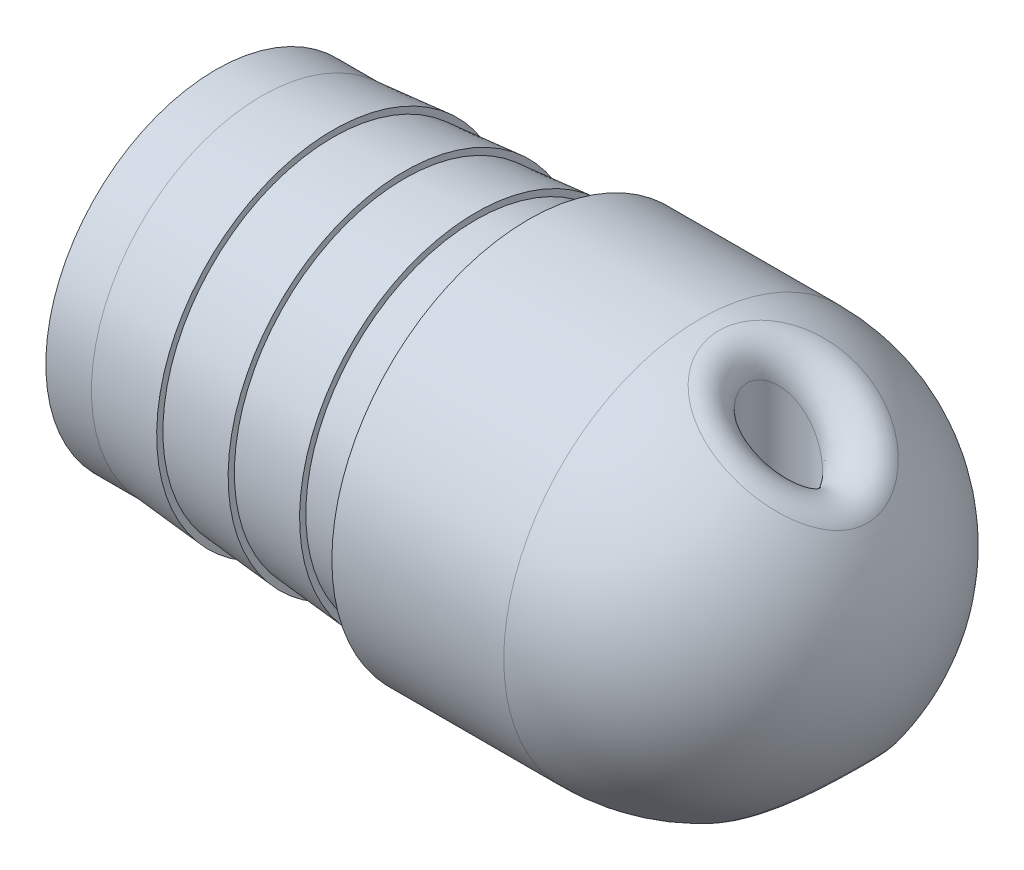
ISO-10303-21;
HEADER;
FILE_DESCRIPTION(('STEP AP214'),'2;1');
FILE_NAME('part.step','',(''),(''),'','','');
FILE_SCHEMA(('AUTOMOTIVE_DESIGN { 1 0 10303 214 1 1 1 1 }'));
ENDSEC;
DATA;
#1=APPLICATION_CONTEXT('core data for automotive mechanical design processes');
#2=APPLICATION_PROTOCOL_DEFINITION('international standard','automotive_design',2000,#1);
#3=PRODUCT_CONTEXT('',#1,'mechanical');
#4=PRODUCT('Part','Part','',(#3));
#5=PRODUCT_RELATED_PRODUCT_CATEGORY('part','',(#4));
#6=PRODUCT_DEFINITION_FORMATION('','',#4);
#7=PRODUCT_DEFINITION_CONTEXT('part definition',#1,'design');
#8=PRODUCT_DEFINITION('design','',#6,#7);
#9=PRODUCT_DEFINITION_SHAPE('','',#8);
#10=(LENGTH_UNIT() NAMED_UNIT(*) SI_UNIT(.MILLI.,.METRE.));
#11=(NAMED_UNIT(*) PLANE_ANGLE_UNIT() SI_UNIT($,.RADIAN.));
#12=(NAMED_UNIT(*) SI_UNIT($,.STERADIAN.) SOLID_ANGLE_UNIT());
#13=UNCERTAINTY_MEASURE_WITH_UNIT(LENGTH_MEASURE(1.E-05),#10,'distance_accuracy_value','');
#14=(GEOMETRIC_REPRESENTATION_CONTEXT(3) GLOBAL_UNCERTAINTY_ASSIGNED_CONTEXT((#13)) GLOBAL_UNIT_ASSIGNED_CONTEXT((#10,
#11,#12)) REPRESENTATION_CONTEXT('',''));
#15=CARTESIAN_POINT('',(0.,0.,0.));
#16=DIRECTION('',(0.,0.,1.));
#17=DIRECTION('',(1.,0.,0.));
#18=AXIS2_PLACEMENT_3D('',#15,#16,#17);
#19=CARTESIAN_POINT('',(-7.60716715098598,0.,0.));
#20=DIRECTION('',(1.,0.,0.));
#21=DIRECTION('',(0.,1.,0.));
#22=AXIS2_PLACEMENT_3D('',#19,#20,#21);
#23=CONICAL_SURFACE('',#22,17.907,0.0872664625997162);
#24=CARTESIAN_POINT('',(-14.8652503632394,0.,0.));
#25=DIRECTION('',(-1.,0.,0.));
#26=DIRECTION('',(0.,-1.,0.));
#27=AXIS2_PLACEMENT_3D('',#24,#25,#26);
#28=CIRCLE('',#27,17.272);
#29=CARTESIAN_POINT('',(-14.8652503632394,-17.272,0.));
#30=VERTEX_POINT('',#29);
#31=EDGE_CURVE('E115',#30,#30,#28,.T.);
#32=ORIENTED_EDGE('',*,*,#31,.F.);
#33=EDGE_LOOP('',(#32));
#34=FACE_BOUND('',#33,.T.);
#35=CARTESIAN_POINT('',(-9.52499999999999,0.,0.));
#36=DIRECTION('',(1.,0.,0.));
#37=DIRECTION('',(0.,1.,0.));
#38=AXIS2_PLACEMENT_3D('',#35,#36,#37);
#39=CIRCLE('',#38,17.7392113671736);
#40=CARTESIAN_POINT('',(-9.525,17.7392113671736,0.));
#41=VERTEX_POINT('',#40);
#42=EDGE_CURVE('E106',#41,#41,#39,.T.);
#43=ORIENTED_EDGE('',*,*,#42,.F.);
#44=EDGE_LOOP('',(#43));
#45=FACE_BOUND('',#44,.T.);
#46=ADVANCED_FACE('F31',(#34,#45),#23,.T.);
#47=CARTESIAN_POINT('',(-41.275,17.272,0.));
#48=DIRECTION('',(1.,0.,0.));
#49=DIRECTION('',(0.,1.,0.));
#50=AXIS2_PLACEMENT_3D('',#47,#48,#49);
#51=PLANE('',#50);
#52=CARTESIAN_POINT('',(-41.275,0.,0.));
#53=DIRECTION('',(-1.,0.,0.));
#54=DIRECTION('',(0.,-1.,0.));
#55=AXIS2_PLACEMENT_3D('',#52,#53,#54);
#56=CIRCLE('',#55,12.6365);
#57=CARTESIAN_POINT('',(-41.275,-12.6365,0.));
#58=VERTEX_POINT('',#57);
#59=EDGE_CURVE('E109',#58,#58,#56,.T.);
#60=ORIENTED_EDGE('',*,*,#59,.F.);
#61=EDGE_LOOP('',(#60));
#62=FACE_BOUND('',#61,.T.);
#63=CARTESIAN_POINT('',(-41.275,0.,0.));
#64=DIRECTION('',(-1.,0.,0.));
#65=DIRECTION('',(0.,-1.,0.));
#66=AXIS2_PLACEMENT_3D('',#63,#64,#65);
#67=CIRCLE('',#66,17.272);
#68=CARTESIAN_POINT('',(-41.275,-17.272,0.));
#69=VERTEX_POINT('',#68);
#70=EDGE_CURVE('E136',#69,#69,#67,.T.);
#71=ORIENTED_EDGE('',*,*,#70,.T.);
#72=EDGE_LOOP('',(#71));
#73=FACE_BOUND('',#72,.T.);
#74=ADVANCED_FACE('F161',(#62,#73),#51,.F.);
#75=CARTESIAN_POINT('',(-41.275,0.,0.));
#76=DIRECTION('',(-1.,0.,0.));
#77=DIRECTION('',(0.,-1.,0.));
#78=AXIS2_PLACEMENT_3D('',#75,#76,#77);
#79=CYLINDRICAL_SURFACE('',#78,12.6365);
#80=CARTESIAN_POINT('',(-9.525,0.,0.));
#81=DIRECTION('',(-1.,0.,0.));
#82=DIRECTION('',(0.,-1.,0.));
#83=AXIS2_PLACEMENT_3D('',#80,#81,#82);
#84=CIRCLE('',#83,12.6365);
#85=CARTESIAN_POINT('',(-9.525,-12.6365,0.));
#86=VERTEX_POINT('',#85);
#87=EDGE_CURVE('E112',#86,#86,#84,.T.);
#88=ORIENTED_EDGE('',*,*,#87,.F.);
#89=EDGE_LOOP('',(#88));
#90=FACE_BOUND('',#89,.T.);
#91=ORIENTED_EDGE('',*,*,#59,.T.);
#92=EDGE_LOOP('',(#91));
#93=FACE_BOUND('',#92,.T.);
#94=ADVANCED_FACE('F167',(#90,#93),#79,.F.);
#95=CARTESIAN_POINT('',(-14.8652503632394,17.907,0.));
#96=DIRECTION('',(-1.,0.,0.));
#97=DIRECTION('',(0.,-1.,0.));
#98=AXIS2_PLACEMENT_3D('',#95,#96,#97);
#99=PLANE('',#98);
#100=CARTESIAN_POINT('',(-14.8652503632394,0.,0.));
#101=DIRECTION('',(-1.,0.,0.));
#102=DIRECTION('',(0.,-1.,0.));
#103=AXIS2_PLACEMENT_3D('',#100,#101,#102);
#104=CIRCLE('',#103,17.907);
#105=CARTESIAN_POINT('',(-14.8652503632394,-17.907,0.));
#106=VERTEX_POINT('',#105);
#107=EDGE_CURVE('E118',#106,#106,#104,.T.);
#108=ORIENTED_EDGE('',*,*,#107,.F.);
#109=EDGE_LOOP('',(#108));
#110=FACE_BOUND('',#109,.T.);
#111=ORIENTED_EDGE('',*,*,#31,.T.);
#112=EDGE_LOOP('',(#111));
#113=FACE_BOUND('',#112,.T.);
#114=ADVANCED_FACE('F173',(#110,#113),#99,.F.);
#115=CARTESIAN_POINT('',(-14.8652503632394,0.,0.));
#116=DIRECTION('',(1.,0.,0.));
#117=DIRECTION('',(0.,1.,0.));
#118=AXIS2_PLACEMENT_3D('',#115,#116,#117);
#119=CONICAL_SURFACE('',#118,17.907,0.0872664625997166);
#120=CARTESIAN_POINT('',(-22.1233335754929,0.,0.));
#121=DIRECTION('',(-1.,0.,0.));
#122=DIRECTION('',(0.,-1.,0.));
#123=AXIS2_PLACEMENT_3D('',#120,#121,#122);
#124=CIRCLE('',#123,17.272);
#125=CARTESIAN_POINT('',(-22.1233335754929,-17.272,0.));
#126=VERTEX_POINT('',#125);
#127=EDGE_CURVE('E121',#126,#126,#124,.T.);
#128=ORIENTED_EDGE('',*,*,#127,.F.);
#129=EDGE_LOOP('',(#128));
#130=FACE_BOUND('',#129,.T.);
#131=ORIENTED_EDGE('',*,*,#107,.T.);
#132=EDGE_LOOP('',(#131));
#133=FACE_BOUND('',#132,.T.);
#134=ADVANCED_FACE('F180',(#130,#133),#119,.T.);
#135=CARTESIAN_POINT('',(-22.1233335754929,17.907,0.));
#136=DIRECTION('',(-1.,0.,0.));
#137=DIRECTION('',(0.,-1.,0.));
#138=AXIS2_PLACEMENT_3D('',#135,#136,#137);
#139=PLANE('',#138);
#140=CARTESIAN_POINT('',(-22.1233335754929,0.,0.));
#141=DIRECTION('',(-1.,0.,0.));
#142=DIRECTION('',(0.,-1.,0.));
#143=AXIS2_PLACEMENT_3D('',#140,#141,#142);
#144=CIRCLE('',#143,17.907);
#145=CARTESIAN_POINT('',(-22.1233335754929,-17.907,0.));
#146=VERTEX_POINT('',#145);
#147=EDGE_CURVE('E124',#146,#146,#144,.T.);
#148=ORIENTED_EDGE('',*,*,#147,.F.);
#149=EDGE_LOOP('',(#148));
#150=FACE_BOUND('',#149,.T.);
#151=ORIENTED_EDGE('',*,*,#127,.T.);
#152=EDGE_LOOP('',(#151));
#153=FACE_BOUND('',#152,.T.);
#154=ADVANCED_FACE('F204',(#150,#153),#139,.F.);
#155=CARTESIAN_POINT('',(-22.1233335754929,0.,0.));
#156=DIRECTION('',(1.,0.,0.));
#157=DIRECTION('',(0.,1.,0.));
#158=AXIS2_PLACEMENT_3D('',#155,#156,#157);
#159=CONICAL_SURFACE('',#158,17.907,0.0872664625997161);
#160=CARTESIAN_POINT('',(-29.3814167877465,0.,0.));
#161=DIRECTION('',(-1.,0.,0.));
#162=DIRECTION('',(0.,-1.,0.));
#163=AXIS2_PLACEMENT_3D('',#160,#161,#162);
#164=CIRCLE('',#163,17.272);
#165=CARTESIAN_POINT('',(-29.3814167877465,-17.272,0.));
#166=VERTEX_POINT('',#165);
#167=EDGE_CURVE('E127',#166,#166,#164,.T.);
#168=ORIENTED_EDGE('',*,*,#167,.F.);
#169=EDGE_LOOP('',(#168));
#170=FACE_BOUND('',#169,.T.);
#171=ORIENTED_EDGE('',*,*,#147,.T.);
#172=EDGE_LOOP('',(#171));
#173=FACE_BOUND('',#172,.T.);
#174=ADVANCED_FACE('F198',(#170,#173),#159,.T.);
#175=CARTESIAN_POINT('',(-29.3814167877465,17.907,0.));
#176=DIRECTION('',(-1.,0.,0.));
#177=DIRECTION('',(0.,-1.,0.));
#178=AXIS2_PLACEMENT_3D('',#175,#176,#177);
#179=PLANE('',#178);
#180=CARTESIAN_POINT('',(-29.3814167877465,0.,0.));
#181=DIRECTION('',(-1.,0.,0.));
#182=DIRECTION('',(0.,-1.,0.));
#183=AXIS2_PLACEMENT_3D('',#180,#181,#182);
#184=CIRCLE('',#183,17.907);
#185=CARTESIAN_POINT('',(-29.3814167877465,-17.907,0.));
#186=VERTEX_POINT('',#185);
#187=EDGE_CURVE('E130',#186,#186,#184,.T.);
#188=ORIENTED_EDGE('',*,*,#187,.F.);
#189=EDGE_LOOP('',(#188));
#190=FACE_BOUND('',#189,.T.);
#191=ORIENTED_EDGE('',*,*,#167,.T.);
#192=EDGE_LOOP('',(#191));
#193=FACE_BOUND('',#192,.T.);
#194=ADVANCED_FACE('F192',(#190,#193),#179,.F.);
#195=CARTESIAN_POINT('',(-29.3814167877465,0.,0.));
#196=DIRECTION('',(1.,0.,0.));
#197=DIRECTION('',(0.,1.,0.));
#198=AXIS2_PLACEMENT_3D('',#195,#196,#197);
#199=CONICAL_SURFACE('',#198,17.907,0.0872664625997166);
#200=CARTESIAN_POINT('',(-36.6395,0.,0.));
#201=DIRECTION('',(-1.,0.,0.));
#202=DIRECTION('',(0.,-1.,0.));
#203=AXIS2_PLACEMENT_3D('',#200,#201,#202);
#204=CIRCLE('',#203,17.272);
#205=CARTESIAN_POINT('',(-36.6395,-17.272,0.));
#206=VERTEX_POINT('',#205);
#207=EDGE_CURVE('E133',#206,#206,#204,.T.);
#208=ORIENTED_EDGE('',*,*,#207,.F.);
#209=EDGE_LOOP('',(#208));
#210=FACE_BOUND('',#209,.T.);
#211=ORIENTED_EDGE('',*,*,#187,.T.);
#212=EDGE_LOOP('',(#211));
#213=FACE_BOUND('',#212,.T.);
#214=ADVANCED_FACE('F157',(#210,#213),#199,.T.);
#215=CARTESIAN_POINT('',(-41.275,0.,0.));
#216=DIRECTION('',(-1.,0.,0.));
#217=DIRECTION('',(0.,-1.,0.));
#218=AXIS2_PLACEMENT_3D('',#215,#216,#217);
#219=CYLINDRICAL_SURFACE('',#218,17.272);
#220=ORIENTED_EDGE('',*,*,#70,.F.);
#221=EDGE_LOOP('',(#220));
#222=FACE_BOUND('',#221,.T.);
#223=ORIENTED_EDGE('',*,*,#207,.T.);
#224=EDGE_LOOP('',(#223));
#225=FACE_BOUND('',#224,.T.);
#226=ADVANCED_FACE('F150',(#222,#225),#219,.T.);
#227=CARTESIAN_POINT('',(0.,0.,0.));
#228=DIRECTION('',(-1.,0.,0.));
#229=DIRECTION('',(0.,-1.,0.));
#230=AXIS2_PLACEMENT_3D('',#227,#228,#229);
#231=CYLINDRICAL_SURFACE('',#230,19.9644);
#232=CARTESIAN_POINT('',(-9.52499999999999,0.,0.));
#233=DIRECTION('',(1.,0.,0.));
#234=DIRECTION('',(0.,1.,0.));
#235=AXIS2_PLACEMENT_3D('',#232,#233,#234);
#236=CIRCLE('',#235,19.9644);
#237=CARTESIAN_POINT('',(-9.525,19.9644,0.));
#238=VERTEX_POINT('',#237);
#239=EDGE_CURVE('E139',#238,#238,#236,.T.);
#240=ORIENTED_EDGE('',*,*,#239,.T.);
#241=EDGE_LOOP('',(#240));
#242=FACE_BOUND('',#241,.T.);
#243=CARTESIAN_POINT('',(7.9375,0.,0.));
#244=DIRECTION('',(-1.,0.,0.));
#245=DIRECTION('',(0.,0.,1.));
#246=AXIS2_PLACEMENT_3D('',#243,#244,#245);
#247=CIRCLE('',#246,19.9644);
#248=CARTESIAN_POINT('',(7.9375,0.,19.9644));
#249=VERTEX_POINT('',#248);
#250=EDGE_CURVE('E142',#249,#249,#247,.T.);
#251=ORIENTED_EDGE('',*,*,#250,.T.);
#252=EDGE_LOOP('',(#251));
#253=FACE_BOUND('',#252,.T.);
#254=ADVANCED_FACE('F146',(#242,#253),#231,.T.);
#255=CARTESIAN_POINT('',(-9.52499999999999,0.,0.));
#256=DIRECTION('',(1.,0.,0.));
#257=DIRECTION('',(0.,1.,0.));
#258=AXIS2_PLACEMENT_3D('',#255,#256,#257);
#259=PLANE('',#258);
#260=ORIENTED_EDGE('',*,*,#239,.F.);
#261=EDGE_LOOP('',(#260));
#262=FACE_BOUND('',#261,.T.);
#263=ORIENTED_EDGE('',*,*,#42,.T.);
#264=EDGE_LOOP('',(#263));
#265=FACE_BOUND('',#264,.T.);
#266=ADVANCED_FACE('F149',(#262,#265),#259,.F.);
#267=ORIENTED_EDGE('',*,*,#87,.T.);
#268=EDGE_LOOP('',(#267));
#269=FACE_BOUND('',#268,.T.);
#270=ADVANCED_FACE('F73',(#269),#259,.F.);
#271=CARTESIAN_POINT('',(7.9375,0.,0.));
#272=DIRECTION('',(-1.,0.,0.));
#273=DIRECTION('',(0.,0.,1.));
#274=AXIS2_PLACEMENT_3D('',#271,#272,#273);
#275=SPHERICAL_SURFACE('',#274,19.9644);
#276=CARTESIAN_POINT('',(15.0762018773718,-14.2800345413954,-3.07287268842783));
#277=CARTESIAN_POINT('',(15.7943396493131,-15.6593119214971,-3.25955373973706));
#278=CARTESIAN_POINT('',(15.918711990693,-16.4987067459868,-4.57596006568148));
#279=CARTESIAN_POINT('',(16.0430843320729,-17.3381015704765,-5.89236639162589));
#280=CARTESIAN_POINT('',(15.4763265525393,-16.9804949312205,-7.30795138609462));
#281=CARTESIAN_POINT('',(14.9752073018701,-14.3923135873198,-3.04662469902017));
#282=CARTESIAN_POINT('',(15.6712676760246,-15.7629366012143,-3.25272117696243));
#283=CARTESIAN_POINT('',(15.7516558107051,-16.6059082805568,-4.55281236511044));
#284=CARTESIAN_POINT('',(15.8326918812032,-17.4484655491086,-5.8529945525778));
#285=CARTESIAN_POINT('',(15.2361397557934,-17.1140067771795,-7.24552802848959));
#286=CARTESIAN_POINT('',(14.8749984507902,-14.5023862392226,-3.01525697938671));
#287=CARTESIAN_POINT('',(15.5475752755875,-15.864999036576,-3.23889176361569));
#288=CARTESIAN_POINT('',(15.5850883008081,-16.7112333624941,-4.52077071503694));
#289=CARTESIAN_POINT('',(15.6232022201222,-17.557093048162,-5.80279921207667));
#290=CARTESIAN_POINT('',(14.997821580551,-17.2448949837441,-7.17092885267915));
#291=CARTESIAN_POINT('',(14.6770372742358,-14.7174856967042,-2.94221337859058));
#292=CARTESIAN_POINT('',(15.3009850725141,-16.0648263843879,-3.19683327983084));
#293=CARTESIAN_POINT('',(15.2546698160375,-16.9174226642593,-4.43864782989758));
#294=CARTESIAN_POINT('',(15.2089479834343,-17.7696483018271,-5.68060967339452));
#295=CARTESIAN_POINT('',(14.5270273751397,-17.5006713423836,-6.99721547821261));
#296=CARTESIAN_POINT('',(14.579283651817,-14.8225151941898,-2.90054307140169));
#297=CARTESIAN_POINT('',(15.178058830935,-16.162629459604,-3.16865949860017));
#298=CARTESIAN_POINT('',(15.0908174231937,-17.0182892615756,-4.38857634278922));
#299=CARTESIAN_POINT('',(15.0041216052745,-17.8736171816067,-5.60869320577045));
#300=CARTESIAN_POINT('',(14.2945482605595,-17.6255626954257,-6.89811453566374));
#301=CARTESIAN_POINT('',(14.3872578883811,-15.0267695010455,-2.80689584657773));
#302=CARTESIAN_POINT('',(14.9346835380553,-16.3531312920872,-3.09768903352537));
#303=CARTESIAN_POINT('',(14.7677996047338,-17.2147413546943,-4.27026776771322));
#304=CARTESIAN_POINT('',(14.6014609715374,-18.076019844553,-5.44304603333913));
#305=CARTESIAN_POINT('',(13.8378697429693,-17.8684430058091,-6.67540131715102));
#306=CARTESIAN_POINT('',(14.292985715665,-15.1259943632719,-2.75491902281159));
#307=CARTESIAN_POINT('',(14.8141985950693,-16.4458688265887,-3.0549336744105));
#308=CARTESIAN_POINT('',(14.6086341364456,-17.310326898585,-4.20203084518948));
#309=CARTESIAN_POINT('',(14.4035575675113,-18.1744952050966,-5.34937021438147));
#310=CARTESIAN_POINT('',(13.6136702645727,-17.9864320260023,-6.55178926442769));
#311=CARTESIAN_POINT('',(14.109081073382,-15.3177889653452,-2.64080550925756));
#312=CARTESIAN_POINT('',(14.5775799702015,-16.6253553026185,-2.9548131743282));
#313=CARTESIAN_POINT('',(14.2971879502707,-17.495318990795,-4.04753886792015));
#314=CARTESIAN_POINT('',(14.0172812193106,-18.3649943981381,-5.1405051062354));
#315=CARTESIAN_POINT('',(13.1763055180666,-18.2144964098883,-6.28040281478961));
#316=CARTESIAN_POINT('',(14.01944566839,-15.4103629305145,-2.57867535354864));
#317=CARTESIAN_POINT('',(14.46140172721,-16.7121481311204,-2.89749090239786));
#318=CARTESIAN_POINT('',(14.1449028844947,-17.5847294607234,-3.96129539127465));
#319=CARTESIAN_POINT('',(13.8288264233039,-18.4570651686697,-5.02537161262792));
#320=CARTESIAN_POINT('',(12.9631332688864,-18.3245767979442,-6.13264395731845));
#321=CARTESIAN_POINT('',(13.8552507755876,-15.5785391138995,-2.45169840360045));
#322=CARTESIAN_POINT('',(14.2473431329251,-16.8700089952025,-2.7753645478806));
#323=CARTESIAN_POINT('',(13.8652204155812,-17.7473289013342,-3.78135807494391));
#324=CARTESIAN_POINT('',(13.4834340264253,-18.6244533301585,-4.78756799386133));
#325=CARTESIAN_POINT('',(12.5726425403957,-18.5245563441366,-5.83066549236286));
#326=CARTESIAN_POINT('',(13.7801055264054,-15.6548966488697,-2.38785798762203));
#327=CARTESIAN_POINT('',(14.1488303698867,-16.941774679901,-2.71205761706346));
#328=CARTESIAN_POINT('',(13.7369056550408,-17.8212291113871,-3.68945589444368));
#329=CARTESIAN_POINT('',(13.3252694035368,-18.7005187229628,-4.6670840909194));
#330=CARTESIAN_POINT('',(12.3939309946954,-18.6153536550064,-5.6788392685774));
#331=CARTESIAN_POINT('',(13.6353065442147,-15.8010490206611,-2.25259969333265));
#332=CARTESIAN_POINT('',(13.9581754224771,-17.0792435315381,-2.57436133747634));
#333=CARTESIAN_POINT('',(13.4891579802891,-17.9627906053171,-3.4921108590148));
#334=CARTESIAN_POINT('',(13.0204279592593,-18.8461734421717,-4.41008918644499));
#335=CARTESIAN_POINT('',(12.0495679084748,-18.7891445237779,-5.357165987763));
#336=CARTESIAN_POINT('',(13.5656496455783,-15.8708476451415,-2.18118623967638));
#337=CARTESIAN_POINT('',(13.8659938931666,-17.1449793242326,-2.49998901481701));
#338=CARTESIAN_POINT('',(13.3697199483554,-18.030455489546,-3.38667590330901));
#339=CARTESIAN_POINT('',(12.8736844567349,-18.9157974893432,-4.27359646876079));
#340=CARTESIAN_POINT('',(11.8839088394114,-18.8721425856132,-5.18732945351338));
#341=CARTESIAN_POINT('',(13.4326907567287,-16.0032887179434,-2.03120394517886));
#342=CARTESIAN_POINT('',(13.6893940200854,-17.2697862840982,-2.34072013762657));
#343=CARTESIAN_POINT('',(13.1413523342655,-18.1589334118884,-3.16298824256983));
#344=CARTESIAN_POINT('',(12.5935486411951,-19.0479466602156,-3.9854893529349));
#345=CARTESIAN_POINT('',(11.5677040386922,-19.0296292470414,-4.83063933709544));
#346=CARTESIAN_POINT('',(13.3693858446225,-16.0659344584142,-1.95263842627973));
#347=CARTESIAN_POINT('',(13.6049352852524,-17.3288889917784,-2.25583170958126));
#348=CARTESIAN_POINT('',(13.0324179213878,-18.219749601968,-3.0447414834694));
#349=CARTESIAN_POINT('',(12.4600896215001,-19.1105052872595,-3.83387969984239));
#350=CARTESIAN_POINT('',(11.4171513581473,-19.1041217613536,-4.64379365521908));
#351=CARTESIAN_POINT('',(13.2499652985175,-16.1835056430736,-1.7888776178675));
#352=CARTESIAN_POINT('',(13.4451272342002,-17.4398602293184,-2.07627189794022));
#353=CARTESIAN_POINT('',(12.8266280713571,-18.333949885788,-2.79635667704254));
#354=CARTESIAN_POINT('',(12.2083177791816,-19.2279347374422,-3.51666917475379));
#355=CARTESIAN_POINT('',(11.1331436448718,-19.2439265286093,-4.2543352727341));
#356=CARTESIAN_POINT('',(13.1938486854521,-16.2384321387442,-1.70368323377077));
#357=CARTESIAN_POINT('',(13.3697400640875,-17.491756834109,-1.98159739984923));
#358=CARTESIAN_POINT('',(12.7297709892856,-18.3873349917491,-2.66622025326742));
#359=CARTESIAN_POINT('',(12.0899437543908,-19.2828353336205,-3.35105631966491));
#360=CARTESIAN_POINT('',(10.9996862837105,-19.3092400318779,-4.05172472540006));
#361=CARTESIAN_POINT('',(13.0960206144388,-16.3337726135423,-1.53817264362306));
#362=CARTESIAN_POINT('',(13.2379876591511,-17.5818740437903,-1.79559704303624));
#363=CARTESIAN_POINT('',(12.5607242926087,-18.4800410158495,-2.4119020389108));
#364=CARTESIAN_POINT('',(11.8835701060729,-19.3781481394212,-3.02837144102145));
#365=CARTESIAN_POINT('',(10.76703011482,-19.4226100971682,-3.65810498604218));
#366=CARTESIAN_POINT('',(13.053386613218,-16.375140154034,-1.4585375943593));
#367=CARTESIAN_POINT('',(13.1804093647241,-17.6210016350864,-1.70528893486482));
#368=CARTESIAN_POINT('',(12.4869663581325,-18.5202837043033,-2.28894412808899));
#369=CARTESIAN_POINT('',(11.7936031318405,-19.419522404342,-2.87274780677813));
#370=CARTESIAN_POINT('',(10.6656373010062,-19.4718005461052,-3.46871573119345));
#371=CARTESIAN_POINT('',(12.9748088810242,-16.4511415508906,-1.29526944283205));
#372=CARTESIAN_POINT('',(13.0741060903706,-17.6929016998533,-1.51874101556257));
#373=CARTESIAN_POINT('',(12.3509114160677,-18.5942419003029,-2.03583785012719));
#374=CARTESIAN_POINT('',(11.6277964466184,-19.4955387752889,-2.55308289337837));
#375=CARTESIAN_POINT('',(10.478762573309,-19.5621743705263,-3.08042899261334));
#376=CARTESIAN_POINT('',(12.9388642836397,-16.4857762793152,-1.21163686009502));
#377=CARTESIAN_POINT('',(13.0253584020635,-17.7256900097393,-1.42248926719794));
#378=CARTESIAN_POINT('',(12.2886129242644,-18.6279582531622,-1.90569041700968));
#379=CARTESIAN_POINT('',(11.5519209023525,-19.5301976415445,-2.38901888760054));
#380=CARTESIAN_POINT('',(10.3932785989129,-19.6033587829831,-2.88153274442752));
#381=CARTESIAN_POINT('',(12.8741412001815,-16.5479842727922,-1.04104956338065));
#382=CARTESIAN_POINT('',(12.9374697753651,-17.7845870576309,-1.22504116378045));
#383=CARTESIAN_POINT('',(12.1763635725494,-18.6885314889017,-1.63940848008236));
#384=CARTESIAN_POINT('',(11.4153111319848,-19.5924469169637,-2.05390282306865));
#385=CARTESIAN_POINT('',(10.2393532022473,-19.6773307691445,-2.47583950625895));
#386=CARTESIAN_POINT('',(12.8453590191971,-16.5755611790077,-0.954096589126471));
#387=CARTESIAN_POINT('',(12.8983051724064,-17.8107120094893,-1.12383064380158));
#388=CARTESIAN_POINT('',(12.1264063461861,-18.7153919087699,-1.50327710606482));
#389=CARTESIAN_POINT('',(11.3545398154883,-19.6200544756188,-1.88282465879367));
#390=CARTESIAN_POINT('',(10.1709029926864,-19.7101226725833,-2.26904665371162));
#391=CARTESIAN_POINT('',(12.7953239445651,-16.6234119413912,-0.777591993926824));
#392=CARTESIAN_POINT('',(12.8301616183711,-17.8560439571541,-0.917542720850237));
#393=CARTESIAN_POINT('',(12.0395195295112,-18.762007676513,-1.22632824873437));
#394=CARTESIAN_POINT('',(11.2489087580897,-19.6679545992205,-1.53521544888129));
#395=CARTESIAN_POINT('',(10.0519088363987,-19.7670223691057,-1.84928080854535));
#396=CARTESIAN_POINT('',(12.774070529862,-16.6436863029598,-0.688040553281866));
#397=CARTESIAN_POINT('',(12.8011668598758,-17.8752615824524,-0.812445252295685));
#398=CARTESIAN_POINT('',(12.0025890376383,-18.7817635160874,-1.08551109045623));
#399=CARTESIAN_POINT('',(11.2040244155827,-19.6882583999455,-1.35864974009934));
#400=CARTESIAN_POINT('',(10.0013636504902,-19.7911307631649,-1.63630824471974));
#401=CARTESIAN_POINT('',(12.7252772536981,-16.6901829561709,-0.433300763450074));
#402=CARTESIAN_POINT('',(12.734592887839,-17.9193188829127,-0.512739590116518));
#403=CARTESIAN_POINT('',(11.9177822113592,-18.8270754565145,-0.684343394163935));
#404=CARTESIAN_POINT('',(11.1010251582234,-19.7348033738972,-0.856182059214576));
#405=CARTESIAN_POINT('',(9.88532275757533,-19.8464202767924,-1.03048229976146));
#406=CARTESIAN_POINT('',(12.7067024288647,-16.7078133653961,-0.265879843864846));
#407=CARTESIAN_POINT('',(12.7091649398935,-17.936049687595,-0.314687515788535));
#408=CARTESIAN_POINT('',(11.8854655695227,-18.8442630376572,-0.419996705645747));
#409=CARTESIAN_POINT('',(11.0617680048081,-19.752475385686,-0.52534285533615));
#410=CARTESIAN_POINT('',(9.84114783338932,-19.8673847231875,-0.632319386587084));
#411=CARTESIAN_POINT('',(12.6963239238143,-16.7176710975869,0.0698556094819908));
#412=CARTESIAN_POINT('',(12.6949740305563,-17.9453964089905,0.082643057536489));
#413=CARTESIAN_POINT('',(11.8674120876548,-18.8538725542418,0.110335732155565));
#414=CARTESIAN_POINT('',(11.0398510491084,-19.7623482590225,0.137985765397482));
#415=CARTESIAN_POINT('',(9.8164655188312,-19.8791066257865,0.166131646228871));
#416=CARTESIAN_POINT('',(12.7045124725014,-16.7099057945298,0.238169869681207));
#417=CARTESIAN_POINT('',(12.706189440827,-17.9380265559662,0.282074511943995));
#418=CARTESIAN_POINT('',(11.881661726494,-18.8463016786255,0.376320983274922));
#419=CARTESIAN_POINT('',(11.0571578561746,-19.754564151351,0.470730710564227));
#420=CARTESIAN_POINT('',(9.83593964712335,-19.869872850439,0.566419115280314));
#421=CARTESIAN_POINT('',(12.7464061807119,-16.6700560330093,0.56439719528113));
#422=CARTESIAN_POINT('',(12.7634214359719,-17.9002510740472,0.66719103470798));
#423=CARTESIAN_POINT('',(11.9545095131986,-18.8074606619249,0.890949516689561));
#424=CARTESIAN_POINT('',(11.1456180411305,-19.7146592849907,1.11485746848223));
#425=CARTESIAN_POINT('',(9.93557188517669,-19.8224872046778,1.3422577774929));
#426=CARTESIAN_POINT('',(12.7791434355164,-16.6388940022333,0.722463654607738));
#427=CARTESIAN_POINT('',(12.8081587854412,-17.8706921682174,0.853248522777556));
#428=CARTESIAN_POINT('',(12.0114253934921,-18.7770894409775,1.13986912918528));
#429=CARTESIAN_POINT('',(11.2147921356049,-19.6834330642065,1.42680318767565));
#430=CARTESIAN_POINT('',(10.013428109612,-19.7854322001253,1.71817377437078));
#431=CARTESIAN_POINT('',(12.8675911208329,-16.5542911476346,1.03043421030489));
#432=CARTESIAN_POINT('',(12.9286022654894,-17.7905453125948,1.21306636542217));
#433=CARTESIAN_POINT('',(12.1650089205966,-18.6946716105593,1.62301227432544));
#434=CARTESIAN_POINT('',(11.4015142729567,-19.5987448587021,2.03327021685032));
#435=CARTESIAN_POINT('',(10.2237757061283,-19.6848303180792,2.4505939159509));
#436=CARTESIAN_POINT('',(12.9233020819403,-16.5008498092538,1.18033811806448));
#437=CARTESIAN_POINT('',(13.0043906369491,-17.7399020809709,1.38693408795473));
#438=CARTESIAN_POINT('',(12.2616774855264,-18.6426245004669,1.85723546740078));
#439=CARTESIAN_POINT('',(11.5191902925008,-19.5452244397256,2.32797685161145));
#440=CARTESIAN_POINT('',(10.3562683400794,-19.6212828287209,2.80709761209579));
#441=CARTESIAN_POINT('',(13.0567538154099,-16.3719601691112,1.47112465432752));
#442=CARTESIAN_POINT('',(13.1850890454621,-17.6179436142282,1.72020451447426));
#443=CARTESIAN_POINT('',(12.4928326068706,-18.517181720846,2.30876041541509));
#444=CARTESIAN_POINT('',(11.8008092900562,-19.4162931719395,2.89777308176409));
#445=CARTESIAN_POINT('',(10.6736452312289,-19.46801920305,3.49865046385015));
#446=CARTESIAN_POINT('',(13.1349063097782,-16.2960997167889,1.61177187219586));
#447=CARTESIAN_POINT('',(13.2906568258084,-17.5461621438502,1.879324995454));
#448=CARTESIAN_POINT('',(12.6280255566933,-18.443386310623,2.5256387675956));
#449=CARTESIAN_POINT('',(11.9657966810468,-19.3403886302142,3.17249232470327));
#450=CARTESIAN_POINT('',(10.8595086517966,-19.3778129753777,3.83313976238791));
#451=CARTESIAN_POINT('',(13.3097830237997,-16.1248412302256,1.87766629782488));
#452=CARTESIAN_POINT('',(13.5254512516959,-17.3844039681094,2.17473287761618));
#453=CARTESIAN_POINT('',(12.9298171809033,-18.2769441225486,2.93174971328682));
#454=CARTESIAN_POINT('',(12.3345849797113,-19.1692625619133,3.68930903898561));
#455=CARTESIAN_POINT('',(11.2754030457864,-19.1741682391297,4.46549382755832));
#456=CARTESIAN_POINT('',(13.4065116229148,-16.0294385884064,2.00290986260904));
#457=CARTESIAN_POINT('',(13.6548204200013,-17.294323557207,2.3110465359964));
#458=CARTESIAN_POINT('',(13.0964232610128,-18.1842928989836,3.12097576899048));
#459=CARTESIAN_POINT('',(12.5386145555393,-19.0739311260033,3.93147376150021));
#460=CARTESIAN_POINT('',(11.5054444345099,-19.0607242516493,4.76334993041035));
#461=CARTESIAN_POINT('',(13.6222928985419,-15.8143385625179,2.24360907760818));
#462=CARTESIAN_POINT('',(13.9413208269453,-17.0916208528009,2.56612308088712));
#463=CARTESIAN_POINT('',(13.4669668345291,-17.9756467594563,3.47955353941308));
#464=CARTESIAN_POINT('',(12.9932820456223,-18.8592956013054,4.39363233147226));
#465=CARTESIAN_POINT('',(12.0186186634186,-18.804947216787,5.33578437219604));
#466=CARTESIAN_POINT('',(13.7424094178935,-15.6934388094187,2.35784004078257));
#467=CARTESIAN_POINT('',(14.0998660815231,-16.9777852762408,2.6830424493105));
#468=CARTESIAN_POINT('',(13.6726613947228,-17.8585009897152,3.64671287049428));
#469=CARTESIAN_POINT('',(13.2463511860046,-18.7386991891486,4.61099273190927));
#470=CARTESIAN_POINT('',(12.3042815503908,-18.6611844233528,5.60745014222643));
#471=CARTESIAN_POINT('',(13.9960225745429,-15.4347598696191,2.56453968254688));
#472=CARTESIAN_POINT('',(14.4314145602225,-16.7348539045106,2.88534055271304));
#473=CARTESIAN_POINT('',(14.1052144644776,-17.6082680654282,3.94225184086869));
#474=CARTESIAN_POINT('',(13.779913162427,-18.4811623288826,4.99977893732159));
#475=CARTESIAN_POINT('',(12.9074281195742,-18.3535873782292,6.09902629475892));
#476=CARTESIAN_POINT('',(14.129523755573,-15.2969749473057,2.65700093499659));
#477=CARTESIAN_POINT('',(14.6045806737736,-16.6056177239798,2.97063675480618));
#478=CARTESIAN_POINT('',(14.3320801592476,-17.4751754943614,4.07061825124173));
#479=CARTESIAN_POINT('',(14.0606868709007,-18.3440723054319,5.17111230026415));
#480=CARTESIAN_POINT('',(13.2249226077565,-18.1897463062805,6.31891901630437));
#481=CARTESIAN_POINT('',(14.4198319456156,-14.9928137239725,2.82739773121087));
#482=CARTESIAN_POINT('',(14.9769087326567,-16.3211262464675,3.11593407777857));
#483=CARTESIAN_POINT('',(14.8229706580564,-17.1819892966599,4.29811116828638));
#484=CARTESIAN_POINT('',(14.670372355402,-18.0420517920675,5.48090977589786));
#485=CARTESIAN_POINT('',(13.9153378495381,-17.8280659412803,6.72415920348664));
#486=CARTESIAN_POINT('',(14.577636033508,-14.8249566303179,2.90297100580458));
#487=CARTESIAN_POINT('',(15.177016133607,-16.1644679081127,3.17238581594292));
#488=CARTESIAN_POINT('',(15.0884463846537,-17.0205266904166,4.3930548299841));
#489=CARTESIAN_POINT('',(15.0014481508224,-17.8756076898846,5.61413493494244));
#490=CARTESIAN_POINT('',(14.2906298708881,-17.6284658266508,6.90388868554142));
#491=CARTESIAN_POINT('',(14.90008984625,-14.4755483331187,3.02655430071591));
#492=CARTESIAN_POINT('',(15.5796085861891,-15.8396944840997,3.24699739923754));
#493=CARTESIAN_POINT('',(15.6272162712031,-16.68543986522,4.53464325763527));
#494=CARTESIAN_POINT('',(15.6764091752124,-17.5301997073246,5.82270762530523));
#495=CARTESIAN_POINT('',(15.057494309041,-17.2129818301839,7.19779630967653));
#496=CARTESIAN_POINT('',(15.0647432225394,-14.293989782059,3.07454941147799));
#497=CARTESIAN_POINT('',(15.7822220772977,-15.6714143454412,3.2649315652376));
#498=CARTESIAN_POINT('',(15.9005145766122,-16.511809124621,4.58126190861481));
#499=CARTESIAN_POINT('',(16.0205665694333,-17.3510581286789,5.89774096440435));
#500=CARTESIAN_POINT('',(15.4490754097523,-16.9970892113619,7.31193899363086));
#501=CARTESIAN_POINT('',(15.4154047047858,-13.8993821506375,3.14721381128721));
#502=CARTESIAN_POINT('',(16.2057202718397,-15.3073495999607,3.26428154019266));
#503=CARTESIAN_POINT('',(16.4775875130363,-16.1359129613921,4.63018473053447));
#504=CARTESIAN_POINT('',(16.7516402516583,-16.9630523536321,5.99627370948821));
#505=CARTESIAN_POINT('',(16.2830237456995,-16.5278583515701,7.48475054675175));
#506=CARTESIAN_POINT('',(15.6017316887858,-13.6850880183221,3.16865230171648));
#507=CARTESIAN_POINT('',(16.4260205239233,-15.1105654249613,3.2410524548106));
#508=CARTESIAN_POINT('',(16.7813325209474,-15.9326234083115,4.62691478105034));
#509=CARTESIAN_POINT('',(17.1389758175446,-16.7530707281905,6.01253482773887));
#510=CARTESIAN_POINT('',(16.7261493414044,-16.2730396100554,7.53573588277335));
#511=CARTESIAN_POINT('',(15.9726460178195,-13.2478323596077,3.17891863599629));
#512=CARTESIAN_POINT('',(16.8528274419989,-14.7119057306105,3.15328692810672));
#513=CARTESIAN_POINT('',(17.3785402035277,-15.5202906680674,4.56560120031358));
#514=CARTESIAN_POINT('',(17.9066025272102,-16.3270544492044,5.97767720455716));
#515=CARTESIAN_POINT('',(17.6082632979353,-15.7530956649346,7.56015143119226));
#516=CARTESIAN_POINT('',(16.1572334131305,-13.0248710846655,3.16774742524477));
#517=CARTESIAN_POINT('',(17.0593402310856,-14.5098830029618,3.08840175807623));
#518=CARTESIAN_POINT('',(17.672003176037,-15.3112476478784,4.50755915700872));
#519=CARTESIAN_POINT('',(18.2870445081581,-16.1108576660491,5.9260187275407));
#520=CARTESIAN_POINT('',(18.0472517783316,-15.4879707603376,7.53358389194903));
#521=CARTESIAN_POINT('',(16.5044876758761,-12.5941895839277,3.1164802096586));
#522=CARTESIAN_POINT('',(17.4341654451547,-14.1234608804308,2.92965249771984));
#523=CARTESIAN_POINT('',(18.2151022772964,-14.9107853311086,4.34846241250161));
#524=CARTESIAN_POINT('',(18.9980436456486,-15.6966325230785,5.76668612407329));
#525=CARTESIAN_POINT('',(18.8730970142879,-14.9758441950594,7.41165943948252));
#526=CARTESIAN_POINT('',(16.6676628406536,-12.3868347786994,3.07899018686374));
#527=CARTESIAN_POINT('',(17.6042922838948,-13.9388577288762,2.83847916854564));
#528=CARTESIAN_POINT('',(18.466328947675,-14.7194180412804,4.25159768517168));
#529=CARTESIAN_POINT('',(19.330313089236,-15.4984411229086,5.6637755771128));
#530=CARTESIAN_POINT('',(19.2611626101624,-14.7292770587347,7.3225001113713));
#531=CARTESIAN_POINT('',(16.9861475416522,-11.9717001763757,2.9788977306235));
#532=CARTESIAN_POINT('',(17.9223500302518,-13.5735006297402,2.6303954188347));
#533=CARTESIAN_POINT('',(18.9470225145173,-14.3402718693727,4.01997398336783));
#534=CARTESIAN_POINT('',(19.9736514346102,-15.1055011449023,5.40861207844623));
#535=CARTESIAN_POINT('',(20.018587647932,-14.2356374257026,7.08445874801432));
#536=CARTESIAN_POINT('',(17.1414545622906,-11.7639202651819,2.91628732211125));
#537=CARTESIAN_POINT('',(18.0701392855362,-13.3927251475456,2.51323501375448));
#538=CARTESIAN_POINT('',(19.1764824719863,-14.15249414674,3.88520297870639));
#539=CARTESIAN_POINT('',(20.2846354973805,-14.9107234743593,5.25590122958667));
#540=CARTESIAN_POINT('',(20.3879411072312,-13.9885647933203,6.93555774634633));
#541=CARTESIAN_POINT('',(17.3783298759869,-11.438583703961,2.7982297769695));
#542=CARTESIAN_POINT('',(18.2822036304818,-13.1145924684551,2.31274952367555));
#543=CARTESIAN_POINT('',(19.5171380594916,-13.8627744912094,3.64642319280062));
#544=CARTESIAN_POINT('',(20.752693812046,-14.6104283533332,4.97966200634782));
#545=CARTESIAN_POINT('',(20.9512814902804,-13.6017046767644,6.65479154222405));
#546=CARTESIAN_POINT('',(17.4635215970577,-11.3197123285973,2.75077899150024));
#547=CARTESIAN_POINT('',(18.3556843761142,-13.013754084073,2.23556688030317));
#548=CARTESIAN_POINT('',(19.6375927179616,-13.7578429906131,3.5531961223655));
#549=CARTESIAN_POINT('',(20.9200777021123,-14.501417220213,4.87033448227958));
#550=CARTESIAN_POINT('',(21.1538857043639,-13.4603538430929,6.54194338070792));
#551=CARTESIAN_POINT('',(17.6297145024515,-11.0841867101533,2.64785716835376));
#552=CARTESIAN_POINT('',(18.4928599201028,-12.8162053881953,2.07586517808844));
#553=CARTESIAN_POINT('',(19.8680538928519,-13.5521433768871,3.35695988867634));
#554=CARTESIAN_POINT('',(21.2438243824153,-14.2875667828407,4.63756357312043));
#555=CARTESIAN_POINT('',(21.5491281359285,-13.1802885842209,6.29717317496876));
#556=CARTESIAN_POINT('',(17.710716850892,-10.9675318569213,2.59238837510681));
#557=CARTESIAN_POINT('',(18.5565109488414,-12.7195108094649,1.99331766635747));
#558=CARTESIAN_POINT('',(19.978063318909,-13.451374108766,3.25395346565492));
#559=CARTESIAN_POINT('',(21.4001411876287,-14.1827431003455,4.51404863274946));
#560=CARTESIAN_POINT('',(21.7417691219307,-13.0415734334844,6.16525646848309));
#561=CARTESIAN_POINT('',(17.867983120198,-10.7374845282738,2.47353271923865));
#562=CARTESIAN_POINT('',(18.6733651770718,-12.5314703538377,1.82448099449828));
#563=CARTESIAN_POINT('',(20.1866053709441,-13.2552727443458,3.039563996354));
#564=CARTESIAN_POINT('',(21.7003749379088,-13.9785775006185,4.25410318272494));
#565=CARTESIAN_POINT('',(22.1157820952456,-12.7680224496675,5.88259218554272));
#566=CARTESIAN_POINT('',(17.9442455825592,-10.6240930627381,2.4101434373));
#567=CARTESIAN_POINT('',(18.7265116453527,-12.4401539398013,1.7381722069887));
#568=CARTESIAN_POINT('',(20.2851344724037,-13.1599423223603,2.92817839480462));
#569=CARTESIAN_POINT('',(21.8442240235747,-13.8792658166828,4.11760386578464));
#570=CARTESIAN_POINT('',(22.2971506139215,-12.6331878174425,5.73183885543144));
#571=CARTESIAN_POINT('',(18.091376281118,-10.4019193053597,2.27557371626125));
#572=CARTESIAN_POINT('',(18.8217972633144,-12.2643152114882,1.5637993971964));
#573=CARTESIAN_POINT('',(20.4696624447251,-12.9762336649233,2.69882545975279));
#574=CARTESIAN_POINT('',(22.1179960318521,-13.6876860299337,3.83326995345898));
#575=CARTESIAN_POINT('',(22.6470590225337,-12.3689993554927,5.41180314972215));
#576=CARTESIAN_POINT('',(18.1622457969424,-10.2931359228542,2.20439513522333));
#577=CARTESIAN_POINT('',(18.8638804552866,-12.1798305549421,1.47573150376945));
#578=CARTESIAN_POINT('',(20.5556642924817,-12.8878537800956,2.58085969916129));
#579=CARTESIAN_POINT('',(22.2478440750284,-13.5954572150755,3.68538792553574));
#580=CARTESIAN_POINT('',(22.8156019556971,-12.2396442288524,5.24252519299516));
#581=CARTESIAN_POINT('',(18.2846055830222,-10.1024651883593,2.0690670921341));
#582=CARTESIAN_POINT('',(18.9296078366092,-12.0349865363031,1.31746934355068));
#583=CARTESIAN_POINT('',(20.6987377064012,-12.73612913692,2.36405892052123));
#584=CARTESIAN_POINT('',(22.4681255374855,-13.4369980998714,3.41025759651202));
#585=CARTESIAN_POINT('',(23.1065998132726,-12.0129162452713,4.9206860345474));
#586=CARTESIAN_POINT('',(18.3371722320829,-10.019484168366,2.00627290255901));
#587=CARTESIAN_POINT('',(18.9552393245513,-11.9731169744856,1.24709993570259));
#588=CARTESIAN_POINT('',(20.75817608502,-12.6712720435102,2.26600420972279));
#589=CARTESIAN_POINT('',(22.5613291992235,-13.3691842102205,3.28451904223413));
#590=CARTESIAN_POINT('',(23.2316145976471,-11.9142428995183,4.77134796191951));
#591=CARTESIAN_POINT('',(18.4379639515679,-9.85849452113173,1.87580210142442));
#592=CARTESIAN_POINT('',(18.9992782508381,-11.8555695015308,1.10816808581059));
#593=CARTESIAN_POINT('',(20.8680724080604,-12.5479476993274,2.06837033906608));
#594=CARTESIAN_POINT('',(22.7370836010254,-13.240082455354,3.02818264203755));
#595=CARTESIAN_POINT('',(23.4713189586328,-11.7228089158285,4.46106036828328));
#596=CARTESIAN_POINT('',(18.4861898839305,-9.78048490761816,1.80812646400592));
#597=CARTESIAN_POINT('',(19.0176555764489,-11.799922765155,1.03962177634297));
#598=CARTESIAN_POINT('',(20.91853213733,-12.4894791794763,1.9687914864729));
#599=CARTESIAN_POINT('',(22.8195824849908,-13.1788277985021,2.89758376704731));
#600=CARTESIAN_POINT('',(23.5860105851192,-11.6300471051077,4.30011316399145));
#601=CARTESIAN_POINT('',(18.5778009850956,-9.63063985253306,1.66807851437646));
#602=CARTESIAN_POINT('',(19.0474980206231,-11.6956440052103,0.905962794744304));
#603=CARTESIAN_POINT('',(21.0102802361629,-12.3798099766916,1.76971301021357));
#604=CARTESIAN_POINT('',(22.9732368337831,-13.0637675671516,2.63308518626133));
#605=CARTESIAN_POINT('',(23.8038814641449,-11.4518652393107,3.96704905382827));
#606=CARTESIAN_POINT('',(18.6211914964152,-9.55879761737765,1.59571152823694));
#607=CARTESIAN_POINT('',(19.0589416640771,-11.6470410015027,0.840872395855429));
#608=CARTESIAN_POINT('',(21.0515787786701,-12.3286012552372,1.67021342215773));
#609=CARTESIAN_POINT('',(23.0443468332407,-13.0099932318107,2.49920244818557));
#610=CARTESIAN_POINT('',(23.9070734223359,-11.3664371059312,3.79494481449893));
#611=CARTESIAN_POINT('',(18.7026805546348,-9.42249077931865,1.44640128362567));
#612=CARTESIAN_POINT('',(19.075637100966,-11.5574327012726,0.715664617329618));
#613=CARTESIAN_POINT('',(21.125192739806,-12.2340881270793,1.47281149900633));
#614=CARTESIAN_POINT('',(23.1748801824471,-12.9105744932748,2.22960581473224));
#615=CARTESIAN_POINT('',(24.1008719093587,-11.2043536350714,3.43985297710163));
#616=CARTESIAN_POINT('',(18.7407802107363,-9.35802463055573,1.36945898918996));
#617=CARTESIAN_POINT('',(19.0808656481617,-11.5164657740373,0.655581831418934));
#618=CARTESIAN_POINT('',(21.1575100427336,-12.1907820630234,1.37490883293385));
#619=CARTESIAN_POINT('',(23.2342455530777,-12.8649716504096,2.09392414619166));
#620=CARTESIAN_POINT('',(24.1914810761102,-11.1276964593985,3.25686767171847));
#621=CARTESIAN_POINT('',(18.8041491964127,-9.24983141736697,1.22699775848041));
#622=CARTESIAN_POINT('',(19.0857582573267,-11.4498977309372,0.553159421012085));
#623=CARTESIAN_POINT('',(21.2080917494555,-12.1203063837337,1.20138377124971));
#624=CARTESIAN_POINT('',(23.3304838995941,-12.7906331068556,1.84940617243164));
#625=CARTESIAN_POINT('',(24.3421861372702,-10.999043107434,2.91806426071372));
#626=CARTESIAN_POINT('',(18.8304642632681,-9.20452748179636,1.16224190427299));
#627=CARTESIAN_POINT('',(19.0863117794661,-11.4228669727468,0.509663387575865));
#628=CARTESIAN_POINT('',(21.2278722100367,-12.0916399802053,1.12519538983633));
#629=CARTESIAN_POINT('',(23.3694728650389,-12.7603525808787,1.74055283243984));
#630=CARTESIAN_POINT('',(24.4047690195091,-10.9451718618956,2.76406092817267));
#631=CARTESIAN_POINT('',(18.8790352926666,-9.1203725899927,1.03021449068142));
#632=CARTESIAN_POINT('',(19.0850267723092,-11.3740133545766,0.427329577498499));
#633=CARTESIAN_POINT('',(21.2624430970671,-12.0397718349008,0.975505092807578));
#634=CARTESIAN_POINT('',(23.4398998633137,-12.7054696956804,1.52350588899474));
#635=CARTESIAN_POINT('',(24.5202813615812,-10.8451026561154,2.45007137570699));
#636=CARTESIAN_POINT('',(18.9012921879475,-9.08152015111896,0.962943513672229));
#637=CARTESIAN_POINT('',(19.0831834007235,-11.3522090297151,0.388514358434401));
#638=CARTESIAN_POINT('',(21.2772346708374,-12.0165688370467,0.902002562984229));
#639=CARTESIAN_POINT('',(23.4713110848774,-12.6808877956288,1.4153472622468));
#640=CARTESIAN_POINT('',(24.5732130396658,-10.7989029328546,2.29008654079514));
#641=CARTESIAN_POINT('',(18.9414393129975,-9.01106767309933,0.826224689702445));
#642=CARTESIAN_POINT('',(19.0781136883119,-11.3137260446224,0.315738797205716));
#643=CARTESIAN_POINT('',(21.3024380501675,-11.975571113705,0.758100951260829));
#644=CARTESIAN_POINT('',(23.5267876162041,-12.6373751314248,1.20031914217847));
#645=CARTESIAN_POINT('',(24.6686915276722,-10.7151273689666,1.9649398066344));
#646=CARTESIAN_POINT('',(18.9593321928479,-8.97946323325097,0.756778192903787));
#647=CARTESIAN_POINT('',(19.0748863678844,-11.2970616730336,0.281798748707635));
#648=CARTESIAN_POINT('',(21.3128525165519,-11.9577731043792,0.687700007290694));
#649=CARTESIAN_POINT('',(23.550832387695,-12.6184603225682,1.0934914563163));
#650=CARTESIAN_POINT('',(24.7112446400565,-10.6775462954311,1.79978111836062));
#651=CARTESIAN_POINT('',(18.9904893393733,-8.92421005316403,0.616070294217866));
#652=CARTESIAN_POINT('',(19.0681463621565,-11.2686185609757,0.218427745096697));
#653=CARTESIAN_POINT('',(21.3300334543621,-11.9273653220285,0.549932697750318));
#654=CARTESIAN_POINT('',(23.5919342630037,-12.5860877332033,0.881327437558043));
#655=CARTESIAN_POINT('',(24.7853430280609,-10.611844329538,1.4651475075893));
#656=CARTESIAN_POINT('',(19.0037535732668,-8.90056136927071,0.544808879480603));
#657=CARTESIAN_POINT('',(19.0646346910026,-11.2568538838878,0.189017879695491));
#658=CARTESIAN_POINT('',(21.3367998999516,-11.9147555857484,0.482566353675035));
#659=CARTESIAN_POINT('',(23.6089711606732,-12.572645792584,0.776039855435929));
#660=CARTESIAN_POINT('',(24.8168882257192,-10.5837235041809,1.29567255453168));
#661=CARTESIAN_POINT('',(19.025485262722,-8.86171659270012,0.400526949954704));
#662=CARTESIAN_POINT('',(19.0583407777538,-11.2378646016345,0.133632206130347));
#663=CARTESIAN_POINT('',(21.3474246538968,-11.894389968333,0.349949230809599));
#664=CARTESIAN_POINT('',(23.636514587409,-12.5509036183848,0.566190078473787));
#665=CARTESIAN_POINT('',(24.8685708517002,-10.5375328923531,0.952539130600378));
#666=CARTESIAN_POINT('',(19.0339226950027,-8.84657341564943,0.327498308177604));
#667=CARTESIAN_POINT('',(19.0555656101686,-11.2306784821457,0.107696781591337));
#668=CARTESIAN_POINT('',(21.3512648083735,-11.8866644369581,0.284714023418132));
#669=CARTESIAN_POINT('',(23.646965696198,-12.5426470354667,0.461690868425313));
#670=CARTESIAN_POINT('',(24.8886368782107,-10.5195260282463,0.77886133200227));
#671=CARTESIAN_POINT('',(19.045708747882,-8.82539839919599,0.180700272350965));
#672=CARTESIAN_POINT('',(19.0515639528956,-11.2207043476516,0.0579804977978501));
#673=CARTESIAN_POINT('',(21.3565231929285,-11.8759419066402,0.15578882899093));
#674=CARTESIAN_POINT('',(23.6614840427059,-12.5311760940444,0.253556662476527));
#675=CARTESIAN_POINT('',(24.9166666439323,-10.4943466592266,0.429744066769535));
#676=CARTESIAN_POINT('',(19.0490573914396,-8.8193665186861,0.106930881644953));
#677=CARTESIAN_POINT('',(19.0503395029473,-11.2179217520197,0.0342143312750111));
#678=CARTESIAN_POINT('',(21.3579414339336,-11.8729448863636,0.0920988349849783));
#679=CARTESIAN_POINT('',(23.6655434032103,-12.5279679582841,0.149978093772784));
#680=CARTESIAN_POINT('',(24.9246304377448,-10.487174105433,0.25430460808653));
#681=CARTESIAN_POINT('',(19.0505971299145,-8.81659453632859,-0.0406929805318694));
#682=CARTESIAN_POINT('',(19.0497849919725,-11.2166365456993,-0.0130328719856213));
#683=CARTESIAN_POINT('',(21.3586011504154,-11.8715618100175,-0.0350587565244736));
#684=CARTESIAN_POINT('',(23.6674173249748,-12.526487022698,-0.0570898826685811));
#685=CARTESIAN_POINT('',(24.928292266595,-10.483877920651,-0.0967766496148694));
#686=CARTESIAN_POINT('',(19.0487890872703,-8.81985288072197,-0.114547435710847));
#687=CARTESIAN_POINT('',(19.0504549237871,-11.2181339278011,-0.0365008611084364));
#688=CARTESIAN_POINT('',(21.357842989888,-11.8731749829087,-0.09852638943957));
#689=CARTESIAN_POINT('',(23.6652318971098,-12.5282142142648,-0.160522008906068));
#690=CARTESIAN_POINT('',(24.9239923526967,-10.4877524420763,-0.272418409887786));
#691=CARTESIAN_POINT('',(19.0400543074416,-8.83556070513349,-0.26170303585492));
#692=CARTESIAN_POINT('',(19.0535029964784,-11.2254797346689,-0.0850858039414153));
#693=CARTESIAN_POINT('',(21.3540166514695,-11.8810757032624,-0.226630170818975));
#694=CARTESIAN_POINT('',(23.6545312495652,-12.5366698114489,-0.368144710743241));
#695=CARTESIAN_POINT('',(24.9032191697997,-10.5064307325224,-0.622386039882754));
#696=CARTESIAN_POINT('',(19.0331277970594,-8.84800977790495,-0.33500420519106));
#697=CARTESIAN_POINT('',(19.0558794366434,-11.2313239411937,-0.110188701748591));
#698=CARTESIAN_POINT('',(21.3509485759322,-11.8873630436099,-0.29126626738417));
#699=CARTESIAN_POINT('',(23.6460221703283,-12.543393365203,-0.472278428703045));
#700=CARTESIAN_POINT('',(24.8867464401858,-10.5212340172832,-0.796711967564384));
#701=CARTESIAN_POINT('',(19.0151807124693,-8.8801485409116,-0.473609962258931));
#702=CARTESIAN_POINT('',(19.061395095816,-11.2468330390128,-0.161167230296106));
#703=CARTESIAN_POINT('',(21.3424459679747,-11.9040091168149,-0.416649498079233));
#704=CARTESIAN_POINT('',(23.6235004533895,-12.5611781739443,-0.672078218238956));
#705=CARTESIAN_POINT('',(24.8440644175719,-10.5594504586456,-1.12634623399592));
#706=CARTESIAN_POINT('',(19.0046055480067,-8.89904874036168,-0.539019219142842));
#707=CARTESIAN_POINT('',(19.0644395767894,-11.2560803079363,-0.186733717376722));
#708=CARTESIAN_POINT('',(21.3372606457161,-11.9139302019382,-0.477192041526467));
#709=CARTESIAN_POINT('',(23.6100902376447,-12.5717644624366,-0.767570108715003));
#710=CARTESIAN_POINT('',(24.8189144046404,-10.5819248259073,-1.28190349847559));
#711=CARTESIAN_POINT('',(18.9795300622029,-8.9436689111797,-0.66847951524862));
#712=CARTESIAN_POINT('',(19.0706412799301,-11.2785619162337,-0.241400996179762));
#713=CARTESIAN_POINT('',(21.3240954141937,-11.9379961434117,-0.600671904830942));
#714=CARTESIAN_POINT('',(23.5775581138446,-12.5974147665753,-0.959862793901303));
#715=CARTESIAN_POINT('',(24.7592795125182,-10.6349830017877,-1.58978789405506));
#716=CARTESIAN_POINT('',(18.9650301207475,-8.96938822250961,-0.732530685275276));
#717=CARTESIAN_POINT('',(19.0737971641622,-11.2917864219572,-0.270486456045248));
#718=CARTESIAN_POINT('',(21.3161157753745,-11.9521405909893,-0.663608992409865));
#719=CARTESIAN_POINT('',(23.5584503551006,-12.612467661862,-1.05662514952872));
#720=CARTESIAN_POINT('',(24.7247955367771,-10.6655660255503,-1.74211533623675));
#721=CARTESIAN_POINT('',(18.9322980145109,-9.02713499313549,-0.858964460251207));
#722=CARTESIAN_POINT('',(19.0793942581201,-11.3224306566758,-0.332638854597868));
#723=CARTESIAN_POINT('',(21.296806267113,-11.9848422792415,-0.792078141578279));
#724=CARTESIAN_POINT('',(23.5142342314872,-12.6472269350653,-1.25141141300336));
#725=CARTESIAN_POINT('',(24.6469515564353,-10.7342331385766,-2.04280201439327));
#726=CARTESIAN_POINT('',(18.9140646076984,-9.05916455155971,-0.921346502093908));
#727=CARTESIAN_POINT('',(19.0818354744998,-11.3398397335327,-0.365690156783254));
#728=CARTESIAN_POINT('',(21.2854752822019,-12.0034009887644,-0.857611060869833));
#729=CARTESIAN_POINT('',(23.4891411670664,-12.666921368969,-1.34940110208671));
#730=CARTESIAN_POINT('',(24.6035885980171,-10.7723197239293,-2.1911599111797));
#731=CARTESIAN_POINT('',(18.8740878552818,-9.12894978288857,-1.0441597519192));
#732=CARTESIAN_POINT('',(19.0851895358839,-11.3789793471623,-0.435818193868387));
#733=CARTESIAN_POINT('',(21.258950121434,-12.0450355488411,-0.991116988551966));
#734=CARTESIAN_POINT('',(23.4327366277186,-12.7110510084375,-1.54628493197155));
#735=CARTESIAN_POINT('',(24.5085152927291,-10.8553018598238,-2.48323620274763));
#736=CARTESIAN_POINT('',(18.8523437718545,-9.16670665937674,-1.10459054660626));
#737=CARTESIAN_POINT('',(19.0861045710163,-11.4006967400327,-0.472877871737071));
#738=CARTESIAN_POINT('',(21.24375513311,-12.0681123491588,-1.0590905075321));
#739=CARTESIAN_POINT('',(23.4014440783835,-12.7354716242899,-1.6451493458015));
#740=CARTESIAN_POINT('',(24.4568031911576,-10.9001988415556,-2.6269536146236));
#741=CARTESIAN_POINT('',(18.7976671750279,-9.26098100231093,-1.24335206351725));
#742=CARTESIAN_POINT('',(19.0856053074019,-11.4565434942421,-0.563912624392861));
#743=CARTESIAN_POINT('',(21.2032104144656,-12.1273606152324,-1.22042770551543));
#744=CARTESIAN_POINT('',(23.320884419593,-12.7980773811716,-1.8766700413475));
#745=CARTESIAN_POINT('',(24.3267704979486,-11.0123011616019,-2.95695831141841));
#746=CARTESIAN_POINT('',(18.7634368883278,-9.31952646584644,-1.32083051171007));
#747=CARTESIAN_POINT('',(19.0833097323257,-11.4923828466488,-0.619380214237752));
#748=CARTESIAN_POINT('',(21.1761643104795,-12.1653218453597,-1.31460895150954));
#749=CARTESIAN_POINT('',(23.2691232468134,-12.8381210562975,-2.009519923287));
#750=CARTESIAN_POINT('',(24.2453635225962,-11.0819180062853,-3.14121870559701));
#751=CARTESIAN_POINT('',(18.6896370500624,-9.4444014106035,-1.47156051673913));
#752=CARTESIAN_POINT('',(19.0733175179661,-11.5716437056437,-0.735940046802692));
#753=CARTESIAN_POINT('',(21.1137076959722,-12.249072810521,-1.50534195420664));
#754=CARTESIAN_POINT('',(23.154201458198,-12.9263628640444,-2.27442660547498));
#755=CARTESIAN_POINT('',(24.0698516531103,-11.2304077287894,-3.49968703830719));
#756=CARTESIAN_POINT('',(18.6500660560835,-9.51073299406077,-1.54481092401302));
#757=CARTESIAN_POINT('',(19.0656389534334,-11.6150293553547,-0.796996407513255));
#758=CARTESIAN_POINT('',(21.0782949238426,-12.2948646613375,-1.60189434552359));
#759=CARTESIAN_POINT('',(23.0910940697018,-12.9745219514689,-2.40644325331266));
#760=CARTESIAN_POINT('',(23.9757433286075,-11.3092831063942,-3.6738922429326));
#761=CARTESIAN_POINT('',(18.566028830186,-9.64998617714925,-1.68695433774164));
#762=CARTESIAN_POINT('',(19.0439744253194,-11.7089439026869,-0.923341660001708));
#763=CARTESIAN_POINT('',(20.9987527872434,-12.3937909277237,-1.79598419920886));
#764=CARTESIAN_POINT('',(22.9536738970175,-13.0784603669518,-2.66827809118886));
#765=CARTESIAN_POINT('',(23.7758847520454,-11.4748700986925,-4.01193981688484));
#766=CARTESIAN_POINT('',(18.5215556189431,-9.72291714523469,-1.75584090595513));
#767=CARTESIAN_POINT('',(19.0300044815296,-11.7594467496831,-0.988607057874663));
#768=CARTESIAN_POINT('',(20.954610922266,-12.4469358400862,-1.89352288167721));
#769=CARTESIAN_POINT('',(22.8794008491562,-13.1342114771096,-2.7980711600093));
#770=CARTESIAN_POINT('',(23.670117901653,-11.5615928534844,-4.17576687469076));
#771=CARTESIAN_POINT('',(18.4282095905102,-9.87415135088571,-1.88901049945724));
#772=CARTESIAN_POINT('',(18.9952556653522,-11.8668805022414,-1.12177938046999));
#773=CARTESIAN_POINT('',(20.8576399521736,-12.5598059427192,-2.0879814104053));
#774=CARTESIAN_POINT('',(22.7202071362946,-13.2525183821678,-3.05381626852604));
#775=CARTESIAN_POINT('',(23.4481209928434,-11.7414265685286,-4.49247277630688));
#776=CARTESIAN_POINT('',(18.3793358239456,-9.95245574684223,-1.95329252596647));
#777=CARTESIAN_POINT('',(18.9745037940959,-11.9237798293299,-1.18966606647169));
#778=CARTESIAN_POINT('',(20.8048089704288,-12.6195325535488,-2.18490111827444));
#779=CARTESIAN_POINT('',(22.6353372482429,-13.315040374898,-3.17976107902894));
#780=CARTESIAN_POINT('',(23.3318886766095,-11.8345389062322,-4.6453492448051));
#781=CARTESIAN_POINT('',(18.2647270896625,-10.1337981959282,-2.09282396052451));
#782=CARTESIAN_POINT('',(18.9198738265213,-12.0583003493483,-1.34389541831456));
#783=CARTESIAN_POINT('',(20.676230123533,-12.7606155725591,-2.40103370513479));
#784=CARTESIAN_POINT('',(22.4329339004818,-13.4625496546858,-3.4575879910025));
#785=CARTESIAN_POINT('',(23.0593244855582,-12.0501745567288,-4.97718497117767));
#786=CARTESIAN_POINT('',(18.1978536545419,-10.238083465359,-2.16673607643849));
#787=CARTESIAN_POINT('',(18.8840225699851,-12.1375555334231,-1.4306376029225));
#788=CARTESIAN_POINT('',(20.5980654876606,-12.8436223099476,-2.51968623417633));
#789=CARTESIAN_POINT('',(22.3125291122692,-13.5492571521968,-3.6081579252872));
#790=CARTESIAN_POINT('',(22.9002850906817,-12.1741809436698,-5.15296386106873));
#791=CARTESIAN_POINT('',(18.0585464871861,-10.4518603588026,-2.30706071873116));
#792=CARTESIAN_POINT('',(18.8013617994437,-12.3034804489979,-1.60353821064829));
#793=CARTESIAN_POINT('',(20.429139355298,-13.0171544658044,-2.75162162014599));
#794=CARTESIAN_POINT('',(22.0573361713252,-13.730397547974,-3.89912869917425));
#795=CARTESIAN_POINT('',(22.5689827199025,-12.4283846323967,-5.48668600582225));
#796=CARTESIAN_POINT('',(17.986111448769,-10.5613532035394,-2.3734714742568));
#797=CARTESIAN_POINT('',(18.7546074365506,-12.3901082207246,-1.68969208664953));
#798=CARTESIAN_POINT('',(20.3383748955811,-13.1076816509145,-2.86490320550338));
#799=CARTESIAN_POINT('',(21.9226266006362,-13.8247863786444,-4.03956519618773));
#800=CARTESIAN_POINT('',(22.3967166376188,-12.5585833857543,-5.6446250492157));
#801=CARTESIAN_POINT('',(17.836307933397,-10.7841745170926,-2.49868414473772));
#802=CARTESIAN_POINT('',(18.6505395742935,-12.569346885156,-1.85932517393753));
#803=CARTESIAN_POINT('',(20.1451532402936,-13.2947742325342,-3.08422392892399));
#804=CARTESIAN_POINT('',(21.6402474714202,-14.0197360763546,-4.30857668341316));
#805=CARTESIAN_POINT('',(22.0404516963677,-12.8235418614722,-5.94240767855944));
#806=CARTESIAN_POINT('',(17.7589394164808,-10.8975030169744,-2.55748599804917));
#807=CARTESIAN_POINT('',(18.5932799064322,-12.6619255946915,-1.94281528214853));
#808=CARTESIAN_POINT('',(20.0426959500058,-13.3913396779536,-3.19026300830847));
#809=CARTESIAN_POINT('',(21.4926461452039,-14.1202636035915,-4.437206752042));
#810=CARTESIAN_POINT('',(21.8564527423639,-12.9583016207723,-6.08225111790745));
#811=CARTESIAN_POINT('',(17.5998380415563,-11.1268656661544,-2.66738005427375));
#812=CARTESIAN_POINT('',(18.468804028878,-12.8517749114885,-2.10539912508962));
#813=CARTESIAN_POINT('',(19.8270826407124,-13.5891834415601,-3.39358942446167));
#814=CARTESIAN_POINT('',(21.1858971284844,-14.3261002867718,-4.68127465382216));
#815=CARTESIAN_POINT('',(21.4780754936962,-13.2310384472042,-6.34360279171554));
#816=CARTESIAN_POINT('',(17.5181035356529,-11.2429008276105,-2.71846931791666));
#817=CARTESIAN_POINT('',(18.4016319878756,-12.9490260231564,-2.18451454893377));
#818=CARTESIAN_POINT('',(19.7139225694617,-13.6904635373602,-3.49087341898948));
#819=CARTESIAN_POINT('',(21.0267990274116,-14.4313896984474,-4.7967751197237));
#820=CARTESIAN_POINT('',(21.2836932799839,-13.3690167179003,-6.46510403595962));
#821=CARTESIAN_POINT('',(17.2656080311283,-11.5957369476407,-2.86083381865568));
#822=CARTESIAN_POINT('',(18.1853934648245,-13.2471548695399,-2.41384793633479));
#823=CARTESIAN_POINT('',(19.3577343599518,-14.0014588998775,-3.76929731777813));
#824=CARTESIAN_POINT('',(20.5324031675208,-14.7537300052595,-5.12292543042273));
#825=CARTESIAN_POINT('',(20.6832047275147,-13.7885767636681,-6.80367740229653));
#826=CARTESIAN_POINT('',(17.0888659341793,-11.8353103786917,-2.94011918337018));
#827=CARTESIAN_POINT('',(18.0217028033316,-13.4542261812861,-2.55586990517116));
#828=CARTESIAN_POINT('',(19.0996988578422,-14.2166723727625,-3.93506681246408));
#829=CARTESIAN_POINT('',(20.1802837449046,-14.9770548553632,-5.31293385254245));
#830=CARTESIAN_POINT('',(20.2628740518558,-14.0734553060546,-6.99223503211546));
#831=CARTESIAN_POINT('',(16.7241997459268,-12.3147520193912,-3.06539994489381));
#832=CARTESIAN_POINT('',(17.6631667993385,-13.8745132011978,-2.80603127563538));
#833=CARTESIAN_POINT('',(18.5531828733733,-14.6529601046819,-4.21704460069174));
#834=CARTESIAN_POINT('',(19.445777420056,-15.4293456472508,-5.62672174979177));
#835=CARTESIAN_POINT('',(19.3956195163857,-14.6435629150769,-7.29017959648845));
#836=CARTESIAN_POINT('',(16.536275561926,-12.5546202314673,-3.11139506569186));
#837=CARTESIAN_POINT('',(17.4685449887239,-14.0877511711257,-2.91453526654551));
#838=CARTESIAN_POINT('',(18.2647021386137,-14.874034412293,-4.33325248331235));
#839=CARTESIAN_POINT('',(19.0635343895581,-15.6583446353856,-5.75118062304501));
#840=CARTESIAN_POINT('',(18.9486954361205,-14.9287919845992,-7.39956587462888));
#841=CARTESIAN_POINT('',(16.1370912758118,-13.0500043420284,-3.17113393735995));
#842=CARTESIAN_POINT('',(17.0380307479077,-14.5321295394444,-3.09800728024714));
#843=CARTESIAN_POINT('',(17.6406231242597,-15.3345731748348,-4.51746756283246));
#844=CARTESIAN_POINT('',(18.246334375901,-16.1347140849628,-5.93600661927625));
#845=CARTESIAN_POINT('',(17.9993494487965,-15.5178569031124,-7.54163774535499));
#846=CARTESIAN_POINT('',(15.925216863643,-13.3050842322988,-3.18175193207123));
#847=CARTESIAN_POINT('',(16.799978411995,-14.7635435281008,-3.16984705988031));
#848=CARTESIAN_POINT('',(17.3031071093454,-15.5739782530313,-4.58044972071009));
#849=CARTESIAN_POINT('',(17.809306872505,-16.3823129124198,-5.99082218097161));
#850=CARTESIAN_POINT('',(17.4954665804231,-15.8211742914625,-7.5668896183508));
#851=CARTESIAN_POINT('',(15.4998288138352,-13.8033053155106,-3.15992802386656));
#852=CARTESIAN_POINT('',(16.306928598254,-15.2185881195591,-3.2575116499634));
#853=CARTESIAN_POINT('',(16.6159275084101,-16.0445324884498,-4.63377979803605));
#854=CARTESIAN_POINT('',(16.9279598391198,-16.8683968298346,-6.00980446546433));
#855=CARTESIAN_POINT('',(16.4838024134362,-16.4136126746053,-7.51498767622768));
#856=CARTESIAN_POINT('',(15.2863149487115,-14.046444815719,-3.12748003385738));
#857=CARTESIAN_POINT('',(16.0519040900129,-15.4424466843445,-3.27385289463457));
#858=CARTESIAN_POINT('',(16.2662622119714,-16.2756804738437,-4.62411744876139));
#859=CARTESIAN_POINT('',(16.4833926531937,-17.1071323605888,-5.9747635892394));
#860=CARTESIAN_POINT('',(15.9760205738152,-16.7027316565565,-7.43781938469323));
#861=CARTESIAN_POINT('',(15.0762018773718,-14.2800345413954,-3.07287268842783));
#862=CARTESIAN_POINT('',(15.7943396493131,-15.6593119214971,-3.25955373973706));
#863=CARTESIAN_POINT('',(15.918711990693,-16.4987067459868,-4.57596006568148));
#864=CARTESIAN_POINT('',(16.0430843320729,-17.3381015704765,-5.89236639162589));
#865=CARTESIAN_POINT('',(15.4763265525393,-16.9804949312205,-7.30795138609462));
#866=(BOUNDED_SURFACE() B_SPLINE_SURFACE(3,2,((#276,#277,#278,#279,#280),(#281,#282,#283,#284,
#285),(#286,#287,#288,#289,#290),(#291,#292,#293,#294,#295),(#296,#297,#298,#299,#300),(#301,
#302,#303,#304,#305),(#306,#307,#308,#309,#310),(#311,#312,#313,#314,#315),(#316,#317,#318,#319,
#320),(#321,#322,#323,#324,#325),(#326,#327,#328,#329,#330),(#331,#332,#333,#334,#335),(#336,
#337,#338,#339,#340),(#341,#342,#343,#344,#345),(#346,#347,#348,#349,#350),(#351,#352,#353,#354,
#355),(#356,#357,#358,#359,#360),(#361,#362,#363,#364,#365),(#366,#367,#368,#369,#370),(#371,
#372,#373,#374,#375),(#376,#377,#378,#379,#380),(#381,#382,#383,#384,#385),(#386,#387,#388,#389,
#390),(#391,#392,#393,#394,#395),(#396,#397,#398,#399,#400),(#401,#402,#403,#404,#405),(#406,
#407,#408,#409,#410),(#411,#412,#413,#414,#415),(#416,#417,#418,#419,#420),(#421,#422,#423,#424,
#425),(#426,#427,#428,#429,#430),(#431,#432,#433,#434,#435),(#436,#437,#438,#439,#440),(#441,
#442,#443,#444,#445),(#446,#447,#448,#449,#450),(#451,#452,#453,#454,#455),(#456,#457,#458,#459,
#460),(#461,#462,#463,#464,#465),(#466,#467,#468,#469,#470),(#471,#472,#473,#474,#475),(#476,
#477,#478,#479,#480),(#481,#482,#483,#484,#485),(#486,#487,#488,#489,#490),(#491,#492,#493,#494,
#495),(#496,#497,#498,#499,#500),(#501,#502,#503,#504,#505),(#506,#507,#508,#509,#510),(#511,
#512,#513,#514,#515),(#516,#517,#518,#519,#520),(#521,#522,#523,#524,#525),(#526,#527,#528,#529,
#530),(#531,#532,#533,#534,#535),(#536,#537,#538,#539,#540),(#541,#542,#543,#544,#545),(#546,
#547,#548,#549,#550),(#551,#552,#553,#554,#555),(#556,#557,#558,#559,#560),(#561,#562,#563,#564,
#565),(#566,#567,#568,#569,#570),(#571,#572,#573,#574,#575),(#576,#577,#578,#579,#580),(#581,
#582,#583,#584,#585),(#586,#587,#588,#589,#590),(#591,#592,#593,#594,#595),(#596,#597,#598,#599,
#600),(#601,#602,#603,#604,#605),(#606,#607,#608,#609,#610),(#611,#612,#613,#614,#615),(#616,
#617,#618,#619,#620),(#621,#622,#623,#624,#625),(#626,#627,#628,#629,#630),(#631,#632,#633,#634,
#635),(#636,#637,#638,#639,#640),(#641,#642,#643,#644,#645),(#646,#647,#648,#649,#650),(#651,
#652,#653,#654,#655),(#656,#657,#658,#659,#660),(#661,#662,#663,#664,#665),(#666,#667,#668,#669,
#670),(#671,#672,#673,#674,#675),(#676,#677,#678,#679,#680),(#681,#682,#683,#684,#685),(#686,
#687,#688,#689,#690),(#691,#692,#693,#694,#695),(#696,#697,#698,#699,#700),(#701,#702,#703,#704,
#705),(#706,#707,#708,#709,#710),(#711,#712,#713,#714,#715),(#716,#717,#718,#719,#720),(#721,
#722,#723,#724,#725),(#726,#727,#728,#729,#730),(#731,#732,#733,#734,#735),(#736,#737,#738,#739,
#740),(#741,#742,#743,#744,#745),(#746,#747,#748,#749,#750),(#751,#752,#753,#754,#755),(#756,
#757,#758,#759,#760),(#761,#762,#763,#764,#765),(#766,#767,#768,#769,#770),(#771,#772,#773,#774,
#775),(#776,#777,#778,#779,#780),(#781,#782,#783,#784,#785),(#786,#787,#788,#789,#790),(#791,
#792,#793,#794,#795),(#796,#797,#798,#799,#800),(#801,#802,#803,#804,#805),(#806,#807,#808,#809,
#810),(#811,#812,#813,#814,#815),(#816,#817,#818,#819,#820),(#821,#822,#823,#824,#825),(#826,
#827,#828,#829,#830),(#831,#832,#833,#834,#835),(#836,#837,#838,#839,#840),(#841,#842,#843,#844,
#845),(#846,#847,#848,#849,#850),(#851,#852,#853,#854,#855),(#856,#857,#858,#859,#860),(#861,
#862,#863,#864,#865)),.UNSPECIFIED.,.T.,.F.,.F.) B_SPLINE_SURFACE_WITH_KNOTS((4,2,2,2,2,2,2,2,2,
2,2,2,2,2,2,2,2,2,2,2,2,2,2,2,2,2,2,2,2,2,2,2,2,2,2,2,2,2,2,2,2,2,2,2,2,2,2,2,2,2,2,2,2,2,2,2,2,
2,4),(3,2,3),(0.,0.710503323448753,1.42062308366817,2.13073637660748,2.84039446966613,
3.47392568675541,4.10708877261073,4.73995925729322,5.37274345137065,5.92800029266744,
6.48318516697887,7.03808303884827,7.59294249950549,8.59945318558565,9.60567164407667,
10.5741755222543,11.5427017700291,12.530276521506,13.5180843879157,14.5723233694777,
15.6269214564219,16.7865023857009,17.946709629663,19.237413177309,20.52807930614,
21.7062496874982,22.8847944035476,23.5693776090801,24.25376955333,24.9383710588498,
25.6228096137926,26.1731446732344,26.7233702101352,27.2729816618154,27.8224777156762,
28.2629298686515,28.7032806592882,29.1433633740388,29.5834492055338,30.0262434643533,
30.4690357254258,30.9117539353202,31.3544525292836,31.7555895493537,32.1566877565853,
32.557919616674,32.9592359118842,33.4961725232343,34.0332544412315,34.5711111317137,
35.1090841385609,35.7830997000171,36.4572740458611,37.1314538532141,37.8058899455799,
39.16641739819,40.526956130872,42.0049061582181,43.4830651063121),(0.,0.5,1.),
.UNSPECIFIED.) GEOMETRIC_REPRESENTATION_ITEM() RATIONAL_B_SPLINE_SURFACE(((1.,0.896820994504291,
1.,0.896820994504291,1.),(1.,0.898543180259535,1.,0.898543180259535,1.),(1.,0.900220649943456,
1.,0.900220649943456,1.),(1.,0.903480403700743,1.,0.903480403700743,1.),(1.,0.90506273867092,1.,
0.90506273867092,1.),(1.,0.908124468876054,1.,0.908124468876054,1.),(1.,0.909603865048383,1.,
0.909603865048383,1.),(1.,0.912450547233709,1.,0.912450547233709,1.),(1.,0.913817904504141,1.,
0.913817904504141,1.),(1.,0.916292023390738,1.,0.916292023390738,1.),(1.,0.917411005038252,1.,
0.917411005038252,1.),(1.,0.919545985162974,1.,0.919545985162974,1.),(1.,0.92056204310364,1.,
0.92056204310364,1.),(1.,0.922484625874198,1.,0.922484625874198,1.),(1.,0.923391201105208,1.,
0.923391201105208,1.),(1.,0.925088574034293,1.,0.925088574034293,1.),(1.,0.925879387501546,1.,
0.925879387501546,1.),(1.,0.927249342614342,1.,0.927249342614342,1.),(1.,0.92784254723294,1.,
0.92784254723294,1.),(1.,0.928930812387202,1.,0.928930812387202,1.),(1.,0.92942588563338,1.,
0.92942588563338,1.),(1.,0.930314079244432,1.,0.930314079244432,1.),(1.,0.930707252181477,1.,
0.930707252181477,1.),(1.,0.93138890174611,1.,0.93138890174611,1.),(1.,0.931677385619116,1.,
0.931677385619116,1.),(1.,0.932338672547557,1.,0.932338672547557,1.),(1.,0.932588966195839,1.,
0.932588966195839,1.),(1.,0.932728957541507,1.,0.932728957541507,1.),(1.,0.932618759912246,1.,
0.932618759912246,1.),(1.,0.932052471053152,1.,0.932052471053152,1.),(1.,0.931609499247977,1.,
0.931609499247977,1.),(1.,0.930404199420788,1.,0.930404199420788,1.),(1.,0.929641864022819,1.,
0.929641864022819,1.),(1.,0.927797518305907,1.,0.927797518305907,1.),(1.,0.92670951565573,1.,
0.92670951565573,1.),(1.,0.924243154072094,1.,0.924243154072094,1.),(1.,0.92286472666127,1.,
0.92286472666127,1.),(1.,0.91974113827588,1.,0.91974113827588,1.),(1.,0.917977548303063,1.,
0.917977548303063,1.),(1.,0.914179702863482,1.,0.914179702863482,1.),(1.,0.912145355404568,1.,
0.912145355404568,1.),(1.,0.90762055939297,1.,0.90762055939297,1.),(1.,0.905104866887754,1.,
0.905104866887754,1.),(1.,0.899817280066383,1.,0.899817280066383,1.),(1.,0.897045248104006,1.,
0.897045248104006,1.),(1.,0.890952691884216,1.,0.890952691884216,1.),(1.,0.887605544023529,1.,
0.887605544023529,1.),(1.,0.880675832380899,1.,0.880675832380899,1.),(1.,0.877093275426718,1.,
0.877093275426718,1.),(1.,0.870055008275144,1.,0.870055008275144,1.),(1.,0.866615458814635,1.,
0.866615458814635,1.),(1.,0.85960583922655,1.,0.85960583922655,1.),(1.,0.856035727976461,1.,
0.856035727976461,1.),(1.,0.850330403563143,1.,0.850330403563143,1.),(1.,0.848220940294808,1.,
0.848220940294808,1.),(1.,0.843987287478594,1.,0.843987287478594,1.),(1.,0.841863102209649,1.,
0.841863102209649,1.),(1.,0.837615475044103,1.,0.837615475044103,1.),(1.,0.835492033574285,1.,
0.835492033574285,1.),(1.,0.831268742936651,1.,0.831268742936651,1.),(1.,0.829168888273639,1.,
0.829168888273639,1.),(1.,0.825429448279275,1.,0.825429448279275,1.),(1.,0.823780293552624,1.,
0.823780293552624,1.),(1.,0.820538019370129,1.,0.820538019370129,1.),(1.,0.818944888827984,1.,
0.818944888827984,1.),(1.,0.815843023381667,1.,0.815843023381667,1.),(1.,0.814334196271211,1.,
0.814334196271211,1.),(1.,0.811432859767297,1.,0.811432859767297,1.),(1.,0.810040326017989,1.,
0.810040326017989,1.),(1.,0.807673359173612,1.,0.807673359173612,1.),(1.,0.806670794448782,1.,
0.806670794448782,1.),(1.,0.804790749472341,1.,0.804790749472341,1.),(1.,0.803913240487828,1.,
0.803913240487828,1.),(1.,0.802308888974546,1.,0.802308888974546,1.),(1.,0.801581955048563,1.,
0.801581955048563,1.),(1.,0.800302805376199,1.,0.800302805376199,1.),(1.,0.799750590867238,1.,
0.799750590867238,1.),(1.,0.798839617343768,1.,0.798839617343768,1.),(1.,0.798482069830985,1.,
0.798482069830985,1.),(1.,0.797981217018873,1.,0.797981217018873,1.),(1.,0.797837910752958,1.,
0.797837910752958,1.),(1.,0.797772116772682,1.,0.797772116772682,1.),(1.,0.797849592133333,1.,
0.797849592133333,1.),(1.,0.798221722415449,1.,0.798221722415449,1.),(1.,0.798516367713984,1.,
0.798516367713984,1.),(1.,0.799272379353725,1.,0.799272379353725,1.),(1.,0.79971549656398,1.,
0.79971549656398,1.),(1.,0.800754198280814,1.,0.800754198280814,1.),(1.,0.801349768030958,1.,
0.801349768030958,1.),(1.,0.802675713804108,1.,0.802675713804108,1.),(1.,0.803406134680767,1.,
0.803406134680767,1.),(1.,0.804982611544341,1.,0.804982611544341,1.),(1.,0.805828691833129,1.,
0.805828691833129,1.),(1.,0.807919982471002,1.,0.807919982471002,1.),(1.,0.809203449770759,1.,
0.809203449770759,1.),(1.,0.8119020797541,1.,0.8119020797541,1.),(1.,0.813317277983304,1.,
0.813317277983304,1.),(1.,0.816246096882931,1.,0.816246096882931,1.),(1.,0.817759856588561,1.,
0.817759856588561,1.),(1.,0.820855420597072,1.,0.820855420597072,1.),(1.,0.822437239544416,1.,
0.822437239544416,1.),(1.,0.826051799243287,1.,0.826051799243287,1.),(1.,0.828097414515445,1.,
0.828097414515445,1.),(1.,0.832225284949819,1.,0.832225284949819,1.),(1.,0.834307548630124,1.,
0.834307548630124,1.),(1.,0.838483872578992,1.,0.838483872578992,1.),(1.,0.840577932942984,1.,
0.840577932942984,1.),(1.,0.844759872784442,1.,0.844759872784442,1.),(1.,0.846847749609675,1.,
0.846847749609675,1.),(1.,0.853119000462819,1.,0.853119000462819,1.),(1.,0.857273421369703,1.,
0.857273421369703,1.),(1.,0.865417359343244,1.,0.865417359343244,1.),(1.,0.869406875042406,1.,
0.869406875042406,1.),(1.,0.877505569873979,1.,0.877505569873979,1.),(1.,0.881595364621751,1.,
0.881595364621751,1.),(1.,0.889461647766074,1.,0.889461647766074,1.),(1.,0.893238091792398,1.,
0.893238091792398,1.),(1.,0.896820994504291,1.,0.896820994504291,1.))) REPRESENTATION_ITEM('') SURFACE());
#867=CARTESIAN_POINT('',(15.4763265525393,-16.9804949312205,-7.30795138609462));
#868=CARTESIAN_POINT('',(15.2361397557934,-17.1140067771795,-7.24552802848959));
#869=CARTESIAN_POINT('',(14.997821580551,-17.2448949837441,-7.17092885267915));
#870=CARTESIAN_POINT('',(14.5270273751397,-17.5006713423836,-6.99721547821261));
#871=CARTESIAN_POINT('',(14.2945482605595,-17.6255626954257,-6.89811453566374));
#872=CARTESIAN_POINT('',(13.8378697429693,-17.8684430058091,-6.67540131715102));
#873=CARTESIAN_POINT('',(13.6136702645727,-17.9864320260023,-6.55178926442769));
#874=CARTESIAN_POINT('',(13.1763055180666,-18.2144964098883,-6.28040281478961));
#875=CARTESIAN_POINT('',(12.9631332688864,-18.3245767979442,-6.13264395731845));
#876=CARTESIAN_POINT('',(12.5726425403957,-18.5245563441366,-5.83066549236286));
#877=CARTESIAN_POINT('',(12.3939309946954,-18.6153536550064,-5.6788392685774));
#878=CARTESIAN_POINT('',(12.0495679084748,-18.7891445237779,-5.357165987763));
#879=CARTESIAN_POINT('',(11.8839088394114,-18.8721425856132,-5.18732945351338));
#880=CARTESIAN_POINT('',(11.5677040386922,-19.0296292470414,-4.83063933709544));
#881=CARTESIAN_POINT('',(11.4171513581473,-19.1041217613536,-4.64379365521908));
#882=CARTESIAN_POINT('',(11.1331436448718,-19.2439265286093,-4.2543352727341));
#883=CARTESIAN_POINT('',(10.9996862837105,-19.3092400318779,-4.05172472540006));
#884=CARTESIAN_POINT('',(10.76703011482,-19.4226100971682,-3.65810498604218));
#885=CARTESIAN_POINT('',(10.6656373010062,-19.4718005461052,-3.46871573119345));
#886=CARTESIAN_POINT('',(10.478762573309,-19.5621743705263,-3.08042899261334));
#887=CARTESIAN_POINT('',(10.3932785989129,-19.6033587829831,-2.88153274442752));
#888=CARTESIAN_POINT('',(10.2393532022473,-19.6773307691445,-2.47583950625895));
#889=CARTESIAN_POINT('',(10.1709029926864,-19.7101226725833,-2.26904665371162));
#890=CARTESIAN_POINT('',(10.0519088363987,-19.7670223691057,-1.84928080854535));
#891=CARTESIAN_POINT('',(10.0013636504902,-19.7911307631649,-1.63630824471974));
#892=CARTESIAN_POINT('',(9.88532275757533,-19.8464202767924,-1.03048229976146));
#893=CARTESIAN_POINT('',(9.84114783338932,-19.8673847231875,-0.632319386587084));
#894=CARTESIAN_POINT('',(9.8164655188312,-19.8791066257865,0.166131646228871));
#895=CARTESIAN_POINT('',(9.83593964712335,-19.869872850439,0.566419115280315));
#896=CARTESIAN_POINT('',(9.93557188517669,-19.8224872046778,1.3422577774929));
#897=CARTESIAN_POINT('',(10.013428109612,-19.7854322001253,1.71817377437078));
#898=CARTESIAN_POINT('',(10.2237757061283,-19.6848303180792,2.4505939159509));
#899=CARTESIAN_POINT('',(10.3562683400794,-19.6212828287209,2.80709761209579));
#900=CARTESIAN_POINT('',(10.6736452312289,-19.46801920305,3.49865046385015));
#901=CARTESIAN_POINT('',(10.8595086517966,-19.3778129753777,3.8331397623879));
#902=CARTESIAN_POINT('',(11.2754030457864,-19.1741682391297,4.46549382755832));
#903=CARTESIAN_POINT('',(11.5054444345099,-19.0607242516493,4.76334993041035));
#904=CARTESIAN_POINT('',(12.0186186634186,-18.804947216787,5.33578437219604));
#905=CARTESIAN_POINT('',(12.3042815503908,-18.6611844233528,5.60745014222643));
#906=CARTESIAN_POINT('',(12.9074281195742,-18.3535873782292,6.09902629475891));
#907=CARTESIAN_POINT('',(13.2249226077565,-18.1897463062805,6.31891901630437));
#908=CARTESIAN_POINT('',(13.9153378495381,-17.8280659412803,6.72415920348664));
#909=CARTESIAN_POINT('',(14.2906298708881,-17.6284658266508,6.90388868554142));
#910=CARTESIAN_POINT('',(15.057494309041,-17.2129818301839,7.19779630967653));
#911=CARTESIAN_POINT('',(15.4490754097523,-16.9970892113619,7.31193899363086));
#912=CARTESIAN_POINT('',(16.2830237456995,-16.5278583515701,7.48475054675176));
#913=CARTESIAN_POINT('',(16.7261493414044,-16.2730396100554,7.53573588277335));
#914=CARTESIAN_POINT('',(17.6082632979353,-15.7530956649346,7.56015143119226));
#915=CARTESIAN_POINT('',(18.0472517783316,-15.4879707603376,7.53358389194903));
#916=CARTESIAN_POINT('',(18.8730970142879,-14.9758441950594,7.41165943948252));
#917=CARTESIAN_POINT('',(19.2611626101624,-14.7292770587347,7.3225001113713));
#918=CARTESIAN_POINT('',(20.018587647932,-14.2356374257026,7.08445874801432));
#919=CARTESIAN_POINT('',(20.3879411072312,-13.9885647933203,6.93555774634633));
#920=CARTESIAN_POINT('',(20.9512814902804,-13.6017046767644,6.65479154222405));
#921=CARTESIAN_POINT('',(21.1538857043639,-13.4603538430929,6.54194338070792));
#922=CARTESIAN_POINT('',(21.5491281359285,-13.1802885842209,6.29717317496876));
#923=CARTESIAN_POINT('',(21.7417691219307,-13.0415734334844,6.16525646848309));
#924=CARTESIAN_POINT('',(22.1157820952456,-12.7680224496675,5.88259218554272));
#925=CARTESIAN_POINT('',(22.2971506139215,-12.6331878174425,5.73183885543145));
#926=CARTESIAN_POINT('',(22.6470590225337,-12.3689993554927,5.41180314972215));
#927=CARTESIAN_POINT('',(22.8156019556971,-12.2396442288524,5.24252519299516));
#928=CARTESIAN_POINT('',(23.1065998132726,-12.0129162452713,4.9206860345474));
#929=CARTESIAN_POINT('',(23.2316145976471,-11.9142428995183,4.77134796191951));
#930=CARTESIAN_POINT('',(23.4713189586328,-11.7228089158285,4.46106036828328));
#931=CARTESIAN_POINT('',(23.5860105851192,-11.6300471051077,4.30011316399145));
#932=CARTESIAN_POINT('',(23.8038814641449,-11.4518652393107,3.96704905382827));
#933=CARTESIAN_POINT('',(23.9070734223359,-11.3664371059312,3.79494481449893));
#934=CARTESIAN_POINT('',(24.1008719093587,-11.2043536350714,3.43985297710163));
#935=CARTESIAN_POINT('',(24.1914810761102,-11.1276964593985,3.25686767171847));
#936=CARTESIAN_POINT('',(24.3421861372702,-10.999043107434,2.91806426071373));
#937=CARTESIAN_POINT('',(24.4047690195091,-10.9451718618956,2.76406092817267));
#938=CARTESIAN_POINT('',(24.5202813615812,-10.8451026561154,2.45007137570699));
#939=CARTESIAN_POINT('',(24.5732130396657,-10.7989029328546,2.29008654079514));
#940=CARTESIAN_POINT('',(24.6686915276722,-10.7151273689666,1.9649398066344));
#941=CARTESIAN_POINT('',(24.7112446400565,-10.6775462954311,1.79978111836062));
#942=CARTESIAN_POINT('',(24.7853430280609,-10.611844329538,1.46514750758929));
#943=CARTESIAN_POINT('',(24.8168882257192,-10.5837235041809,1.29567255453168));
#944=CARTESIAN_POINT('',(24.8685708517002,-10.5375328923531,0.952539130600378));
#945=CARTESIAN_POINT('',(24.8886368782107,-10.5195260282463,0.778861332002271));
#946=CARTESIAN_POINT('',(24.9166666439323,-10.4943466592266,0.429744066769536));
#947=CARTESIAN_POINT('',(24.9246304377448,-10.487174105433,0.25430460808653));
#948=CARTESIAN_POINT('',(24.928292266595,-10.483877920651,-0.0967766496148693));
#949=CARTESIAN_POINT('',(24.9239923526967,-10.4877524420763,-0.272418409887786));
#950=CARTESIAN_POINT('',(24.9032191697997,-10.5064307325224,-0.622386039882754));
#951=CARTESIAN_POINT('',(24.8867464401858,-10.5212340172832,-0.796711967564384));
#952=CARTESIAN_POINT('',(24.8440644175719,-10.5594504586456,-1.12634623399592));
#953=CARTESIAN_POINT('',(24.8189144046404,-10.5819248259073,-1.28190349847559));
#954=CARTESIAN_POINT('',(24.7592795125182,-10.6349830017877,-1.58978789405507));
#955=CARTESIAN_POINT('',(24.7247955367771,-10.6655660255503,-1.74211533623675));
#956=CARTESIAN_POINT('',(24.6469515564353,-10.7342331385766,-2.04280201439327));
#957=CARTESIAN_POINT('',(24.6035885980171,-10.7723197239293,-2.1911599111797));
#958=CARTESIAN_POINT('',(24.5085152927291,-10.8553018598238,-2.48323620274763));
#959=CARTESIAN_POINT('',(24.4568031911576,-10.9001988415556,-2.6269536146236));
#960=CARTESIAN_POINT('',(24.3267704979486,-11.0123011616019,-2.95695831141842));
#961=CARTESIAN_POINT('',(24.2453635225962,-11.0819180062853,-3.14121870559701));
#962=CARTESIAN_POINT('',(24.0698516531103,-11.2304077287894,-3.49968703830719));
#963=CARTESIAN_POINT('',(23.9757433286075,-11.3092831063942,-3.6738922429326));
#964=CARTESIAN_POINT('',(23.7758847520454,-11.4748700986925,-4.01193981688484));
#965=CARTESIAN_POINT('',(23.670117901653,-11.5615928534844,-4.17576687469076));
#966=CARTESIAN_POINT('',(23.4481209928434,-11.7414265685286,-4.49247277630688));
#967=CARTESIAN_POINT('',(23.3318886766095,-11.8345389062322,-4.6453492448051));
#968=CARTESIAN_POINT('',(23.0593244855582,-12.0501745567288,-4.97718497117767));
#969=CARTESIAN_POINT('',(22.9002850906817,-12.1741809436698,-5.15296386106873));
#970=CARTESIAN_POINT('',(22.5689827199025,-12.4283846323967,-5.48668600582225));
#971=CARTESIAN_POINT('',(22.3967166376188,-12.5585833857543,-5.6446250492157));
#972=CARTESIAN_POINT('',(22.0404516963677,-12.8235418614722,-5.94240767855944));
#973=CARTESIAN_POINT('',(21.8564527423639,-12.9583016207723,-6.08225111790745));
#974=CARTESIAN_POINT('',(21.4780754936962,-13.2310384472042,-6.34360279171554));
#975=CARTESIAN_POINT('',(21.2836932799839,-13.3690167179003,-6.46510403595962));
#976=CARTESIAN_POINT('',(20.6832047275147,-13.7885767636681,-6.80367740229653));
#977=CARTESIAN_POINT('',(20.2628740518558,-14.0734553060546,-6.99223503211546));
#978=CARTESIAN_POINT('',(19.3956195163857,-14.6435629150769,-7.29017959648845));
#979=CARTESIAN_POINT('',(18.9486954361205,-14.9287919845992,-7.39956587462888));
#980=CARTESIAN_POINT('',(17.9993494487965,-15.5178569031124,-7.54163774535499));
#981=CARTESIAN_POINT('',(17.4954665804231,-15.8211742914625,-7.5668896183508));
#982=CARTESIAN_POINT('',(16.4838024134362,-16.4136126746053,-7.51498767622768));
#983=CARTESIAN_POINT('',(15.9760205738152,-16.7027316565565,-7.43781938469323));
#984=CARTESIAN_POINT('',(15.4763265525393,-16.9804949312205,-7.30795138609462));
#985=B_SPLINE_CURVE_WITH_KNOTS('',3,(#867,#868,#869,#870,#871,#872,#873,#874,#875,#876,#877,
#878,#879,#880,#881,#882,#883,#884,#885,#886,#887,#888,#889,#890,#891,#892,#893,#894,#895,#896,
#897,#898,#899,#900,#901,#902,#903,#904,#905,#906,#907,#908,#909,#910,#911,#912,#913,#914,#915,
#916,#917,#918,#919,#920,#921,#922,#923,#924,#925,#926,#927,#928,#929,#930,#931,#932,#933,#934,
#935,#936,#937,#938,#939,#940,#941,#942,#943,#944,#945,#946,#947,#948,#949,#950,#951,#952,#953,
#954,#955,#956,#957,#958,#959,#960,#961,#962,#963,#964,#965,#966,#967,#968,#969,#970,#971,#972,
#973,#974,#975,#976,#977,#978,#979,#980,#981,#982,#983,#984),.UNSPECIFIED.,.T.,.F.,(4,2,2,2,2,2,
2,2,2,2,2,2,2,2,2,2,2,2,2,2,2,2,2,2,2,2,2,2,2,2,2,2,2,2,2,2,2,2,2,2,2,2,2,2,2,2,2,2,2,2,2,2,2,2,
2,2,2,2,4),(0.,0.710503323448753,1.42062308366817,2.13073637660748,2.84039446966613,
3.47392568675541,4.10708877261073,4.73995925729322,5.37274345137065,5.92800029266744,
6.48318516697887,7.03808303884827,7.59294249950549,8.59945318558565,9.60567164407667,
10.5741755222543,11.5427017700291,12.530276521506,13.5180843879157,14.5723233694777,
15.6269214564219,16.7865023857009,17.946709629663,19.237413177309,20.52807930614,
21.7062496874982,22.8847944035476,23.5693776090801,24.25376955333,24.9383710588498,
25.6228096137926,26.1731446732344,26.7233702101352,27.2729816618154,27.8224777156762,
28.2629298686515,28.7032806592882,29.1433633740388,29.5834492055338,30.0262434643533,
30.4690357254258,30.9117539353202,31.3544525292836,31.7555895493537,32.1566877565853,
32.557919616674,32.9592359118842,33.4961725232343,34.0332544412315,34.5711111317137,
35.1090841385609,35.7830997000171,36.4572740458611,37.1314538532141,37.8058899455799,
39.16641739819,40.526956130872,42.0049061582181,43.4830651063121),.UNSPECIFIED.);
#986=CARTESIAN_POINT('',(15.4763265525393,-16.9804949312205,-7.30795138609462));
#987=VERTEX_POINT('',#986);
#988=EDGE_CURVE('E10',#987,#987,#985,.T.);
#989=ORIENTED_EDGE('',*,*,#988,.T.);
#990=EDGE_LOOP('',(#989));
#991=FACE_BOUND('',#990,.T.);
#992=CARTESIAN_POINT('',(15.0775608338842,14.2785237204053,-3.07322563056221));
#993=CARTESIAN_POINT('',(15.7959988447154,15.6579148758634,-3.2596455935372));
#994=CARTESIAN_POINT('',(15.9209598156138,16.4972642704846,-4.57627116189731));
#995=CARTESIAN_POINT('',(16.0459207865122,17.3366136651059,-5.89289673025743));
#996=CARTESIAN_POINT('',(15.4795584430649,16.9786984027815,-7.30879075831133));
#997=CARTESIAN_POINT('',(15.2582096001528,14.077674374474,-3.12009819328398));
#998=CARTESIAN_POINT('',(16.0173060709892,15.4715532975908,-3.27183668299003));
#999=CARTESIAN_POINT('',(16.2197608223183,16.3055021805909,-4.61754783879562));
#1000=CARTESIAN_POINT('',(16.424271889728,17.1381309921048,-5.96354373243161));
#1001=CARTESIAN_POINT('',(15.909180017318,16.7398669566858,-7.42026378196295));
#1002=CARTESIAN_POINT('',(15.4412062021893,13.8699542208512,-3.15056422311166));
#1003=CARTESIAN_POINT('',(16.2365246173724,15.2802144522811,-3.26141954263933));
#1004=CARTESIAN_POINT('',(16.5198506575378,16.107917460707,-4.63036188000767));
#1005=CARTESIAN_POINT('',(16.8053985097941,16.9341125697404,-5.99919490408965));
#1006=CARTESIAN_POINT('',(16.3443852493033,16.4928653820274,-7.49271854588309));
#1007=CARTESIAN_POINT('',(15.8069045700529,13.4448796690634,-3.17957062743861));
#1008=CARTESIAN_POINT('',(16.6638811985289,14.8912102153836,-3.19935734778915));
#1009=CARTESIAN_POINT('',(17.1128215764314,15.7057448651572,-4.60186973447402));
#1010=CARTESIAN_POINT('',(17.5640066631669,16.5187580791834,-6.00427683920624));
#1011=CARTESIAN_POINT('',(17.2140945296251,15.9874060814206,-7.56170200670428));
#1012=CARTESIAN_POINT('',(15.9896062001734,13.2275217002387,-3.1780990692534));
#1013=CARTESIAN_POINT('',(16.872045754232,14.6933898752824,-3.14736703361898));
#1014=CARTESIAN_POINT('',(17.4056999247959,15.5011544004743,-4.560543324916));
#1015=CARTESIAN_POINT('',(17.9416629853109,16.3072520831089,-5.97318119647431));
#1016=CARTESIAN_POINT('',(17.6485982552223,15.7289441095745,-7.55820232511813));
#1017=CARTESIAN_POINT('',(16.3688644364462,12.7646462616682,-3.14270847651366));
#1018=CARTESIAN_POINT('',(17.2906961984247,14.275515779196,-2.99929817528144));
#1019=CARTESIAN_POINT('',(18.0047510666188,15.068658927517,-4.42088069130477));
#1020=CARTESIAN_POINT('',(18.7216289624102,15.8597638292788,-5.84180518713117));
#1021=CARTESIAN_POINT('',(18.5505558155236,15.178535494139,-7.47403589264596));
#1022=CARTESIAN_POINT('',(16.5649280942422,12.5185216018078,-3.10548780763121));
#1023=CARTESIAN_POINT('',(17.4989798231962,14.0553112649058,-2.89889559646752));
#1024=CARTESIAN_POINT('',(18.3092222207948,14.8405085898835,-4.31714839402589));
#1025=CARTESIAN_POINT('',(19.1222332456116,15.6235414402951,-5.73414217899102));
#1026=CARTESIAN_POINT('',(19.0168373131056,14.8858668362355,-7.38551714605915));
#1027=CARTESIAN_POINT('',(16.9465970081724,12.0247736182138,-2.99529323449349));
#1028=CARTESIAN_POINT('',(17.8851810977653,13.6193174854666,-2.66057680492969));
#1029=CARTESIAN_POINT('',(18.8887268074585,14.3881844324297,-4.05501268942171));
#1030=CARTESIAN_POINT('',(19.895062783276,15.1548769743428,-5.44819312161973));
#1031=CARTESIAN_POINT('',(19.9245279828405,14.2987474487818,-7.12345077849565));
#1032=CARTESIAN_POINT('',(17.1321929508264,11.777149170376,-2.92228803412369));
#1033=CARTESIAN_POINT('',(18.0628605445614,13.4034811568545,-2.52221244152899));
#1034=CARTESIAN_POINT('',(19.1637342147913,14.1640142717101,-3.89656146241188));
#1035=CARTESIAN_POINT('',(20.267154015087,14.9223740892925,-5.26909838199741));
#1036=CARTESIAN_POINT('',(20.3659150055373,14.0042953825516,-6.9498287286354));
#1037=CARTESIAN_POINT('',(17.4038074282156,11.4032783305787,-2.78468300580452));
#1038=CARTESIAN_POINT('',(18.3045933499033,13.0844770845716,-2.29028389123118));
#1039=CARTESIAN_POINT('',(19.5534275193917,13.8314934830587,-3.61949861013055));
#1040=CARTESIAN_POINT('',(20.802988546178,14.5778900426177,-4.94819754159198));
#1041=CARTESIAN_POINT('',(21.0118725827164,13.5597227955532,-6.62257441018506));
#1042=CARTESIAN_POINT('',(17.495491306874,11.2748895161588,-2.73237013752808));
#1043=CARTESIAN_POINT('',(18.3829329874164,12.9758157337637,-2.20602608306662));
#1044=CARTESIAN_POINT('',(19.6825344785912,13.7184015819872,-3.51736478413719));
#1045=CARTESIAN_POINT('',(20.9828033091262,14.4603872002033,-4.82811871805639));
#1046=CARTESIAN_POINT('',(21.2299165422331,13.4070547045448,-6.49816317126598));
#1047=CARTESIAN_POINT('',(17.6738521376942,11.0208920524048,-2.61838592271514));
#1048=CARTESIAN_POINT('',(18.5280330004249,12.7635398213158,-2.03154299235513));
#1049=CARTESIAN_POINT('',(19.9283244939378,13.4973168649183,-3.30189472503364));
#1050=CARTESIAN_POINT('',(21.3292817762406,14.2304950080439,-4.57166254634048));
#1051=CARTESIAN_POINT('',(21.6540969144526,13.1050244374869,-6.22708422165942));
#1052=CARTESIAN_POINT('',(17.760531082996,10.8952823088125,-2.55671833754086));
#1053=CARTESIAN_POINT('',(18.594737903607,12.6599463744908,-1.94128399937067));
#1054=CARTESIAN_POINT('',(20.0450125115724,13.3893220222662,-3.18856300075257));
#1055=CARTESIAN_POINT('',(21.4958862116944,14.1181267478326,-4.43519765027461));
#1056=CARTESIAN_POINT('',(21.8602380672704,12.9556609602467,-6.08042545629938));
#1057=CARTESIAN_POINT('',(17.9281063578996,10.64831782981,-2.42420879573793));
#1058=CARTESIAN_POINT('',(18.7157068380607,12.4594725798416,-1.75696624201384));
#1059=CARTESIAN_POINT('',(20.2645778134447,13.1801710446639,-2.95264395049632));
#1060=CARTESIAN_POINT('',(21.8140520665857,13.9002950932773,-4.14767408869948));
#1061=CARTESIAN_POINT('',(22.2587680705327,12.6619936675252,-5.76528929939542));
#1062=CARTESIAN_POINT('',(18.0090057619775,10.5269608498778,-2.3533717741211));
#1063=CARTESIAN_POINT('',(18.7699084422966,12.3626266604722,-1.66288962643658));
#1064=CARTESIAN_POINT('',(20.3674624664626,13.0790112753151,-2.83006161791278));
#1065=CARTESIAN_POINT('',(21.9655370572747,13.794867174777,-3.9965445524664));
#1066=CARTESIAN_POINT('',(22.4511642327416,12.5176871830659,-5.5968236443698));
#1067=CARTESIAN_POINT('',(18.1642550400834,10.290174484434,-2.20264226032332));
#1068=CARTESIAN_POINT('',(18.8653104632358,12.1774225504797,-1.47350038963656));
#1069=CARTESIAN_POINT('',(20.5582426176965,12.8853950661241,-2.57794979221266));
#1070=CARTESIAN_POINT('',(22.251697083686,13.5928379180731,-3.68171011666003));
#1071=CARTESIAN_POINT('',(22.8203803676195,12.2361227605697,-5.23835647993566));
#1072=CARTESIAN_POINT('',(18.2386074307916,10.1747428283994,-2.12275327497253));
#1073=CARTESIAN_POINT('',(18.9064404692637,12.0891155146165,-1.37818945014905));
#1074=CARTESIAN_POINT('',(20.6461438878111,12.7929352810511,-2.44842299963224));
#1075=CARTESIAN_POINT('',(22.3862742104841,13.4962901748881,-3.51795429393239));
#1076=CARTESIAN_POINT('',(22.9972063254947,12.098862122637,-5.04836331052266));
#1077=CARTESIAN_POINT('',(18.3600421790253,9.98318102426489,-1.97774025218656));
#1078=CARTESIAN_POINT('',(18.9658150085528,11.9463436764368,-1.2160705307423));
#1079=CARTESIAN_POINT('',(20.7835656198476,12.6431979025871,-2.22224452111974));
#1080=CARTESIAN_POINT('',(22.6015394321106,13.3398087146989,-3.22805088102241));
#1081=CARTESIAN_POINT('',(23.2860042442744,11.8710745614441,-4.7034911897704));
#1082=CARTESIAN_POINT('',(18.4089255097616,9.90510583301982,-1.91475659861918));
#1083=CARTESIAN_POINT('',(18.9872403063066,11.8892872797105,-1.14868857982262));
#1084=CARTESIAN_POINT('',(20.8369371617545,12.583324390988,-2.12655762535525));
#1085=CARTESIAN_POINT('',(22.686818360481,13.2771486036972,-3.10406575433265));
#1086=CARTESIAN_POINT('',(23.4022593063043,11.7782347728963,-4.55370253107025));
#1087=CARTESIAN_POINT('',(18.5024416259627,9.75407449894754,-1.78426885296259));
#1088=CARTESIAN_POINT('',(19.0234408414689,11.7813065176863,-1.01627545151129));
#1089=CARTESIAN_POINT('',(20.9351946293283,12.46991623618,-1.93439099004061));
#1090=CARTESIAN_POINT('',(22.8471331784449,13.1583128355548,-2.85214557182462));
#1091=CARTESIAN_POINT('',(23.6246607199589,11.5986422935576,-4.24337463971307));
#1092=CARTESIAN_POINT('',(18.5470754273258,9.68111713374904,-1.71676584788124));
#1093=CARTESIAN_POINT('',(19.0381898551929,11.730412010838,-0.951262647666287));
#1094=CARTESIAN_POINT('',(20.9800825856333,12.4163800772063,-1.83791144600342));
#1095=CARTESIAN_POINT('',(22.9221207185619,13.1021691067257,-2.72421574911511));
#1096=CARTESIAN_POINT('',(23.7308094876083,11.511888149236,-4.0828379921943));
#1097=CARTESIAN_POINT('',(18.631616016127,9.54148097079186,-1.57744258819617));
#1098=CARTESIAN_POINT('',(19.0614557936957,11.6354649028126,-0.825101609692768));
#1099=CARTESIAN_POINT('',(21.0612958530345,12.3164077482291,-1.64567882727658));
#1100=CARTESIAN_POINT('',(23.0612818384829,12.9971710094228,-2.46591096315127));
#1101=CARTESIAN_POINT('',(23.9318651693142,11.3458457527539,-3.75149735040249));
#1102=CARTESIAN_POINT('',(18.671528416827,9.47479473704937,-1.50562761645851));
#1103=CARTESIAN_POINT('',(19.0699553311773,11.5914388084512,-0.763976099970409));
#1104=CARTESIAN_POINT('',(21.0976313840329,12.2699631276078,-1.54992501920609));
#1105=CARTESIAN_POINT('',(23.1254146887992,12.9483452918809,-2.33555776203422));
#1106=CARTESIAN_POINT('',(24.0267854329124,11.2665486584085,-3.58070591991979));
#1107=CARTESIAN_POINT('',(18.7462062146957,9.34883496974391,-1.35781160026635));
#1108=CARTESIAN_POINT('',(19.0815389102,11.5106738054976,-0.646942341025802));
#1109=CARTESIAN_POINT('',(21.1620437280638,12.1846677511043,-1.36050355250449));
#1110=CARTESIAN_POINT('',(23.2426565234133,12.8585188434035,-2.07374800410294));
#1111=CARTESIAN_POINT('',(24.2043852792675,11.1167689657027,-3.22916767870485));
#1112=CARTESIAN_POINT('',(18.7809725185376,9.28956013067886,-1.28181129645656));
#1113=CARTESIAN_POINT('',(19.0846040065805,11.473970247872,-0.591068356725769));
#1114=CARTESIAN_POINT('',(21.1901219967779,12.1458156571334,-1.26683552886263));
#1115=CARTESIAN_POINT('',(23.2957127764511,12.8175565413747,-1.94232754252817));
#1116=CARTESIAN_POINT('',(24.2870670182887,11.0462848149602,-3.0484226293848));
#1117=CARTESIAN_POINT('',(18.8389659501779,9.18986604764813,-1.14028735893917));
#1118=CARTESIAN_POINT('',(19.0863670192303,11.4141920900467,-0.495439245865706));
#1119=CARTESIAN_POINT('',(21.2341552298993,12.0824440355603,-1.09983925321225));
#1120=CARTESIAN_POINT('',(23.3819919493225,12.7506259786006,-1.70405455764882));
#1121=CARTESIAN_POINT('',(24.4249878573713,10.9277378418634,-2.71184830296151));
#1122=CARTESIAN_POINT('',(18.8631393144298,9.14798400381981,-1.07540802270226));
#1123=CARTESIAN_POINT('',(19.0857570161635,11.3898608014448,-0.454612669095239));
#1124=CARTESIAN_POINT('',(21.25139015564,12.0566026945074,-1.02593885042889));
#1125=CARTESIAN_POINT('',(23.4170554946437,12.7232945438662,-1.59710841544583));
#1126=CARTESIAN_POINT('',(24.482477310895,10.8779355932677,-2.55755130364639));
#1127=CARTESIAN_POINT('',(18.9074249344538,9.07080724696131,-0.94333072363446));
#1128=CARTESIAN_POINT('',(19.0826268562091,11.3462249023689,-0.377599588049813));
#1129=CARTESIAN_POINT('',(21.2812669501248,12.0102063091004,-0.880942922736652));
#1130=CARTESIAN_POINT('',(23.4799394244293,12.6741374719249,-1.38412945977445));
#1131=CARTESIAN_POINT('',(24.5877980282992,10.7861641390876,-2.24344311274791));
#1132=CARTESIAN_POINT('',(18.9275380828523,9.0355110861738,-0.876133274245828));
#1133=CARTESIAN_POINT('',(19.0801034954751,11.3269371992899,-0.34143469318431));
#1134=CARTESIAN_POINT('',(21.2939098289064,11.9896501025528,-0.809846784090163));
#1135=CARTESIAN_POINT('',(23.5077354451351,12.6523305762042,-1.27813322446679));
#1136=CARTESIAN_POINT('',(24.6356314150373,10.7441932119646,-2.08363314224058));
#1137=CARTESIAN_POINT('',(18.9634166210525,8.97225282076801,-0.739779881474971));
#1138=CARTESIAN_POINT('',(19.0741602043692,11.2932501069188,-0.273743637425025));
#1139=CARTESIAN_POINT('',(21.3152381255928,11.953708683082,-0.67070476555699));
#1140=CARTESIAN_POINT('',(23.5563353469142,12.6141346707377,-1.06753983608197));
#1141=CARTESIAN_POINT('',(24.7209582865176,10.6689723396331,-1.75935548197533));
#1142=CARTESIAN_POINT('',(18.9791844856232,8.94428654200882,-0.670625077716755));
#1143=CARTESIAN_POINT('',(19.0707403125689,11.2788632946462,-0.242236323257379));
#1144=CARTESIAN_POINT('',(21.3239257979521,11.9383205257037,-0.60265716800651));
#1145=CARTESIAN_POINT('',(23.5771211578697,12.5977597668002,-0.962985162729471));
#1146=CARTESIAN_POINT('',(24.758457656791,10.6357174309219,-1.594890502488));
#1147=CARTESIAN_POINT('',(19.0061357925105,8.89632294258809,-0.530741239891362));
#1148=CARTESIAN_POINT('',(19.0640462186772,11.2547149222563,-0.183306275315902));
#1149=CARTESIAN_POINT('',(21.3380516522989,11.9124692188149,-0.46936040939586));
#1150=CARTESIAN_POINT('',(23.6120669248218,12.5702054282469,-0.755321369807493));
#1151=CARTESIAN_POINT('',(24.8225536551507,10.5786835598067,-1.26221668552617));
#1152=CARTESIAN_POINT('',(19.0173192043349,8.8763256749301,-0.460012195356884));
#1153=CARTESIAN_POINT('',(19.0607737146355,11.2449652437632,-0.155902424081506));
#1154=CARTESIAN_POINT('',(21.3434898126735,11.9020061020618,-0.404111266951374));
#1155=CARTESIAN_POINT('',(23.6262097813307,12.5590394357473,-0.652260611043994));
#1156=CARTESIAN_POINT('',(24.8491502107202,10.5549046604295,-1.09400782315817));
#1157=CARTESIAN_POINT('',(19.034948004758,8.84474135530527,-0.31711595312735));
#1158=CARTESIAN_POINT('',(19.0552720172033,11.2297780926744,-0.103956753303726));
#1159=CARTESIAN_POINT('',(21.3517696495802,11.8857011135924,-0.275397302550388));
#1160=CARTESIAN_POINT('',(23.648271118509,12.5416164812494,-0.446777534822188));
#1161=CARTESIAN_POINT('',(24.8910752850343,10.5173475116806,-0.754169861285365));
#1162=CARTESIAN_POINT('',(19.0413682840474,8.83319887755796,-0.244943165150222));
#1163=CARTESIAN_POINT('',(19.0530507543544,11.2243713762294,-0.0794465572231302));
#1164=CARTESIAN_POINT('',(21.3545975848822,11.8798837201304,-0.211943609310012));
#1165=CARTESIAN_POINT('',(23.6561451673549,12.5353945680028,-0.34441419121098));
#1166=CARTESIAN_POINT('',(24.9063440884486,10.5036222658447,-0.582527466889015));
#1167=CARTESIAN_POINT('',(19.0492499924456,8.81902262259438,-0.100107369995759));
#1168=CARTESIAN_POINT('',(19.0502861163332,11.2177510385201,-0.0318675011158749));
#1169=CARTESIAN_POINT('',(21.3580379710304,11.8727626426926,-0.08607697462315));
#1170=CARTESIAN_POINT('',(23.6657905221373,12.5277727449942,-0.140259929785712));
#1171=CARTESIAN_POINT('',(24.9250884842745,10.486765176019,-0.238076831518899));
#1172=CARTESIAN_POINT('',(19.0507114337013,8.81638882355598,-0.0274443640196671));
#1173=CARTESIAN_POINT('',(19.0497441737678,11.2165409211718,-0.0088118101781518));
#1174=CARTESIAN_POINT('',(21.3586504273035,11.8714589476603,-0.0236640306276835));
#1175=CARTESIAN_POINT('',(23.6675567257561,12.5263768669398,-0.0385231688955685));
#1176=CARTESIAN_POINT('',(24.928564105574,10.4836333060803,-0.0652685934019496));
#1177=CARTESIAN_POINT('',(19.0486464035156,8.8201063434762,0.117749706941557));
#1178=CARTESIAN_POINT('',(19.0504871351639,11.2182649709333,0.0376980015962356));
#1179=CARTESIAN_POINT('',(21.357765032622,11.8733142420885,0.101437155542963));
#1180=CARTESIAN_POINT('',(23.6650429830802,12.5283634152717,0.165169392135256));
#1181=CARTESIAN_POINT('',(24.9236530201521,10.4880538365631,0.280034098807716));
#1182=CARTESIAN_POINT('',(19.0451200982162,8.82645736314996,0.190280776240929));
#1183=CARTESIAN_POINT('',(19.0517715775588,11.22119808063,0.061139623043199));
#1184=CARTESIAN_POINT('',(21.3562672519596,11.8764730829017,0.164125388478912));
#1185=CARTESIAN_POINT('',(23.6607645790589,12.5317446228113,0.267070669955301));
#1186=CARTESIAN_POINT('',(24.9152667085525,10.4956058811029,0.452528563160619));
#1187=CARTESIAN_POINT('',(19.0331495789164,8.84796087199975,0.334602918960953));
#1188=CARTESIAN_POINT('',(19.0558195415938,11.2313374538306,0.11019841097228));
#1189=CARTESIAN_POINT('',(21.3509125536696,11.887372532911,0.291040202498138));
#1190=CARTESIAN_POINT('',(23.6460073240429,12.5434041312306,0.471841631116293));
#1191=CARTESIAN_POINT('',(24.8867982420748,10.52117586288,0.795757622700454));
#1192=CARTESIAN_POINT('',(19.0247055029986,8.86311311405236,0.406394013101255));
#1193=CARTESIAN_POINT('',(19.058581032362,11.2385382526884,0.135801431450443));
#1194=CARTESIAN_POINT('',(21.3470557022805,11.8951130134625,0.355266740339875));
#1195=CARTESIAN_POINT('',(23.6355364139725,12.5516761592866,0.574657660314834));
#1196=CARTESIAN_POINT('',(24.8667164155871,10.539193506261,0.966492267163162));
#1197=CARTESIAN_POINT('',(19.0039223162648,8.90025708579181,0.543008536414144));
#1198=CARTESIAN_POINT('',(19.0645720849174,11.2567148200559,0.18841135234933));
#1199=CARTESIAN_POINT('',(21.3368704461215,11.9146049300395,0.480985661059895));
#1200=CARTESIAN_POINT('',(23.6091738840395,12.5724853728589,0.773497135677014));
#1201=CARTESIAN_POINT('',(24.8172895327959,10.5833616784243,1.29139095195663));
#1202=CARTESIAN_POINT('',(18.9919467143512,8.92160845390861,0.607931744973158));
#1203=CARTESIAN_POINT('',(19.0677447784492,11.2673359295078,0.215128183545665));
#1204=CARTESIAN_POINT('',(21.330763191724,11.9259880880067,0.542288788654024));
#1205=CARTESIAN_POINT('',(23.5937924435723,12.5846209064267,0.869359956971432));
#1206=CARTESIAN_POINT('',(24.7888089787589,10.6087507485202,1.44579228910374));
#1207=CARTESIAN_POINT('',(18.9641431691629,8.97094521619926,0.736296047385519));
#1208=CARTESIAN_POINT('',(19.0739151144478,11.2926360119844,0.272290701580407));
#1209=CARTESIAN_POINT('',(21.3155641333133,11.9530420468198,0.667386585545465));
#1210=CARTESIAN_POINT('',(23.5572240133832,12.6134287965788,1.06239330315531));
#1211=CARTESIAN_POINT('',(24.7226861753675,10.6674174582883,1.7510701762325));
#1212=CARTESIAN_POINT('',(18.9483155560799,8.99893004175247,0.799737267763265));
#1213=CARTESIAN_POINT('',(19.0769118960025,11.3073042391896,0.302720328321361));
#1214=CARTESIAN_POINT('',(21.3064725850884,11.9687124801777,0.731181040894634));
#1215=CARTESIAN_POINT('',(23.5360524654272,12.6300890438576,1.15952664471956));
#1216=CARTESIAN_POINT('',(24.6850447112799,10.7006944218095,1.90194702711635));
#1217=CARTESIAN_POINT('',(18.9130103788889,9.06099763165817,0.924848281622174));
#1218=CARTESIAN_POINT('',(19.0818985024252,11.3408847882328,0.367611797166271));
#1219=CARTESIAN_POINT('',(21.2847555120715,12.0045071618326,0.861340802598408));
#1220=CARTESIAN_POINT('',(23.4876316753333,12.668098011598,1.35495509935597));
#1221=CARTESIAN_POINT('',(24.6010814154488,10.7744994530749,2.19948789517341));
#1222=CARTESIAN_POINT('',(18.8935317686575,9.09508214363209,0.986517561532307));
#1223=CARTESIAN_POINT('',(19.0838890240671,11.3597855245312,0.402057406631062));
#1224=CARTESIAN_POINT('',(21.2721289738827,12.0246326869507,0.927706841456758));
#1225=CARTESIAN_POINT('',(23.460399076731,12.689433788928,1.45321753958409));
#1226=CARTESIAN_POINT('',(24.5547570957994,10.8150295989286,2.34615069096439));
#1227=CARTESIAN_POINT('',(18.8511502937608,9.1687584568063,1.10782886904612));
#1228=CARTESIAN_POINT('',(19.0860777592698,11.401922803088,0.474908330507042));
#1229=CARTESIAN_POINT('',(21.2428588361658,12.069407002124,1.06276373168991));
#1230=CARTESIAN_POINT('',(23.399669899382,12.7368452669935,1.6504803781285));
#1231=CARTESIAN_POINT('',(24.4539648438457,10.9026386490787,2.63465504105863));
#1232=CARTESIAN_POINT('',(18.8282467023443,9.20835142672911,1.1674704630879));
#1233=CARTESIAN_POINT('',(19.0862789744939,11.4251457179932,0.513296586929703));
#1234=CARTESIAN_POINT('',(21.2262143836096,12.0940567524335,1.13145507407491));
#1235=CARTESIAN_POINT('',(23.3661929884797,12.7629058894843,1.74945294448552));
#1236=CARTESIAN_POINT('',(24.3994951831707,10.9497189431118,2.77649556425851));
#1237=CARTESIAN_POINT('',(18.7703239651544,9.3077544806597,1.30583765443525));
#1238=CARTESIAN_POINT('',(19.0838289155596,11.4851390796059,0.608298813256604));
#1239=CARTESIAN_POINT('',(21.1816602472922,12.1576427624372,1.29606537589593));
#1240=CARTESIAN_POINT('',(23.2795720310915,12.8300319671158,1.98353609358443));
#1241=CARTESIAN_POINT('',(24.2617424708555,11.0679198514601,3.10556247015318));
#1242=CARTESIAN_POINT('',(18.7339286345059,9.36967911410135,1.38361160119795));
#1243=CARTESIAN_POINT('',(19.080124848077,11.5237641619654,0.666478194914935));
#1244=CARTESIAN_POINT('',(21.1518552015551,12.1985139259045,1.39279764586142));
#1245=CARTESIAN_POINT('',(23.2237048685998,12.8731073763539,2.11877714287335));
#1246=CARTESIAN_POINT('',(24.175186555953,11.1415548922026,3.29052562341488));
#1247=CARTESIAN_POINT('',(18.655748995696,9.50121527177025,1.53469890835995));
#1248=CARTESIAN_POINT('',(19.0668056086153,11.6087605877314,0.78826327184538));
#1249=CARTESIAN_POINT('',(21.0834423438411,12.2882421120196,1.58829010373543));
#1250=CARTESIAN_POINT('',(23.1001975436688,12.9675680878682,2.38797743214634));
#1251=CARTESIAN_POINT('',(23.9892585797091,11.2979655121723,3.64984369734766));
#1252=CARTESIAN_POINT('',(18.6139631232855,9.57082902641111,1.60801096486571));
#1253=CARTESIAN_POINT('',(19.0572112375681,11.6550943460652,0.851833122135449));
#1254=CARTESIAN_POINT('',(21.0448319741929,12.3371014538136,1.68705087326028));
#1255=CARTESIAN_POINT('',(23.032613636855,13.0189125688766,2.52189958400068));
#1256=CARTESIAN_POINT('',(23.8898827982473,11.3807437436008,3.82419551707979));
#1257=CARTESIAN_POINT('',(18.5254462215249,9.71654225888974,1.7500788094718));
#1258=CARTESIAN_POINT('',(19.0312786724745,11.7549940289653,0.982907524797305));
#1259=CARTESIAN_POINT('',(20.9585253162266,12.4422446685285,1.88514987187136));
#1260=CARTESIAN_POINT('',(22.8859325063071,13.1292996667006,2.78702338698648));
#1261=CARTESIAN_POINT('',(23.6793705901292,11.5540124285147,4.16206337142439));
#1262=CARTESIAN_POINT('',(18.4787068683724,9.79265261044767,1.81882660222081));
#1263=CARTESIAN_POINT('',(19.014956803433,11.808534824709,1.05039029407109));
#1264=CARTESIAN_POINT('',(20.9108136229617,12.4985410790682,1.98448879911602));
#1265=CARTESIAN_POINT('',(22.806873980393,13.1883151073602,2.91820248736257));
#1266=CARTESIAN_POINT('',(23.5682143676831,11.6445158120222,4.32556039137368));
#1267=CARTESIAN_POINT('',(18.3808005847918,9.95010457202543,1.95150940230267));
#1268=CARTESIAN_POINT('',(18.9751491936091,11.922046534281,1.18761202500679));
#1269=CARTESIAN_POINT('',(20.8064226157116,12.617707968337,2.18206218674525));
#1270=CARTESIAN_POINT('',(22.6378989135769,13.3131376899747,3.17612797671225));
#1271=CARTESIAN_POINT('',(23.3353721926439,11.8317431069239,4.64110859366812));
#1272=CARTESIAN_POINT('',(18.3296327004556,10.0314473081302,2.01544336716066));
#1273=CARTESIAN_POINT('',(18.9516926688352,11.9819854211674,1.25733248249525));
#1274=CARTESIAN_POINT('',(20.7497413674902,12.6805798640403,2.28029640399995));
#1275=CARTESIAN_POINT('',(22.5480347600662,13.3789106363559,3.30287136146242));
#1276=CARTESIAN_POINT('',(23.2136839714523,11.9284683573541,4.79315729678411));
#1277=CARTESIAN_POINT('',(18.2101992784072,10.2188926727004,2.15353843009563));
#1278=CARTESIAN_POINT('',(18.8908411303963,12.1228587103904,1.41473596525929));
#1279=CARTESIAN_POINT('',(20.6126701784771,12.828226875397,2.49815289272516));
#1280=CARTESIAN_POINT('',(22.3348762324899,13.5331890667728,3.58097068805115));
#1281=CARTESIAN_POINT('',(22.9296456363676,12.1513610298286,5.12157702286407));
#1282=CARTESIAN_POINT('',(18.1408241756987,10.3261637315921,2.22634642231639));
#1283=CARTESIAN_POINT('',(18.8514547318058,12.2053673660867,1.50269765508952));
#1284=CARTESIAN_POINT('',(20.5298780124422,12.9145854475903,2.61709194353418));
#1285=CARTESIAN_POINT('',(22.208752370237,13.6233483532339,3.73090048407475));
#1286=CARTESIAN_POINT('',(22.7646567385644,12.2789178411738,5.29473006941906));
#1287=CARTESIAN_POINT('',(17.9965493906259,10.5456345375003,2.36423667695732));
#1288=CARTESIAN_POINT('',(18.7615165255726,12.3775774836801,1.67738339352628));
#1289=CARTESIAN_POINT('',(20.3516029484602,13.0945865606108,2.84888488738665));
#1290=CARTESIAN_POINT('',(21.9421386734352,13.8111417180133,4.01980146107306));
#1291=CARTESIAN_POINT('',(22.421540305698,12.5398922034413,5.62266271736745));
#1292=CARTESIAN_POINT('',(17.9216481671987,10.6578356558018,2.42931677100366));
#1293=CARTESIAN_POINT('',(18.7110207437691,12.4672390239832,1.76410746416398));
#1294=CARTESIAN_POINT('',(20.2561165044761,13.188231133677,2.96173706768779));
#1295=CARTESIAN_POINT('',(21.8017259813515,13.9087340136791,4.15881499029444));
#1296=CARTESIAN_POINT('',(22.2434091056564,12.6733113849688,5.77743716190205));
#1297=CARTESIAN_POINT('',(17.7670480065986,10.8856779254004,2.55156392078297));
#1298=CARTESIAN_POINT('',(18.5994170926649,12.6521913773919,1.93415330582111));
#1299=CARTESIAN_POINT('',(20.0535507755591,13.3811886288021,3.179387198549));
#1300=CARTESIAN_POINT('',(21.5081941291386,14.1097002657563,4.42407317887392));
#1301=CARTESIAN_POINT('',(21.8757367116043,12.9442403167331,6.06816714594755));
#1302=CARTESIAN_POINT('',(17.6873544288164,11.0013151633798,2.60873958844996));
#1303=CARTESIAN_POINT('',(18.5383755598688,12.7474453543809,2.01749364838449));
#1304=CARTESIAN_POINT('',(19.9464843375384,13.4804952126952,3.28419385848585));
#1305=CARTESIAN_POINT('',(21.3551564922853,14.2130362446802,4.55039242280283));
#1306=CARTESIAN_POINT('',(21.6862082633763,13.0817454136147,6.20414316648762));
#1307=CARTESIAN_POINT('',(17.5236721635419,11.2350288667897,2.71514949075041));
#1308=CARTESIAN_POINT('',(18.4063007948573,12.9423737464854,2.17917096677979));
#1309=CARTESIAN_POINT('',(19.7217159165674,13.683536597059,3.48439828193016));
#1310=CARTESIAN_POINT('',(21.0376926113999,14.4241920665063,4.78912523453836));
#1311=CARTESIAN_POINT('',(21.2969366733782,13.3596561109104,6.45720877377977));
#1312=CARTESIAN_POINT('',(17.4396828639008,11.3531056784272,2.76438258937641));
#1313=CARTESIAN_POINT('',(18.335314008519,13.0420295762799,2.25753447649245));
#1314=CARTESIAN_POINT('',(19.604012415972,13.787272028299,3.57979469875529));
#1315=CARTESIAN_POINT('',(20.8733169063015,14.5319932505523,4.90160951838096));
#1316=CARTESIAN_POINT('',(21.0971920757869,13.5000621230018,6.57429565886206));
#1317=CARTESIAN_POINT('',(17.2425569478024,11.6258885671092,2.86813828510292));
#1318=CARTESIAN_POINT('',(18.1618625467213,13.2743988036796,2.42991762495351));
#1319=CARTESIAN_POINT('',(19.3228120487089,14.0291480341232,3.78655592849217));
#1320=CARTESIAN_POINT('',(20.4847697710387,14.783029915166,5.14245259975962));
#1321=CARTESIAN_POINT('',(20.6283842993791,13.8244302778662,6.82104899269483));
#1322=CARTESIAN_POINT('',(17.1281437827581,11.7811040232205,2.91992195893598));
#1323=CARTESIAN_POINT('',(18.0562113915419,13.4083748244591,2.52194854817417));
#1324=CARTESIAN_POINT('',(19.1560640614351,14.1683938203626,3.89430440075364));
#1325=CARTESIAN_POINT('',(20.256996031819,14.9275374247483,5.26605375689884));
#1326=CARTESIAN_POINT('',(20.3562852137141,14.0089981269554,6.94420169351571));
#1327=CARTESIAN_POINT('',(16.8941979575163,12.092238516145,3.0095774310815));
#1328=CARTESIAN_POINT('',(17.8312071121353,13.6796010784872,2.69254221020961));
#1329=CARTESIAN_POINT('',(18.8089252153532,14.4500657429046,4.08958883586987));
#1330=CARTESIAN_POINT('',(19.7877172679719,15.2196586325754,5.48603064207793));
#1331=CARTESIAN_POINT('',(19.7999117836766,14.3789704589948,7.157421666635));
#1332=CARTESIAN_POINT('',(16.7746642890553,12.2481576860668,3.04744647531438));
#1333=CARTESIAN_POINT('',(17.7119191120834,13.8168518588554,2.77119798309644));
#1334=CARTESIAN_POINT('',(18.6285316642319,14.5924925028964,4.17712079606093));
#1335=CARTESIAN_POINT('',(19.5462594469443,15.3672754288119,5.58258518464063));
#1336=CARTESIAN_POINT('',(19.5156350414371,14.5643751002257,7.24748238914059));
#1337=CARTESIAN_POINT('',(16.5416457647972,12.5463912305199,3.10635543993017));
#1338=CARTESIAN_POINT('',(17.4718490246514,14.0814475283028,2.90707186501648));
#1339=CARTESIAN_POINT('',(18.2718567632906,14.8668294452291,4.32377470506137));
#1340=CARTESIAN_POINT('',(19.0728002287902,15.6514915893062,5.74009268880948));
#1341=CARTESIAN_POINT('',(18.9614669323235,14.9190068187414,7.38758056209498));
#1342=CARTESIAN_POINT('',(16.4284660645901,12.6887750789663,3.12851868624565));
#1343=CARTESIAN_POINT('',(17.3520791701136,14.2086388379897,2.96557275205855));
#1344=CARTESIAN_POINT('',(18.0964463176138,14.9986467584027,4.38463502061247));
#1345=CARTESIAN_POINT('',(18.8417622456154,15.7879573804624,5.80342794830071));
#1346=CARTESIAN_POINT('',(18.6923012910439,15.0883165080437,7.44028952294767));
#1347=CARTESIAN_POINT('',(16.1997905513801,12.9717176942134,3.16045303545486));
#1348=CARTESIAN_POINT('',(17.1043464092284,14.4628032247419,3.06791571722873));
#1349=CARTESIAN_POINT('',(17.7382632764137,15.2619323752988,4.48639499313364));
#1350=CARTESIAN_POINT('',(18.3731237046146,16.0603678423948,5.90460599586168));
#1351=CARTESIAN_POINT('',(18.1484617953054,15.4247656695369,7.51623626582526));
#1352=CARTESIAN_POINT('',(16.0842945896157,13.1122763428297,3.17022333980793));
#1353=CARTESIAN_POINT('',(16.9764040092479,14.5898000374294,3.11184300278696));
#1354=CARTESIAN_POINT('',(17.5554902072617,15.3934006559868,4.52729336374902));
#1355=CARTESIAN_POINT('',(18.1355155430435,16.1963394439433,5.94259013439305));
#1356=CARTESIAN_POINT('',(17.8737875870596,15.5919050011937,7.53947214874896));
#1357=CARTESIAN_POINT('',(15.8519739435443,13.3905939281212,3.17704410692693));
#1358=CARTESIAN_POINT('',(16.7140392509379,14.8423913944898,3.18378358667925));
#1359=CARTESIAN_POINT('',(17.1846176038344,15.6547875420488,4.58800860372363));
#1360=CARTESIAN_POINT('',(17.6561319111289,16.4665239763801,5.99208024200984));
#1361=CARTESIAN_POINT('',(17.3212791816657,15.9228545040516,7.55569339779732));
#1362=CARTESIAN_POINT('',(15.7351483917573,13.5283508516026,3.17408572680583));
#1363=CARTESIAN_POINT('',(16.5796180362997,14.9680180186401,3.21187339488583));
#1364=CARTESIAN_POINT('',(16.9965144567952,15.7847050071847,4.60781080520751));
#1365=CARTESIAN_POINT('',(17.4143252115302,16.6007723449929,6.00370628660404));
#1366=CARTESIAN_POINT('',(17.0434429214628,16.0866622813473,7.54865773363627));
#1367=CARTESIAN_POINT('',(15.5012297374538,13.8001173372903,3.15510794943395));
#1368=CARTESIAN_POINT('',(16.3061224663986,15.2167509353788,3.2510204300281));
#1369=CARTESIAN_POINT('',(16.6171313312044,16.041857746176,4.62531699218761));
#1370=CARTESIAN_POINT('',(16.9290521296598,16.8663463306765,5.99957121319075));
#1371=CARTESIAN_POINT('',(16.4871341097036,16.4098218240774,7.50352450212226));
#1372=CARTESIAN_POINT('',(15.3841364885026,13.9341214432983,3.13907046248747));
#1373=CARTESIAN_POINT('',(16.167032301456,15.3398946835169,3.26214040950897));
#1374=CARTESIAN_POINT('',(16.4258473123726,16.1690890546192,4.62299032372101));
#1375=CARTESIAN_POINT('',(16.6855351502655,16.9977127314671,5.98390321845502));
#1376=CARTESIAN_POINT('',(16.2086612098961,16.5691671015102,7.46538391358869));
#1377=CARTESIAN_POINT('',(15.1643172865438,14.1822187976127,3.09622956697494));
#1378=CARTESIAN_POINT('',(15.9023276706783,15.5686119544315,3.26612516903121));
#1379=CARTESIAN_POINT('',(16.0645587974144,16.4052852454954,4.59693526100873));
#1380=CARTESIAN_POINT('',(16.2274745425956,17.2415110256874,5.92779469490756));
#1381=CARTESIAN_POINT('',(15.6858839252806,16.8641815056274,7.36349906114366));
#1382=CARTESIAN_POINT('',(15.0614644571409,14.2968496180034,3.07084923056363));
#1383=CARTESIAN_POINT('',(15.7770116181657,15.6745801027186,3.26097287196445));
#1384=CARTESIAN_POINT('',(15.8945948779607,16.5146883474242,4.57565762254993));
#1385=CARTESIAN_POINT('',(16.0128248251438,17.3543862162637,5.8904591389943));
#1386=CARTESIAN_POINT('',(15.4412778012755,17.0004898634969,7.30313916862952));
#1387=CARTESIAN_POINT('',(14.8576587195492,14.5213887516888,3.00947889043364));
#1388=CARTESIAN_POINT('',(15.5261530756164,15.8826026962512,3.23601420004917));
#1389=CARTESIAN_POINT('',(15.5562463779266,16.7294190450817,4.51463399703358));
#1390=CARTESIAN_POINT('',(15.5869833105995,17.5758268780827,5.7933697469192));
#1391=CARTESIAN_POINT('',(14.9565839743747,17.2674910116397,7.15718731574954));
#1392=CARTESIAN_POINT('',(14.7567054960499,14.631297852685,2.97349066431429));
#1393=CARTESIAN_POINT('',(15.4005857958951,15.9846939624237,3.21626337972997));
#1394=CARTESIAN_POINT('',(15.3878615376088,16.8347473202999,4.4748911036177));
#1395=CARTESIAN_POINT('',(15.3757341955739,17.6844321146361,5.7336948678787));
#1396=CARTESIAN_POINT('',(14.7164955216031,17.3981847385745,7.07159958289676));
#1397=CARTESIAN_POINT('',(14.5578162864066,14.8455244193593,2.89088874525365));
#1398=CARTESIAN_POINT('',(15.1510361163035,16.1840408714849,3.16179610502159));
#1399=CARTESIAN_POINT('',(15.0548072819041,17.0403916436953,4.37673627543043));
#1400=CARTESIAN_POINT('',(14.9591725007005,17.8963756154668,5.59185139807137));
#1401=CARTESIAN_POINT('',(14.2434942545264,17.6529231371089,6.87515447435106));
#1402=CARTESIAN_POINT('',(14.4598778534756,14.9498464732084,2.84428394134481));
#1403=CARTESIAN_POINT('',(15.0270198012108,16.2813392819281,3.12713948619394));
#1404=CARTESIAN_POINT('',(14.890134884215,17.1407117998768,4.3183399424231));
#1405=CARTESIAN_POINT('',(14.7537888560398,17.9997599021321,5.50976626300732));
#1406=CARTESIAN_POINT('',(14.0105756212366,17.7769732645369,6.764318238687));
#1407=CARTESIAN_POINT('',(14.2681154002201,15.1521071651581,2.74051464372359));
#1408=CARTESIAN_POINT('',(14.782380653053,16.4702606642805,3.04274279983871));
#1409=CARTESIAN_POINT('',(14.5666128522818,17.3354882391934,4.18287595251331));
#1410=CARTESIAN_POINT('',(14.3513812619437,18.2003929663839,5.32323340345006));
#1411=CARTESIAN_POINT('',(13.5545233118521,18.017482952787,6.51753255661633));
#1412=CARTESIAN_POINT('',(14.1742885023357,15.2500502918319,2.68335768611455));
#1413=CARTESIAN_POINT('',(14.6617154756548,16.5619286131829,2.99305344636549));
#1414=CARTESIAN_POINT('',(14.4077591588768,17.4299486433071,4.10582160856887));
#1415=CARTESIAN_POINT('',(14.1542764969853,18.2976899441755,5.21885366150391));
#1416=CARTESIAN_POINT('',(13.3313827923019,18.1339478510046,6.38160103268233));
#1417=CARTESIAN_POINT('',(14.0012913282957,15.4290298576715,2.56508491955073));
#1418=CARTESIAN_POINT('',(14.4377876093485,16.7296665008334,2.88456181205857));
#1419=CARTESIAN_POINT('',(14.1140186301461,17.6027674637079,3.94215950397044));
#1420=CARTESIAN_POINT('',(13.7906301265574,18.475644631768,4.9999691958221));
#1421=CARTESIAN_POINT('',(12.9199583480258,18.3467737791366,6.10032298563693));
#1422=CARTESIAN_POINT('',(13.921607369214,15.5107682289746,2.5049850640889));
#1423=CARTESIAN_POINT('',(14.3340094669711,16.8063791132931,2.82726649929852));
#1424=CARTESIAN_POINT('',(13.9783494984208,17.6817818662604,3.85735614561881));
#1425=CARTESIAN_POINT('',(13.6230209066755,18.5569932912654,4.88767769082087));
#1426=CARTESIAN_POINT('',(12.7304527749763,18.4439694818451,5.95739261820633));
#1427=CARTESIAN_POINT('',(13.7674182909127,15.6677829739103,2.37671417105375));
#1428=CARTESIAN_POINT('',(14.1322128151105,16.9538710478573,2.70091271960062));
#1429=CARTESIAN_POINT('',(13.7152398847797,17.833700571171,3.67334715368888));
#1430=CARTESIAN_POINT('',(13.2985968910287,18.7133395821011,4.64601218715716));
#1431=CARTESIAN_POINT('',(12.3637580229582,18.6306768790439,5.65233687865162));
#1432=CARTESIAN_POINT('',(13.6929087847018,15.7430648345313,2.30855010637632));
#1433=CARTESIAN_POINT('',(14.0341530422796,17.0246863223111,2.6318800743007));
#1434=CARTESIAN_POINT('',(13.5877924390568,17.9066100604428,3.57415394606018));
#1435=CARTESIAN_POINT('',(13.1417105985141,18.7883755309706,4.51666937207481));
#1436=CARTESIAN_POINT('',(12.1865584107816,18.720195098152,5.49022808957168));
#1437=CARTESIAN_POINT('',(13.5499445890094,15.8865730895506,2.16449463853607));
#1438=CARTESIAN_POINT('',(13.8452205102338,17.1597755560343,2.4824910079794));
#1439=CARTESIAN_POINT('',(13.342786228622,18.0457009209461,3.36194867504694));
#1440=CARTESIAN_POINT('',(12.8406301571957,18.9314683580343,4.2416471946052));
#1441=CARTESIAN_POINT('',(11.8465588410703,18.8908418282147,5.14763324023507));
#1442=CARTESIAN_POINT('',(13.481487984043,15.9548017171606,2.08860569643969));
#1443=CARTESIAN_POINT('',(13.7543069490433,17.2240823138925,2.40214627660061));
#1444=CARTESIAN_POINT('',(13.2252243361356,18.1118844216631,3.24894101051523));
#1445=CARTESIAN_POINT('',(12.6963677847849,18.9995601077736,4.09597769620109));
#1446=CARTESIAN_POINT('',(11.6837543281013,18.9719729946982,4.96715303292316));
#1447=CARTESIAN_POINT('',(13.3515240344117,16.0835958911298,1.92956916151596));
#1448=CARTESIAN_POINT('',(13.5811124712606,17.3455386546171,2.23077694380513));
#1449=CARTESIAN_POINT('',(13.0016751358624,18.2368963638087,3.00992457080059));
#1450=CARTESIAN_POINT('',(12.4224636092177,19.1281278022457,3.78931338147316));
#1451=CARTESIAN_POINT('',(11.3746721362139,19.1251231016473,4.58892998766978));
#1452=CARTESIAN_POINT('',(13.2900169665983,16.1441611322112,1.84642127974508));
#1453=CARTESIAN_POINT('',(13.4987926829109,17.4027176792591,2.13975189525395));
#1454=CARTESIAN_POINT('',(12.8956882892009,18.2957245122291,2.88391527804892));
#1455=CARTESIAN_POINT('',(12.2927584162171,19.1886349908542,3.6283102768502));
#1456=CARTESIAN_POINT('',(11.2283951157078,19.1971416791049,4.39118646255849));
#1457=CARTESIAN_POINT('',(13.1820077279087,16.2499998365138,1.68425027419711));
#1458=CARTESIAN_POINT('',(13.3538150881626,17.5026881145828,1.95982851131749));
#1459=CARTESIAN_POINT('',(12.7093232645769,18.3985801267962,2.63641947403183));
#1460=CARTESIAN_POINT('',(12.0649653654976,19.2943982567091,3.31318842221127));
#1461=CARTESIAN_POINT('',(10.9715259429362,19.3229952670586,4.00550897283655));
#1462=CARTESIAN_POINT('',(13.1345906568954,16.2962381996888,1.60599242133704));
#1463=CARTESIAN_POINT('',(13.2899710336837,17.5463949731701,1.87207500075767));
#1464=CARTESIAN_POINT('',(12.6273991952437,18.443538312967,2.5163068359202));
#1465=CARTESIAN_POINT('',(11.9649285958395,19.3406263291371,3.16070353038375));
#1466=CARTESIAN_POINT('',(10.8587579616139,19.3779776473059,3.81939498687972));
#1467=CARTESIAN_POINT('',(13.0463699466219,16.3819530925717,1.44495828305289));
#1468=CARTESIAN_POINT('',(13.1709474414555,17.6274379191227,1.68987232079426));
#1469=CARTESIAN_POINT('',(12.4748297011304,18.5269108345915,2.26796057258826));
#1470=CARTESIAN_POINT('',(11.7788130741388,19.4263284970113,2.84621334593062));
#1471=CARTESIAN_POINT('',(10.6489501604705,19.4799018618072,3.43642121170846));
#1472=CARTESIAN_POINT('',(13.0055654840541,16.4214304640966,1.36218256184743));
#1473=CARTESIAN_POINT('',(13.1157426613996,17.6647918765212,1.59541342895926));
#1474=CARTESIAN_POINT('',(12.4041828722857,18.5653259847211,2.13972796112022));
#1475=CARTESIAN_POINT('',(11.6926942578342,19.4658215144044,2.68418832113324));
#1476=CARTESIAN_POINT('',(10.551908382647,19.5268446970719,3.23956276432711));
#1477=CARTESIAN_POINT('',(12.9311148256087,16.4932468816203,1.1927761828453));
#1478=CARTESIAN_POINT('',(13.0148609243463,17.7327555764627,1.40076133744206));
#1479=CARTESIAN_POINT('',(12.2751834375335,18.635230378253,1.87631878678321));
#1480=CARTESIAN_POINT('',(11.5355773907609,19.5376664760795,2.3520216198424));
#1481=CARTESIAN_POINT('',(10.3748487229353,19.6122421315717,2.83667800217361));
#1482=CARTESIAN_POINT('',(12.8974645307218,16.5255900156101,1.10614776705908));
#1483=CARTESIAN_POINT('',(12.9691568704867,17.7633841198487,1.30055631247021));
#1484=CARTESIAN_POINT('',(12.2168237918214,18.6667235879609,1.74114625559));
#1485=CARTESIAN_POINT('',(11.4645366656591,19.570038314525,2.18185696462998));
#1486=CARTESIAN_POINT('',(10.2948210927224,19.6507015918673,2.63065701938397));
#1487=CARTESIAN_POINT('',(12.8377524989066,16.5828515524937,0.929751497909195));
#1488=CARTESIAN_POINT('',(12.88796400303,17.8176133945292,1.09547573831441));
#1489=CARTESIAN_POINT('',(12.1132048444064,18.722492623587,1.46514300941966));
#1490=CARTESIAN_POINT('',(11.3384906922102,19.6273476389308,1.83493179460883));
#1491=CARTESIAN_POINT('',(10.1528130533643,19.7187917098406,2.21114879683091));
#1492=CARTESIAN_POINT('',(12.8116902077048,16.6077704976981,0.839983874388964));
#1493=CARTESIAN_POINT('',(12.8524561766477,17.8412270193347,0.990581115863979));
#1494=CARTESIAN_POINT('',(12.067944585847,18.7467689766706,1.32431270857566));
#1495=CARTESIAN_POINT('',(11.28345575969,19.6522987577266,1.65813777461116));
#1496=CARTESIAN_POINT('',(10.0908313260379,19.7484230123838,1.99766210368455));
#1497=CARTESIAN_POINT('',(12.7498336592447,16.666825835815,0.585083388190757));
#1498=CARTESIAN_POINT('',(12.7681535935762,17.897169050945,0.691746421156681));
#1499=CARTESIAN_POINT('',(11.9604832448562,18.8043094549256,0.923639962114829));
#1500=CARTESIAN_POINT('',(11.1528965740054,19.7114050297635,1.15583003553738));
#1501=CARTESIAN_POINT('',(9.94372316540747,19.8186461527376,1.39145398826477));
#1502=CARTESIAN_POINT('',(12.7229576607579,16.6923650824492,0.417160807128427));
#1503=CARTESIAN_POINT('',(12.7313863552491,17.9214017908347,0.493518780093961));
#1504=CARTESIAN_POINT('',(11.9137376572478,18.8292045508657,0.658798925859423));
#1505=CARTESIAN_POINT('',(11.0960978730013,19.73700248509,0.824178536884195));
#1506=CARTESIAN_POINT('',(9.879806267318,19.8490150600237,0.992098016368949));
#1507=CARTESIAN_POINT('',(12.6964418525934,16.7175633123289,0.0788205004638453));
#1508=CARTESIAN_POINT('',(12.6951418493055,17.9452917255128,0.0934396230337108));
#1509=CARTESIAN_POINT('',(11.8676191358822,18.853767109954,0.124590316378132));
#1510=CARTESIAN_POINT('',(11.0401052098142,19.762237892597,0.155846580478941));
#1511=CARTESIAN_POINT('',(9.81674597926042,19.8789784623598,0.187452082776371));
#1512=CARTESIAN_POINT('',(12.6967926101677,16.7172312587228,-0.0915963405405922));
#1513=CARTESIAN_POINT('',(12.6956230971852,17.9449762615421,-0.108566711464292));
#1514=CARTESIAN_POINT('',(11.8682297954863,18.853443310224,-0.144775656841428));
#1515=CARTESIAN_POINT('',(11.0408471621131,19.7619047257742,-0.181093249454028));
#1516=CARTESIAN_POINT('',(9.81758015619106,19.8785836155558,-0.217835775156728));
#1517=CARTESIAN_POINT('',(12.7239960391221,16.6913770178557,-0.421867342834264));
#1518=CARTESIAN_POINT('',(12.7328042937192,17.9204654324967,-0.499064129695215));
#1519=CARTESIAN_POINT('',(11.9155430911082,18.828241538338,-0.666216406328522));
#1520=CARTESIAN_POINT('',(11.0982899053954,19.7360133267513,-0.833465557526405));
#1521=CARTESIAN_POINT('',(9.88227575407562,19.8478401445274,-1.0032911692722));
#1522=CARTESIAN_POINT('',(12.7496257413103,16.667017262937,-0.58184617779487));
#1523=CARTESIAN_POINT('',(12.7678595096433,17.8973544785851,-0.687890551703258));
#1524=CARTESIAN_POINT('',(11.9601187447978,18.8044966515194,-0.918515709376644));
#1525=CARTESIAN_POINT('',(11.1524495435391,19.7116005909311,-1.14941035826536));
#1526=CARTESIAN_POINT('',(9.94322869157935,19.8188737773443,-1.38375520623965));
#1527=CARTESIAN_POINT('',(12.8244611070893,16.5955844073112,-0.894838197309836));
#1528=CARTESIAN_POINT('',(12.8698902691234,17.8296668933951,-1.05501774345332));
#1529=CARTESIAN_POINT('',(12.0901340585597,18.7348948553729,-1.41057050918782));
#1530=CARTESIAN_POINT('',(11.3104481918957,19.6400850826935,-1.7663908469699));
#1531=CARTESIAN_POINT('',(10.1212032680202,19.733932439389,-2.12811746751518));
#1532=CARTESIAN_POINT('',(12.8736664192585,16.5485116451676,-1.04785148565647));
#1533=CARTESIAN_POINT('',(12.9369358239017,17.7850435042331,-1.23343527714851));
#1534=CARTESIAN_POINT('',(12.1755731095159,18.6890382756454,-1.65032619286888));
#1535=CARTESIAN_POINT('',(11.4143958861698,19.5929328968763,-2.0676257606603));
#1536=CARTESIAN_POINT('',(10.2382240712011,19.6779578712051,-2.49201593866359));
#1537=CARTESIAN_POINT('',(12.994316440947,16.4323657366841,-1.34471573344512));
#1538=CARTESIAN_POINT('',(13.1006161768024,17.6750998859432,-1.57595674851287));
#1539=CARTESIAN_POINT('',(12.3847311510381,18.5759620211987,-2.11293819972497));
#1540=CARTESIAN_POINT('',(11.6690340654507,19.4767224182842,-2.65033696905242));
#1541=CARTESIAN_POINT('',(10.5251557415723,19.5398479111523,-3.19802289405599));
#1542=CARTESIAN_POINT('',(13.0660135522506,16.3630426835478,-1.48843918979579));
#1543=CARTESIAN_POINT('',(13.1976930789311,17.6094715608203,-1.73995287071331));
#1544=CARTESIAN_POINT('',(12.5088844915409,18.5084996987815,-2.33556511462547));
#1545=CARTESIAN_POINT('',(11.8204219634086,19.4073380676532,-2.93169206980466));
#1546=CARTESIAN_POINT('',(10.6956668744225,19.4574153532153,-3.53982814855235));
#1547=CARTESIAN_POINT('',(13.2286668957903,16.204471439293,-1.76148213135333));
#1548=CARTESIAN_POINT('',(13.4166835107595,17.4596089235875,-2.04653551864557));
#1549=CARTESIAN_POINT('',(12.7899235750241,18.3543154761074,-2.75494442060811));
#1550=CARTESIAN_POINT('',(12.1635088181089,19.2488325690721,-3.46387011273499));
#1551=CARTESIAN_POINT('',(11.082491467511,19.2688571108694,-4.18918292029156));
#1552=CARTESIAN_POINT('',(13.3196271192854,16.1152191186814,-1.89079862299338));
#1553=CARTESIAN_POINT('',(13.5387329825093,17.3752772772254,-2.18916210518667));
#1554=CARTESIAN_POINT('',(12.9468161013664,18.2675895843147,-2.95169143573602));
#1555=CARTESIAN_POINT('',(12.3554244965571,19.1596083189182,-3.71478032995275));
#1556=CARTESIAN_POINT('',(11.2988144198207,19.1627265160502,-4.4967253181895));
#1557=CARTESIAN_POINT('',(13.523704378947,15.9129507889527,-2.13998229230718));
#1558=CARTESIAN_POINT('',(13.8106946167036,17.1845185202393,-2.45759399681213));
#1559=CARTESIAN_POINT('',(13.2978332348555,18.0712639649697,-3.32611689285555));
#1560=CARTESIAN_POINT('',(12.7855620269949,18.9576790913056,-4.19527010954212));
#1561=CARTESIAN_POINT('',(11.7841539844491,18.9222077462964,-5.08933761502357));
#1562=CARTESIAN_POINT('',(13.6378353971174,15.7988162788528,-2.25878986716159));
#1563=CARTESIAN_POINT('',(13.9619870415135,17.0769534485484,-2.58181234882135));
#1564=CARTESIAN_POINT('',(13.4936466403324,17.9605906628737,-3.50189662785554));
#1565=CARTESIAN_POINT('',(13.0261158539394,18.843763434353,-4.42259323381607));
#1566=CARTESIAN_POINT('',(12.0555820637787,18.7864895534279,-5.37188755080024));
#1567=CARTESIAN_POINT('',(13.880315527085,15.5532586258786,-2.47554782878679));
#1568=CARTESIAN_POINT('',(14.2805444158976,16.8460971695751,-2.79989177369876));
#1569=CARTESIAN_POINT('',(13.908113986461,17.7228410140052,-3.81623288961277));
#1570=CARTESIAN_POINT('',(13.5364965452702,18.5991185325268,-4.83319228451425));
#1571=CARTESIAN_POINT('',(12.6322519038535,18.4944951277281,-5.88738454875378));
#1572=CARTESIAN_POINT('',(14.0086695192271,15.4218295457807,-2.5734910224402));
#1573=CARTESIAN_POINT('',(14.4479722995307,16.7226701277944,-2.89368774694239));
#1574=CARTESIAN_POINT('',(14.1267757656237,17.5957590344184,-3.95477658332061));
#1575=CARTESIAN_POINT('',(13.8066002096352,18.4682447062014,-5.01640172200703));
#1576=CARTESIAN_POINT('',(12.9375052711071,18.3382118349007,-6.12031450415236));
#1577=CARTESIAN_POINT('',(14.2886335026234,15.1310199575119,-2.75582558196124));
#1578=CARTESIAN_POINT('',(14.809324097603,16.4502858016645,-3.05741937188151));
#1579=CARTESIAN_POINT('',(14.6015239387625,17.3151100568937,-4.20443033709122));
#1580=CARTESIAN_POINT('',(14.3949506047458,18.1792087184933,-5.35208710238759));
#1581=CARTESIAN_POINT('',(13.6033197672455,17.992407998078,-6.55394525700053));
#1582=CARTESIAN_POINT('',(14.4412932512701,14.9701675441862,-2.83801548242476));
#1583=CARTESIAN_POINT('',(15.004336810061,16.2999172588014,-3.12403747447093));
#1584=CARTESIAN_POINT('',(14.8591882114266,17.1601718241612,-4.31163354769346));
#1585=CARTESIAN_POINT('',(14.7155016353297,18.0195280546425,-5.49969361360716));
#1586=CARTESIAN_POINT('',(13.9663774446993,17.8011372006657,-6.74941049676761));
#1587=CARTESIAN_POINT('',(14.7545202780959,14.6342413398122,-2.975643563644));
#1588=CARTESIAN_POINT('',(15.3987340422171,15.9870715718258,-3.21980421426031));
#1589=CARTESIAN_POINT('',(15.3845378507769,16.8374841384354,-4.47900287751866));
#1590=CARTESIAN_POINT('',(15.3718158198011,17.6869915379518,-5.73867298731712));
#1591=CARTESIAN_POINT('',(14.711298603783,17.4016848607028,-7.07671963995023));
#1592=CARTESIAN_POINT('',(14.9150910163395,14.4591613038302,-3.03106992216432));
#1593=CARTESIAN_POINT('',(15.5982568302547,15.8244323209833,-3.24875263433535));
#1594=CARTESIAN_POINT('',(15.6522275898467,16.6697290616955,-4.53914821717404));
#1595=CARTESIAN_POINT('',(15.7078572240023,17.5139615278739,-5.82977235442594));
#1596=CARTESIAN_POINT('',(15.0931703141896,17.1934958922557,-7.2085354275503));
#1597=CARTESIAN_POINT('',(15.0775608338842,14.2785237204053,-3.07322563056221));
#1598=CARTESIAN_POINT('',(15.7959988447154,15.6579148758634,-3.2596455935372));
#1599=CARTESIAN_POINT('',(15.9209598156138,16.4972642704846,-4.57627116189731));
#1600=CARTESIAN_POINT('',(16.0459207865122,17.3366136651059,-5.89289673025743));
#1601=CARTESIAN_POINT('',(15.4795584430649,16.9786984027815,-7.30879075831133));
#1602=(BOUNDED_SURFACE() B_SPLINE_SURFACE(3,2,((#992,#993,#994,#995,#996),(#997,#998,#999,#1000,
#1001),(#1002,#1003,#1004,#1005,#1006),(#1007,#1008,#1009,#1010,#1011),(#1012,#1013,#1014,#1015,
#1016),(#1017,#1018,#1019,#1020,#1021),(#1022,#1023,#1024,#1025,#1026),(#1027,#1028,#1029,#1030,
#1031),(#1032,#1033,#1034,#1035,#1036),(#1037,#1038,#1039,#1040,#1041),(#1042,#1043,#1044,#1045,
#1046),(#1047,#1048,#1049,#1050,#1051),(#1052,#1053,#1054,#1055,#1056),(#1057,#1058,#1059,#1060,
#1061),(#1062,#1063,#1064,#1065,#1066),(#1067,#1068,#1069,#1070,#1071),(#1072,#1073,#1074,#1075,
#1076),(#1077,#1078,#1079,#1080,#1081),(#1082,#1083,#1084,#1085,#1086),(#1087,#1088,#1089,#1090,
#1091),(#1092,#1093,#1094,#1095,#1096),(#1097,#1098,#1099,#1100,#1101),(#1102,#1103,#1104,#1105,
#1106),(#1107,#1108,#1109,#1110,#1111),(#1112,#1113,#1114,#1115,#1116),(#1117,#1118,#1119,#1120,
#1121),(#1122,#1123,#1124,#1125,#1126),(#1127,#1128,#1129,#1130,#1131),(#1132,#1133,#1134,#1135,
#1136),(#1137,#1138,#1139,#1140,#1141),(#1142,#1143,#1144,#1145,#1146),(#1147,#1148,#1149,#1150,
#1151),(#1152,#1153,#1154,#1155,#1156),(#1157,#1158,#1159,#1160,#1161),(#1162,#1163,#1164,#1165,
#1166),(#1167,#1168,#1169,#1170,#1171),(#1172,#1173,#1174,#1175,#1176),(#1177,#1178,#1179,#1180,
#1181),(#1182,#1183,#1184,#1185,#1186),(#1187,#1188,#1189,#1190,#1191),(#1192,#1193,#1194,#1195,
#1196),(#1197,#1198,#1199,#1200,#1201),(#1202,#1203,#1204,#1205,#1206),(#1207,#1208,#1209,#1210,
#1211),(#1212,#1213,#1214,#1215,#1216),(#1217,#1218,#1219,#1220,#1221),(#1222,#1223,#1224,#1225,
#1226),(#1227,#1228,#1229,#1230,#1231),(#1232,#1233,#1234,#1235,#1236),(#1237,#1238,#1239,#1240,
#1241),(#1242,#1243,#1244,#1245,#1246),(#1247,#1248,#1249,#1250,#1251),(#1252,#1253,#1254,#1255,
#1256),(#1257,#1258,#1259,#1260,#1261),(#1262,#1263,#1264,#1265,#1266),(#1267,#1268,#1269,#1270,
#1271),(#1272,#1273,#1274,#1275,#1276),(#1277,#1278,#1279,#1280,#1281),(#1282,#1283,#1284,#1285,
#1286),(#1287,#1288,#1289,#1290,#1291),(#1292,#1293,#1294,#1295,#1296),(#1297,#1298,#1299,#1300,
#1301),(#1302,#1303,#1304,#1305,#1306),(#1307,#1308,#1309,#1310,#1311),(#1312,#1313,#1314,#1315,
#1316),(#1317,#1318,#1319,#1320,#1321),(#1322,#1323,#1324,#1325,#1326),(#1327,#1328,#1329,#1330,
#1331),(#1332,#1333,#1334,#1335,#1336),(#1337,#1338,#1339,#1340,#1341),(#1342,#1343,#1344,#1345,
#1346),(#1347,#1348,#1349,#1350,#1351),(#1352,#1353,#1354,#1355,#1356),(#1357,#1358,#1359,#1360,
#1361),(#1362,#1363,#1364,#1365,#1366),(#1367,#1368,#1369,#1370,#1371),(#1372,#1373,#1374,#1375,
#1376),(#1377,#1378,#1379,#1380,#1381),(#1382,#1383,#1384,#1385,#1386),(#1387,#1388,#1389,#1390,
#1391),(#1392,#1393,#1394,#1395,#1396),(#1397,#1398,#1399,#1400,#1401),(#1402,#1403,#1404,#1405,
#1406),(#1407,#1408,#1409,#1410,#1411),(#1412,#1413,#1414,#1415,#1416),(#1417,#1418,#1419,#1420,
#1421),(#1422,#1423,#1424,#1425,#1426),(#1427,#1428,#1429,#1430,#1431),(#1432,#1433,#1434,#1435,
#1436),(#1437,#1438,#1439,#1440,#1441),(#1442,#1443,#1444,#1445,#1446),(#1447,#1448,#1449,#1450,
#1451),(#1452,#1453,#1454,#1455,#1456),(#1457,#1458,#1459,#1460,#1461),(#1462,#1463,#1464,#1465,
#1466),(#1467,#1468,#1469,#1470,#1471),(#1472,#1473,#1474,#1475,#1476),(#1477,#1478,#1479,#1480,
#1481),(#1482,#1483,#1484,#1485,#1486),(#1487,#1488,#1489,#1490,#1491),(#1492,#1493,#1494,#1495,
#1496),(#1497,#1498,#1499,#1500,#1501),(#1502,#1503,#1504,#1505,#1506),(#1507,#1508,#1509,#1510,
#1511),(#1512,#1513,#1514,#1515,#1516),(#1517,#1518,#1519,#1520,#1521),(#1522,#1523,#1524,#1525,
#1526),(#1527,#1528,#1529,#1530,#1531),(#1532,#1533,#1534,#1535,#1536),(#1537,#1538,#1539,#1540,
#1541),(#1542,#1543,#1544,#1545,#1546),(#1547,#1548,#1549,#1550,#1551),(#1552,#1553,#1554,#1555,
#1556),(#1557,#1558,#1559,#1560,#1561),(#1562,#1563,#1564,#1565,#1566),(#1567,#1568,#1569,#1570,
#1571),(#1572,#1573,#1574,#1575,#1576),(#1577,#1578,#1579,#1580,#1581),(#1582,#1583,#1584,#1585,
#1586),(#1587,#1588,#1589,#1590,#1591),(#1592,#1593,#1594,#1595,#1596),(#1597,#1598,#1599,#1600,
#1601)),.UNSPECIFIED.,.T.,.F.,.F.) B_SPLINE_SURFACE_WITH_KNOTS((4,2,2,2,2,2,2,2,2,2,2,2,2,2,2,2,
2,2,2,2,2,2,2,2,2,2,2,2,2,2,2,2,2,2,2,2,2,2,2,2,2,2,2,2,2,2,2,2,2,2,2,2,2,2,2,2,2,2,2,2,4),(3,2,
3),(0.,1.27040853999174,2.54129174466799,3.94209370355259,5.34412295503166,6.08462834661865,
6.82483677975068,7.56464847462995,8.30417453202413,8.83635543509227,9.36840879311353,
9.899823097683,10.4311436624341,10.8647334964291,11.2982279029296,11.7314749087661,
12.1647247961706,12.6002426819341,13.03575950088,13.4712618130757,13.9067518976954,
14.3075802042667,14.708374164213,15.1092831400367,15.5102773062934,16.0571666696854,
16.6042150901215,17.1521977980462,17.7002988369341,18.3832315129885,19.0663553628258,
19.748728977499,20.4312001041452,21.3154252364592,22.1998252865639,23.0118735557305,
23.8239741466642,24.6366390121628,25.4504297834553,26.1721637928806,26.8937769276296,
27.6147880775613,28.3352862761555,28.9814901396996,29.6271392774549,30.2725833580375,
30.9180531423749,31.4835528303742,32.048982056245,32.6140864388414,33.1791495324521,
34.1966864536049,35.2138708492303,36.1841444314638,37.1544035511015,38.135965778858,
39.1177315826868,40.1594632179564,41.2015534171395,42.343614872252,43.4861803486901),(0.,0.5,
1.),.UNSPECIFIED.) GEOMETRIC_REPRESENTATION_ITEM() RATIONAL_B_SPLINE_SURFACE(((1.,
0.896797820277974,1.,0.896797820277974,1.),(1.,0.893716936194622,1.,0.893716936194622,1.),(1.,
0.890495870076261,1.,0.890495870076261,1.),(1.,0.88381355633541,1.,0.88381355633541,1.),(1.,
0.880352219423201,1.,0.880352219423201,1.),(1.,0.872863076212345,1.,0.872863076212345,1.),(1.,
0.868813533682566,1.,0.868813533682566,1.),(1.,0.860519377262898,1.,0.860519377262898,1.),(1.,
0.856274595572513,1.,0.856274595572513,1.),(1.,0.849707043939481,1.,0.849707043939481,1.),(1.,
0.847422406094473,1.,0.847422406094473,1.),(1.,0.842838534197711,1.,0.842838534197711,1.),(1.,
0.840539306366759,1.,0.840539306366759,1.),(1.,0.835949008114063,1.,0.835949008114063,1.),(1.,
0.833657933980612,1.,0.833657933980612,1.),(1.,0.829113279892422,1.,0.829113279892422,1.),(1.,
0.826859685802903,1.,0.826859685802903,1.),(1.,0.823053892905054,1.,0.823053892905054,1.),(1.,
0.821482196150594,1.,0.821482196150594,1.),(1.,0.818402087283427,1.,0.818402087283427,1.),(1.,
0.816893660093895,1.,0.816893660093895,1.),(1.,0.813968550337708,1.,0.813968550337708,1.),(1.,
0.812551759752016,1.,0.812551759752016,1.),(1.,0.809841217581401,1.,0.809841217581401,1.),(1.,
0.808547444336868,1.,0.808547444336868,1.),(1.,0.806345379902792,1.,0.806345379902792,1.),(1.,
0.805409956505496,1.,0.805409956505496,1.),(1.,0.803670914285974,1.,0.803670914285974,1.),(1.,
0.802867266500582,1.,0.802867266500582,1.),(1.,0.801416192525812,1.,0.801416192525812,1.),(1.,
0.800768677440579,1.,0.800768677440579,1.),(1.,0.799651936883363,1.,0.799651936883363,1.),(1.,
0.799182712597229,1.,0.799182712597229,1.),(1.,0.798439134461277,1.,0.798439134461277,1.),(1.,
0.798165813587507,1.,0.798165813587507,1.),(1.,0.797829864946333,1.,0.797829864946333,1.),(1.,
0.797767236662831,1.,0.797767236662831,1.),(1.,0.797855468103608,1.,0.797855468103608,1.),(1.,
0.798006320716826,1.,0.798006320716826,1.),(1.,0.79851482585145,1.,0.79851482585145,1.),(1.,
0.798872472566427,1.,0.798872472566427,1.),(1.,0.799743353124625,1.,0.799743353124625,1.),(1.,
0.8002419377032,1.,0.8002419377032,1.),(1.,0.801385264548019,1.,0.801385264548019,1.),(1.,
0.80202999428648,1.,0.80202999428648,1.),(1.,0.803447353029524,1.,0.803447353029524,1.),(1.,
0.804220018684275,1.,0.804220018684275,1.),(1.,0.805874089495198,1.,0.805874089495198,1.),(1.,
0.806755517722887,1.,0.806755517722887,1.),(1.,0.808945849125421,1.,0.808945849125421,1.),(1.,
0.810293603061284,1.,0.810293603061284,1.),(1.,0.81311477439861,1.,0.81311477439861,1.),(1.,
0.814588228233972,1.,0.814588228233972,1.),(1.,0.817628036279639,1.,0.817628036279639,1.),(1.,
0.819194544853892,1.,0.819194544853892,1.),(1.,0.822390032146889,1.,0.822390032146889,1.),(1.,
0.824019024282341,1.,0.824019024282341,1.),(1.,0.827722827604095,1.,0.827722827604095,1.),(1.,
0.829808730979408,1.,0.829808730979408,1.),(1.,0.834010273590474,1.,0.834010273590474,1.),(1.,
0.836125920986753,1.,0.836125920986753,1.),(1.,0.840360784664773,1.,0.840360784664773,1.),(1.,
0.842479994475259,1.,0.842479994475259,1.),(1.,0.846707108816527,1.,0.846707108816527,1.),(1.,
0.848815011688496,1.,0.848815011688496,1.),(1.,0.853626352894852,1.,0.853626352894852,1.),(1.,
0.85632162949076,1.,0.85632162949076,1.),(1.,0.861649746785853,1.,0.861649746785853,1.),(1.,
0.864282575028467,1.,0.864282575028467,1.),(1.,0.869256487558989,1.,0.869256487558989,1.),(1.,
0.871603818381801,1.,0.871603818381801,1.),(1.,0.876220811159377,1.,0.876220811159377,1.),(1.,
0.878490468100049,1.,0.878490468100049,1.),(1.,0.882943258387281,1.,0.882943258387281,1.),(1.,
0.885126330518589,1.,0.885126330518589,1.),(1.,0.889397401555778,1.,0.889397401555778,1.),(1.,
0.891485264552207,1.,0.891485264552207,1.),(1.,0.895321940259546,1.,0.895321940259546,1.),(1.,
0.897082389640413,1.,0.897082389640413,1.),(1.,0.90051000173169,1.,0.90051000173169,1.),(1.,
0.9021771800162,1.,0.9021771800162,1.),(1.,0.905409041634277,1.,0.905409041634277,1.),(1.,
0.906973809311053,1.,0.906973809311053,1.),(1.,0.909992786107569,1.,0.909992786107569,1.),(1.,
0.911447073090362,1.,0.911447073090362,1.),(1.,0.914093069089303,1.,0.914093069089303,1.),(1.,
0.915296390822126,1.,0.915296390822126,1.),(1.,0.917599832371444,1.,0.917599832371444,1.),(1.,
0.918700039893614,1.,0.918700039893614,1.),(1.,0.920790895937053,1.,0.920790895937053,1.),(1.,
0.921781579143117,1.,0.921781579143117,1.),(1.,0.923646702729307,1.,0.923646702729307,1.),(1.,
0.924521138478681,1.,0.924521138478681,1.),(1.,0.926045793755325,1.,0.926045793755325,1.),(1.,
0.926710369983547,1.,0.926710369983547,1.),(1.,0.927940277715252,1.,0.927940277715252,1.),(1.,
0.928505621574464,1.,0.928505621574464,1.),(1.,0.929532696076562,1.,0.929532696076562,1.),(1.,
0.929994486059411,1.,0.929994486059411,1.),(1.,0.930811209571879,1.,0.930811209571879,1.),(1.,
0.931166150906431,1.,0.931166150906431,1.),(1.,0.932006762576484,1.,0.932006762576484,1.),(1.,
0.932369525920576,1.,0.932369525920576,1.),(1.,0.932727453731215,1.,0.932727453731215,1.),(1.,
0.932722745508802,1.,0.932722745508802,1.),(1.,0.93235548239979,1.,0.93235548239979,1.),(1.,
0.932009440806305,1.,0.932009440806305,1.),(1.,0.930992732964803,1.,0.930992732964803,1.),(1.,
0.930322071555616,1.,0.930322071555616,1.),(1.,0.928662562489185,1.,0.928662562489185,1.),(1.,
0.927670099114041,1.,0.927670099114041,1.),(1.,0.925391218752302,1.,0.925391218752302,1.),(1.,
0.924104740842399,1.,0.924104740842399,1.),(1.,0.921175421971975,1.,0.921175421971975,1.),(1.,
0.919515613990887,1.,0.919515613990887,1.),(1.,0.915922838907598,1.,0.915922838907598,1.),(1.,
0.913989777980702,1.,0.913989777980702,1.),(1.,0.909682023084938,1.,0.909682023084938,1.),(1.,
0.907282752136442,1.,0.907282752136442,1.),(1.,0.902226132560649,1.,0.902226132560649,1.),(1.,
0.899568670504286,1.,0.899568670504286,1.),(1.,0.896797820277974,1.,0.896797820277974,1.))) REPRESENTATION_ITEM('') SURFACE());
#1603=CARTESIAN_POINT('',(15.4795584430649,16.9786984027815,-7.30879075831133));
#1604=CARTESIAN_POINT('',(15.909180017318,16.7398669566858,-7.42026378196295));
#1605=CARTESIAN_POINT('',(16.3443852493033,16.4928653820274,-7.49271854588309));
#1606=CARTESIAN_POINT('',(17.2140945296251,15.9874060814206,-7.56170200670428));
#1607=CARTESIAN_POINT('',(17.6485982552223,15.7289441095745,-7.55820232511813));
#1608=CARTESIAN_POINT('',(18.5505558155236,15.178535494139,-7.47403589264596));
#1609=CARTESIAN_POINT('',(19.0168373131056,14.8858668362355,-7.38551714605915));
#1610=CARTESIAN_POINT('',(19.9245279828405,14.2987474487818,-7.12345077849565));
#1611=CARTESIAN_POINT('',(20.3659150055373,14.0042953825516,-6.9498287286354));
#1612=CARTESIAN_POINT('',(21.0118725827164,13.5597227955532,-6.62257441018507));
#1613=CARTESIAN_POINT('',(21.2299165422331,13.4070547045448,-6.49816317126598));
#1614=CARTESIAN_POINT('',(21.6540969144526,13.1050244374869,-6.22708422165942));
#1615=CARTESIAN_POINT('',(21.8602380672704,12.9556609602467,-6.08042545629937));
#1616=CARTESIAN_POINT('',(22.2587680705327,12.6619936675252,-5.76528929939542));
#1617=CARTESIAN_POINT('',(22.4511642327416,12.5176871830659,-5.5968236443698));
#1618=CARTESIAN_POINT('',(22.8203803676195,12.2361227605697,-5.23835647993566));
#1619=CARTESIAN_POINT('',(22.9972063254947,12.098862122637,-5.04836331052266));
#1620=CARTESIAN_POINT('',(23.2860042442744,11.8710745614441,-4.7034911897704));
#1621=CARTESIAN_POINT('',(23.4022593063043,11.7782347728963,-4.55370253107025));
#1622=CARTESIAN_POINT('',(23.6246607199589,11.5986422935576,-4.24337463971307));
#1623=CARTESIAN_POINT('',(23.7308094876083,11.511888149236,-4.0828379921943));
#1624=CARTESIAN_POINT('',(23.9318651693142,11.3458457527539,-3.75149735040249));
#1625=CARTESIAN_POINT('',(24.0267854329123,11.2665486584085,-3.58070591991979));
#1626=CARTESIAN_POINT('',(24.2043852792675,11.1167689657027,-3.22916767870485));
#1627=CARTESIAN_POINT('',(24.2870670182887,11.0462848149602,-3.0484226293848));
#1628=CARTESIAN_POINT('',(24.4249878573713,10.9277378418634,-2.71184830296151));
#1629=CARTESIAN_POINT('',(24.482477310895,10.8779355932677,-2.55755130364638));
#1630=CARTESIAN_POINT('',(24.5877980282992,10.7861641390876,-2.24344311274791));
#1631=CARTESIAN_POINT('',(24.6356314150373,10.7441932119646,-2.08363314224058));
#1632=CARTESIAN_POINT('',(24.7209582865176,10.6689723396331,-1.75935548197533));
#1633=CARTESIAN_POINT('',(24.758457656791,10.6357174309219,-1.594890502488));
#1634=CARTESIAN_POINT('',(24.8225536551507,10.5786835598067,-1.26221668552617));
#1635=CARTESIAN_POINT('',(24.8491502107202,10.5549046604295,-1.09400782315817));
#1636=CARTESIAN_POINT('',(24.8910752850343,10.5173475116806,-0.754169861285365));
#1637=CARTESIAN_POINT('',(24.9063440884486,10.5036222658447,-0.582527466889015));
#1638=CARTESIAN_POINT('',(24.9250884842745,10.486765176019,-0.238076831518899));
#1639=CARTESIAN_POINT('',(24.928564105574,10.4836333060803,-0.0652685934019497));
#1640=CARTESIAN_POINT('',(24.9236530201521,10.4880538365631,0.280034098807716));
#1641=CARTESIAN_POINT('',(24.9152667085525,10.4956058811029,0.452528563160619));
#1642=CARTESIAN_POINT('',(24.8867982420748,10.52117586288,0.795757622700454));
#1643=CARTESIAN_POINT('',(24.8667164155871,10.539193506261,0.966492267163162));
#1644=CARTESIAN_POINT('',(24.8172895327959,10.5833616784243,1.29139095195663));
#1645=CARTESIAN_POINT('',(24.7888089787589,10.6087507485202,1.44579228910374));
#1646=CARTESIAN_POINT('',(24.7226861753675,10.6674174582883,1.7510701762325));
#1647=CARTESIAN_POINT('',(24.6850447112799,10.7006944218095,1.90194702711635));
#1648=CARTESIAN_POINT('',(24.6010814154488,10.7744994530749,2.19948789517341));
#1649=CARTESIAN_POINT('',(24.5547570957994,10.8150295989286,2.34615069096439));
#1650=CARTESIAN_POINT('',(24.4539648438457,10.9026386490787,2.63465504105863));
#1651=CARTESIAN_POINT('',(24.3994951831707,10.9497189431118,2.77649556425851));
#1652=CARTESIAN_POINT('',(24.2617424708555,11.0679198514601,3.10556247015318));
#1653=CARTESIAN_POINT('',(24.175186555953,11.1415548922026,3.29052562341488));
#1654=CARTESIAN_POINT('',(23.9892585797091,11.2979655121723,3.64984369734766));
#1655=CARTESIAN_POINT('',(23.8898827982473,11.3807437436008,3.82419551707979));
#1656=CARTESIAN_POINT('',(23.6793705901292,11.5540124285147,4.16206337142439));
#1657=CARTESIAN_POINT('',(23.5682143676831,11.6445158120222,4.32556039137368));
#1658=CARTESIAN_POINT('',(23.3353721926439,11.8317431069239,4.64110859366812));
#1659=CARTESIAN_POINT('',(23.2136839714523,11.9284683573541,4.79315729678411));
#1660=CARTESIAN_POINT('',(22.9296456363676,12.1513610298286,5.12157702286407));
#1661=CARTESIAN_POINT('',(22.7646567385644,12.2789178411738,5.29473006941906));
#1662=CARTESIAN_POINT('',(22.421540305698,12.5398922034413,5.62266271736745));
#1663=CARTESIAN_POINT('',(22.2434091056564,12.6733113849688,5.77743716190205));
#1664=CARTESIAN_POINT('',(21.8757367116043,12.9442403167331,6.06816714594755));
#1665=CARTESIAN_POINT('',(21.6862082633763,13.0817454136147,6.20414316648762));
#1666=CARTESIAN_POINT('',(21.2969366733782,13.3596561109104,6.45720877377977));
#1667=CARTESIAN_POINT('',(21.0971920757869,13.5000621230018,6.57429565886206));
#1668=CARTESIAN_POINT('',(20.6283842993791,13.8244302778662,6.82104899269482));
#1669=CARTESIAN_POINT('',(20.3562852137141,14.0089981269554,6.94420169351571));
#1670=CARTESIAN_POINT('',(19.7999117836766,14.3789704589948,7.157421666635));
#1671=CARTESIAN_POINT('',(19.5156350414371,14.5643751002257,7.24748238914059));
#1672=CARTESIAN_POINT('',(18.9614669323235,14.9190068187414,7.38758056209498));
#1673=CARTESIAN_POINT('',(18.6923012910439,15.0883165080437,7.44028952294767));
#1674=CARTESIAN_POINT('',(18.1484617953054,15.4247656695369,7.51623626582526));
#1675=CARTESIAN_POINT('',(17.8737875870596,15.5919050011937,7.53947214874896));
#1676=CARTESIAN_POINT('',(17.3212791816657,15.9228545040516,7.55569339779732));
#1677=CARTESIAN_POINT('',(17.0434429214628,16.0866622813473,7.54865773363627));
#1678=CARTESIAN_POINT('',(16.4871341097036,16.4098218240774,7.50352450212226));
#1679=CARTESIAN_POINT('',(16.2086612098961,16.5691671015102,7.46538391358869));
#1680=CARTESIAN_POINT('',(15.6858839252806,16.8641815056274,7.36349906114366));
#1681=CARTESIAN_POINT('',(15.4412778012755,17.0004898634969,7.30313916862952));
#1682=CARTESIAN_POINT('',(14.9565839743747,17.2674910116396,7.15718731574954));
#1683=CARTESIAN_POINT('',(14.7164955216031,17.3981847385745,7.07159958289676));
#1684=CARTESIAN_POINT('',(14.2434942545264,17.6529231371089,6.87515447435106));
#1685=CARTESIAN_POINT('',(14.0105756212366,17.7769732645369,6.764318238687));
#1686=CARTESIAN_POINT('',(13.5545233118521,18.017482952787,6.51753255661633));
#1687=CARTESIAN_POINT('',(13.3313827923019,18.1339478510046,6.38160103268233));
#1688=CARTESIAN_POINT('',(12.9199583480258,18.3467737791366,6.10032298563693));
#1689=CARTESIAN_POINT('',(12.7304527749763,18.4439694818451,5.95739261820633));
#1690=CARTESIAN_POINT('',(12.3637580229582,18.6306768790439,5.65233687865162));
#1691=CARTESIAN_POINT('',(12.1865584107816,18.720195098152,5.49022808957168));
#1692=CARTESIAN_POINT('',(11.8465588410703,18.8908418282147,5.14763324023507));
#1693=CARTESIAN_POINT('',(11.6837543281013,18.9719729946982,4.96715303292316));
#1694=CARTESIAN_POINT('',(11.3746721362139,19.1251231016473,4.58892998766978));
#1695=CARTESIAN_POINT('',(11.2283951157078,19.1971416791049,4.39118646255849));
#1696=CARTESIAN_POINT('',(10.9715259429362,19.3229952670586,4.00550897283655));
#1697=CARTESIAN_POINT('',(10.8587579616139,19.3779776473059,3.81939498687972));
#1698=CARTESIAN_POINT('',(10.6489501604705,19.4799018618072,3.43642121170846));
#1699=CARTESIAN_POINT('',(10.551908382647,19.5268446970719,3.23956276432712));
#1700=CARTESIAN_POINT('',(10.3748487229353,19.6122421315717,2.83667800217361));
#1701=CARTESIAN_POINT('',(10.2948210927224,19.6507015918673,2.63065701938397));
#1702=CARTESIAN_POINT('',(10.1528130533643,19.7187917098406,2.21114879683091));
#1703=CARTESIAN_POINT('',(10.0908313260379,19.7484230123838,1.99766210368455));
#1704=CARTESIAN_POINT('',(9.94372316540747,19.8186461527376,1.39145398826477));
#1705=CARTESIAN_POINT('',(9.879806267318,19.8490150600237,0.99209801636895));
#1706=CARTESIAN_POINT('',(9.81674597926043,19.8789784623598,0.187452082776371));
#1707=CARTESIAN_POINT('',(9.81758015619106,19.8785836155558,-0.217835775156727));
#1708=CARTESIAN_POINT('',(9.88227575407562,19.8478401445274,-1.0032911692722));
#1709=CARTESIAN_POINT('',(9.94322869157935,19.8188737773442,-1.38375520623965));
#1710=CARTESIAN_POINT('',(10.1212032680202,19.733932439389,-2.12811746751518));
#1711=CARTESIAN_POINT('',(10.2382240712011,19.6779578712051,-2.49201593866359));
#1712=CARTESIAN_POINT('',(10.5251557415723,19.5398479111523,-3.19802289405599));
#1713=CARTESIAN_POINT('',(10.6956668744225,19.4574153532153,-3.53982814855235));
#1714=CARTESIAN_POINT('',(11.082491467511,19.2688571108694,-4.18918292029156));
#1715=CARTESIAN_POINT('',(11.2988144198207,19.1627265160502,-4.4967253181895));
#1716=CARTESIAN_POINT('',(11.7841539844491,18.9222077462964,-5.08933761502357));
#1717=CARTESIAN_POINT('',(12.0555820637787,18.7864895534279,-5.37188755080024));
#1718=CARTESIAN_POINT('',(12.6322519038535,18.4944951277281,-5.88738454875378));
#1719=CARTESIAN_POINT('',(12.9375052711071,18.3382118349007,-6.12031450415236));
#1720=CARTESIAN_POINT('',(13.6033197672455,17.992407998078,-6.55394525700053));
#1721=CARTESIAN_POINT('',(13.9663774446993,17.8011372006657,-6.74941049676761));
#1722=CARTESIAN_POINT('',(14.711298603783,17.4016848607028,-7.07671963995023));
#1723=CARTESIAN_POINT('',(15.0931703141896,17.1934958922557,-7.20853542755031));
#1724=CARTESIAN_POINT('',(15.4795584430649,16.9786984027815,-7.30879075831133));
#1725=B_SPLINE_CURVE_WITH_KNOTS('',3,(#1603,#1604,#1605,#1606,#1607,#1608,#1609,#1610,#1611,
#1612,#1613,#1614,#1615,#1616,#1617,#1618,#1619,#1620,#1621,#1622,#1623,#1624,#1625,#1626,#1627,
#1628,#1629,#1630,#1631,#1632,#1633,#1634,#1635,#1636,#1637,#1638,#1639,#1640,#1641,#1642,#1643,
#1644,#1645,#1646,#1647,#1648,#1649,#1650,#1651,#1652,#1653,#1654,#1655,#1656,#1657,#1658,#1659,
#1660,#1661,#1662,#1663,#1664,#1665,#1666,#1667,#1668,#1669,#1670,#1671,#1672,#1673,#1674,#1675,
#1676,#1677,#1678,#1679,#1680,#1681,#1682,#1683,#1684,#1685,#1686,#1687,#1688,#1689,#1690,#1691,
#1692,#1693,#1694,#1695,#1696,#1697,#1698,#1699,#1700,#1701,#1702,#1703,#1704,#1705,#1706,#1707,
#1708,#1709,#1710,#1711,#1712,#1713,#1714,#1715,#1716,#1717,#1718,#1719,#1720,#1721,#1722,#1723,
#1724),.UNSPECIFIED.,.T.,.F.,(4,2,2,2,2,2,2,2,2,2,2,2,2,2,2,2,2,2,2,2,2,2,2,2,2,2,2,2,2,2,2,2,2,
2,2,2,2,2,2,2,2,2,2,2,2,2,2,2,2,2,2,2,2,2,2,2,2,2,2,2,4),(0.,1.27040853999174,2.54129174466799,
3.94209370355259,5.34412295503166,6.08462834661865,6.82483677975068,7.56464847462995,
8.30417453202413,8.83635543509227,9.36840879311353,9.899823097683,10.4311436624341,
10.8647334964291,11.2982279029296,11.7314749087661,12.1647247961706,12.6002426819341,
13.03575950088,13.4712618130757,13.9067518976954,14.3075802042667,14.708374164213,
15.1092831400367,15.5102773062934,16.0571666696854,16.6042150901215,17.1521977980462,
17.7002988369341,18.3832315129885,19.0663553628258,19.748728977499,20.4312001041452,
21.3154252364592,22.1998252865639,23.0118735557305,23.8239741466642,24.6366390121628,
25.4504297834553,26.1721637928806,26.8937769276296,27.6147880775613,28.3352862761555,
28.9814901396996,29.6271392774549,30.2725833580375,30.9180531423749,31.4835528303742,
32.048982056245,32.6140864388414,33.1791495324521,34.1966864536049,35.2138708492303,
36.1841444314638,37.1544035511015,38.135965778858,39.1177315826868,40.1594632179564,
41.2015534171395,42.343614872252,43.4861803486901),.UNSPECIFIED.);
#1726=CARTESIAN_POINT('',(15.4795584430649,16.9786984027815,-7.30879075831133));
#1727=VERTEX_POINT('',#1726);
#1728=EDGE_CURVE('E42',#1727,#1727,#1725,.T.);
#1729=ORIENTED_EDGE('',*,*,#1728,.T.);
#1730=EDGE_LOOP('',(#1729));
#1731=FACE_BOUND('',#1730,.T.);
#1732=ORIENTED_EDGE('',*,*,#250,.F.);
#1733=EDGE_LOOP('',(#1732));
#1734=FACE_BOUND('',#1733,.T.);
#1735=ADVANCED_FACE('F67',(#991,#1731,#1734),#275,.T.);
#1736=CARTESIAN_POINT('',(15.875,-19.9644,0.));
#1737=DIRECTION('',(0.,1.,0.));
#1738=DIRECTION('',(0.,0.,1.));
#1739=AXIS2_PLACEMENT_3D('',#1736,#1737,#1738);
#1740=CYLINDRICAL_SURFACE('',#1739,3.175);
#1741=CARTESIAN_POINT('',(15.0762018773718,-14.2800345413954,-3.07287268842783));
#1742=CARTESIAN_POINT('',(15.2863149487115,-14.046444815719,-3.12748003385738));
#1743=CARTESIAN_POINT('',(15.4998288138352,-13.8033053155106,-3.15992802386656));
#1744=CARTESIAN_POINT('',(15.925216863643,-13.3050842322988,-3.18175193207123));
#1745=CARTESIAN_POINT('',(16.1370912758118,-13.0500043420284,-3.17113393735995));
#1746=CARTESIAN_POINT('',(16.536275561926,-12.5546202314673,-3.11139506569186));
#1747=CARTESIAN_POINT('',(16.7241997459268,-12.3147520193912,-3.06539994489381));
#1748=CARTESIAN_POINT('',(17.0888659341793,-11.8353103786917,-2.94011918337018));
#1749=CARTESIAN_POINT('',(17.2656080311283,-11.5957369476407,-2.86083381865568));
#1750=CARTESIAN_POINT('',(17.5181035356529,-11.2429008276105,-2.71846931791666));
#1751=CARTESIAN_POINT('',(17.5998380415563,-11.1268656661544,-2.66738005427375));
#1752=CARTESIAN_POINT('',(17.7589394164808,-10.8975030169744,-2.55748599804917));
#1753=CARTESIAN_POINT('',(17.836307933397,-10.7841745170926,-2.49868414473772));
#1754=CARTESIAN_POINT('',(17.986111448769,-10.5613532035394,-2.3734714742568));
#1755=CARTESIAN_POINT('',(18.0585464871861,-10.4518603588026,-2.30706071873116));
#1756=CARTESIAN_POINT('',(18.1978536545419,-10.238083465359,-2.16673607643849));
#1757=CARTESIAN_POINT('',(18.2647270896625,-10.1337981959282,-2.09282396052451));
#1758=CARTESIAN_POINT('',(18.3793358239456,-9.95245574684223,-1.95329252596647));
#1759=CARTESIAN_POINT('',(18.4282095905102,-9.87415135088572,-1.88901049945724));
#1760=CARTESIAN_POINT('',(18.5215556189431,-9.72291714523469,-1.75584090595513));
#1761=CARTESIAN_POINT('',(18.566028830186,-9.64998617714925,-1.68695433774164));
#1762=CARTESIAN_POINT('',(18.6500660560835,-9.51073299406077,-1.54481092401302));
#1763=CARTESIAN_POINT('',(18.6896370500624,-9.4444014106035,-1.47156051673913));
#1764=CARTESIAN_POINT('',(18.7634368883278,-9.31952646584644,-1.32083051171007));
#1765=CARTESIAN_POINT('',(18.7976671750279,-9.26098100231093,-1.24335206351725));
#1766=CARTESIAN_POINT('',(18.8523437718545,-9.16670665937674,-1.10459054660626));
#1767=CARTESIAN_POINT('',(18.8740878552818,-9.12894978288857,-1.0441597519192));
#1768=CARTESIAN_POINT('',(18.9140646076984,-9.05916455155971,-0.921346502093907));
#1769=CARTESIAN_POINT('',(18.9322980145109,-9.02713499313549,-0.858964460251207));
#1770=CARTESIAN_POINT('',(18.9650301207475,-8.96938822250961,-0.732530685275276));
#1771=CARTESIAN_POINT('',(18.9795300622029,-8.9436689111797,-0.66847951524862));
#1772=CARTESIAN_POINT('',(19.0046055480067,-8.89904874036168,-0.539019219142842));
#1773=CARTESIAN_POINT('',(19.0151807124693,-8.8801485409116,-0.473609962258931));
#1774=CARTESIAN_POINT('',(19.0331277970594,-8.84800977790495,-0.33500420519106));
#1775=CARTESIAN_POINT('',(19.0400543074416,-8.83556070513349,-0.26170303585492));
#1776=CARTESIAN_POINT('',(19.0487890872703,-8.81985288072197,-0.114547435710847));
#1777=CARTESIAN_POINT('',(19.0505971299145,-8.81659453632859,-0.0406929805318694));
#1778=CARTESIAN_POINT('',(19.0490573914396,-8.8193665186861,0.106930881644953));
#1779=CARTESIAN_POINT('',(19.045708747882,-8.82539839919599,0.180700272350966));
#1780=CARTESIAN_POINT('',(19.0339226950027,-8.84657341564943,0.327498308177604));
#1781=CARTESIAN_POINT('',(19.025485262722,-8.86171659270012,0.400526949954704));
#1782=CARTESIAN_POINT('',(19.0037535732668,-8.90056136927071,0.544808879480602));
#1783=CARTESIAN_POINT('',(18.9904893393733,-8.92421005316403,0.616070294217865));
#1784=CARTESIAN_POINT('',(18.9593321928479,-8.97946323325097,0.756778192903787));
#1785=CARTESIAN_POINT('',(18.9414393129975,-9.01106767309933,0.826224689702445));
#1786=CARTESIAN_POINT('',(18.9012921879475,-9.08152015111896,0.962943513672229));
#1787=CARTESIAN_POINT('',(18.8790352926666,-9.1203725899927,1.03021449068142));
#1788=CARTESIAN_POINT('',(18.8304642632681,-9.20452748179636,1.16224190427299));
#1789=CARTESIAN_POINT('',(18.8041491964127,-9.24983141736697,1.22699775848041));
#1790=CARTESIAN_POINT('',(18.7407802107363,-9.35802463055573,1.36945898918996));
#1791=CARTESIAN_POINT('',(18.7026805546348,-9.42249077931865,1.44640128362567));
#1792=CARTESIAN_POINT('',(18.6211914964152,-9.55879761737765,1.59571152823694));
#1793=CARTESIAN_POINT('',(18.5778009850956,-9.63063985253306,1.66807851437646));
#1794=CARTESIAN_POINT('',(18.4861898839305,-9.78048490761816,1.80812646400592));
#1795=CARTESIAN_POINT('',(18.4379639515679,-9.85849452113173,1.87580210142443));
#1796=CARTESIAN_POINT('',(18.3371722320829,-10.019484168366,2.00627290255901));
#1797=CARTESIAN_POINT('',(18.2846055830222,-10.1024651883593,2.0690670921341));
#1798=CARTESIAN_POINT('',(18.1622457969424,-10.2931359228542,2.20439513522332));
#1799=CARTESIAN_POINT('',(18.091376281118,-10.4019193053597,2.27557371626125));
#1800=CARTESIAN_POINT('',(17.9442455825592,-10.6240930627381,2.4101434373));
#1801=CARTESIAN_POINT('',(17.867983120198,-10.7374845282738,2.47353271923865));
#1802=CARTESIAN_POINT('',(17.710716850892,-10.9675318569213,2.59238837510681));
#1803=CARTESIAN_POINT('',(17.6297145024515,-11.0841867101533,2.64785716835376));
#1804=CARTESIAN_POINT('',(17.4635215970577,-11.3197123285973,2.75077899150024));
#1805=CARTESIAN_POINT('',(17.3783298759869,-11.438583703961,2.7982297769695));
#1806=CARTESIAN_POINT('',(17.1414545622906,-11.7639202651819,2.91628732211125));
#1807=CARTESIAN_POINT('',(16.9861475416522,-11.9717001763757,2.9788977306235));
#1808=CARTESIAN_POINT('',(16.6676628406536,-12.3868347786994,3.07899018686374));
#1809=CARTESIAN_POINT('',(16.5044876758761,-12.5941895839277,3.1164802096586));
#1810=CARTESIAN_POINT('',(16.1572334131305,-13.0248710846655,3.16774742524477));
#1811=CARTESIAN_POINT('',(15.9726460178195,-13.2478323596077,3.17891863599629));
#1812=CARTESIAN_POINT('',(15.6017316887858,-13.6850880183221,3.16865230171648));
#1813=CARTESIAN_POINT('',(15.4154047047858,-13.8993821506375,3.14721381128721));
#1814=CARTESIAN_POINT('',(15.0647432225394,-14.293989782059,3.07454941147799));
#1815=CARTESIAN_POINT('',(14.90008984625,-14.4755483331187,3.02655430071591));
#1816=CARTESIAN_POINT('',(14.577636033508,-14.8249566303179,2.90297100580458));
#1817=CARTESIAN_POINT('',(14.4198319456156,-14.9928137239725,2.82739773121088));
#1818=CARTESIAN_POINT('',(14.129523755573,-15.2969749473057,2.65700093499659));
#1819=CARTESIAN_POINT('',(13.9960225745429,-15.4347598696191,2.56453968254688));
#1820=CARTESIAN_POINT('',(13.7424094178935,-15.6934388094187,2.35784004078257));
#1821=CARTESIAN_POINT('',(13.6222928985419,-15.8143385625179,2.24360907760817));
#1822=CARTESIAN_POINT('',(13.4065116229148,-16.0294385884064,2.00290986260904));
#1823=CARTESIAN_POINT('',(13.3097830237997,-16.1248412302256,1.87766629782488));
#1824=CARTESIAN_POINT('',(13.1349063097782,-16.2960997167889,1.61177187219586));
#1825=CARTESIAN_POINT('',(13.0567538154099,-16.3719601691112,1.47112465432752));
#1826=CARTESIAN_POINT('',(12.9233020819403,-16.5008498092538,1.18033811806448));
#1827=CARTESIAN_POINT('',(12.8675911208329,-16.5542911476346,1.03043421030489));
#1828=CARTESIAN_POINT('',(12.7791434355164,-16.6388940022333,0.722463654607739));
#1829=CARTESIAN_POINT('',(12.7464061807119,-16.6700560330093,0.56439719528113));
#1830=CARTESIAN_POINT('',(12.7045124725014,-16.7099057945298,0.238169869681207));
#1831=CARTESIAN_POINT('',(12.6963239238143,-16.7176710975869,0.0698556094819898));
#1832=CARTESIAN_POINT('',(12.7067024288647,-16.7078133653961,-0.265879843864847));
#1833=CARTESIAN_POINT('',(12.7252772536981,-16.6901829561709,-0.433300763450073));
#1834=CARTESIAN_POINT('',(12.774070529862,-16.6436863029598,-0.688040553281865));
#1835=CARTESIAN_POINT('',(12.7953239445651,-16.6234119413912,-0.777591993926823));
#1836=CARTESIAN_POINT('',(12.8453590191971,-16.5755611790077,-0.954096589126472));
#1837=CARTESIAN_POINT('',(12.8741412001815,-16.5479842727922,-1.04104956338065));
#1838=CARTESIAN_POINT('',(12.9388642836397,-16.4857762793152,-1.21163686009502));
#1839=CARTESIAN_POINT('',(12.9748088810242,-16.4511415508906,-1.29526944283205));
#1840=CARTESIAN_POINT('',(13.053386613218,-16.375140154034,-1.4585375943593));
#1841=CARTESIAN_POINT('',(13.0960206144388,-16.3337726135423,-1.53817264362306));
#1842=CARTESIAN_POINT('',(13.1938486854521,-16.2384321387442,-1.70368323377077));
#1843=CARTESIAN_POINT('',(13.2499652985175,-16.1835056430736,-1.7888776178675));
#1844=CARTESIAN_POINT('',(13.3693858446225,-16.0659344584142,-1.95263842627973));
#1845=CARTESIAN_POINT('',(13.4326907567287,-16.0032887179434,-2.03120394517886));
#1846=CARTESIAN_POINT('',(13.5656496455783,-15.8708476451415,-2.18118623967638));
#1847=CARTESIAN_POINT('',(13.6353065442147,-15.8010490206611,-2.25259969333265));
#1848=CARTESIAN_POINT('',(13.7801055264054,-15.6548966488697,-2.38785798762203));
#1849=CARTESIAN_POINT('',(13.8552507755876,-15.5785391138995,-2.45169840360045));
#1850=CARTESIAN_POINT('',(14.01944566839,-15.4103629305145,-2.57867535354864));
#1851=CARTESIAN_POINT('',(14.109081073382,-15.3177889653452,-2.64080550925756));
#1852=CARTESIAN_POINT('',(14.292985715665,-15.1259943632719,-2.75491902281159));
#1853=CARTESIAN_POINT('',(14.3872578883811,-15.0267695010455,-2.80689584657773));
#1854=CARTESIAN_POINT('',(14.579283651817,-14.8225151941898,-2.90054307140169));
#1855=CARTESIAN_POINT('',(14.6770372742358,-14.7174856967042,-2.94221337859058));
#1856=CARTESIAN_POINT('',(14.8749984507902,-14.5023862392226,-3.01525697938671));
#1857=CARTESIAN_POINT('',(14.9752073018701,-14.3923135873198,-3.04662469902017));
#1858=CARTESIAN_POINT('',(15.0762018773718,-14.2800345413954,-3.07287268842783));
#1859=B_SPLINE_CURVE_WITH_KNOTS('',3,(#1741,#1742,#1743,#1744,#1745,#1746,#1747,#1748,#1749,
#1750,#1751,#1752,#1753,#1754,#1755,#1756,#1757,#1758,#1759,#1760,#1761,#1762,#1763,#1764,#1765,
#1766,#1767,#1768,#1769,#1770,#1771,#1772,#1773,#1774,#1775,#1776,#1777,#1778,#1779,#1780,#1781,
#1782,#1783,#1784,#1785,#1786,#1787,#1788,#1789,#1790,#1791,#1792,#1793,#1794,#1795,#1796,#1797,
#1798,#1799,#1800,#1801,#1802,#1803,#1804,#1805,#1806,#1807,#1808,#1809,#1810,#1811,#1812,#1813,
#1814,#1815,#1816,#1817,#1818,#1819,#1820,#1821,#1822,#1823,#1824,#1825,#1826,#1827,#1828,#1829,
#1830,#1831,#1832,#1833,#1834,#1835,#1836,#1837,#1838,#1839,#1840,#1841,#1842,#1843,#1844,#1845,
#1846,#1847,#1848,#1849,#1850,#1851,#1852,#1853,#1854,#1855,#1856,#1857,#1858),.UNSPECIFIED.,
.T.,.F.,(4,2,2,2,2,2,2,2,2,2,2,2,2,2,2,2,2,2,2,2,2,2,2,2,2,2,2,2,2,2,2,2,2,2,2,2,2,2,2,2,2,2,2,
2,2,2,2,2,2,2,2,2,2,2,2,2,2,2,4),(0.,1.478158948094,2.95610897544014,4.31664770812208,
5.67717516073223,6.35161125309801,7.02579106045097,7.69996540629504,8.37398096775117,
8.91195397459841,9.44981066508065,9.98689258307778,10.523829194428,10.9251454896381,
11.3263773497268,11.7274755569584,12.1286125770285,12.5713111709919,13.0140293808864,
13.4568216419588,13.8996159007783,14.3397017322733,14.7797844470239,15.2201352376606,
15.6605873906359,16.2100834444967,16.7596948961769,17.3099204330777,17.8602554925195,
18.5446940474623,19.2292955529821,19.913687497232,20.5982707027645,21.7768154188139,
22.9549858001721,24.2456519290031,25.5363554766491,26.6965627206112,27.8561436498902,
28.9107417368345,29.9649807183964,30.9527885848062,31.940363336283,32.9088895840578,
33.8773934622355,34.8836119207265,35.8901226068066,36.4449820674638,36.9998799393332,
37.5550648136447,38.1103216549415,38.7431058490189,39.3759763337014,40.0091394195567,
40.642670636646,41.3523287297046,42.062442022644,42.7725617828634,43.4830651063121),.UNSPECIFIED.);
#1860=CARTESIAN_POINT('',(15.0762018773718,-14.2800345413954,-3.07287268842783));
#1861=VERTEX_POINT('',#1860);
#1862=EDGE_CURVE('E47',#1861,#1861,#1859,.T.);
#1863=ORIENTED_EDGE('',*,*,#1862,.T.);
#1864=EDGE_LOOP('',(#1863));
#1865=FACE_BOUND('',#1864,.T.);
#1866=CARTESIAN_POINT('',(15.0775608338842,14.2785237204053,-3.07322563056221));
#1867=CARTESIAN_POINT('',(14.9150910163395,14.4591613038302,-3.03106992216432));
#1868=CARTESIAN_POINT('',(14.7545202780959,14.6342413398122,-2.975643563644));
#1869=CARTESIAN_POINT('',(14.4412932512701,14.9701675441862,-2.83801548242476));
#1870=CARTESIAN_POINT('',(14.2886335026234,15.1310199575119,-2.75582558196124));
#1871=CARTESIAN_POINT('',(14.0086695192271,15.4218295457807,-2.5734910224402));
#1872=CARTESIAN_POINT('',(13.880315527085,15.5532586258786,-2.47554782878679));
#1873=CARTESIAN_POINT('',(13.6378353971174,15.7988162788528,-2.25878986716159));
#1874=CARTESIAN_POINT('',(13.523704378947,15.9129507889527,-2.13998229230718));
#1875=CARTESIAN_POINT('',(13.3196271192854,16.1152191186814,-1.89079862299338));
#1876=CARTESIAN_POINT('',(13.2286668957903,16.204471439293,-1.76148213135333));
#1877=CARTESIAN_POINT('',(13.0660135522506,16.3630426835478,-1.48843918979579));
#1878=CARTESIAN_POINT('',(12.994316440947,16.4323657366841,-1.34471573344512));
#1879=CARTESIAN_POINT('',(12.8736664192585,16.5485116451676,-1.04785148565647));
#1880=CARTESIAN_POINT('',(12.8244611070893,16.5955844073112,-0.894838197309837));
#1881=CARTESIAN_POINT('',(12.7496257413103,16.667017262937,-0.58184617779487));
#1882=CARTESIAN_POINT('',(12.7239960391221,16.6913770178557,-0.421867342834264));
#1883=CARTESIAN_POINT('',(12.6967926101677,16.7172312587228,-0.0915963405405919));
#1884=CARTESIAN_POINT('',(12.6964418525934,16.7175633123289,0.0788205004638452));
#1885=CARTESIAN_POINT('',(12.7229576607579,16.6923650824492,0.417160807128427));
#1886=CARTESIAN_POINT('',(12.7498336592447,16.666825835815,0.585083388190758));
#1887=CARTESIAN_POINT('',(12.8116902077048,16.6077704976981,0.839983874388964));
#1888=CARTESIAN_POINT('',(12.8377524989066,16.5828515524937,0.929751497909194));
#1889=CARTESIAN_POINT('',(12.8974645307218,16.5255900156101,1.10614776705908));
#1890=CARTESIAN_POINT('',(12.9311148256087,16.4932468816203,1.1927761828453));
#1891=CARTESIAN_POINT('',(13.0055654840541,16.4214304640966,1.36218256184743));
#1892=CARTESIAN_POINT('',(13.0463699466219,16.3819530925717,1.44495828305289));
#1893=CARTESIAN_POINT('',(13.1345906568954,16.2962381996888,1.60599242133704));
#1894=CARTESIAN_POINT('',(13.1820077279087,16.2499998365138,1.68425027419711));
#1895=CARTESIAN_POINT('',(13.2900169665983,16.1441611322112,1.84642127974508));
#1896=CARTESIAN_POINT('',(13.3515240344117,16.0835958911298,1.92956916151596));
#1897=CARTESIAN_POINT('',(13.481487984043,15.9548017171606,2.08860569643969));
#1898=CARTESIAN_POINT('',(13.5499445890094,15.8865730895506,2.16449463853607));
#1899=CARTESIAN_POINT('',(13.6929087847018,15.7430648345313,2.30855010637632));
#1900=CARTESIAN_POINT('',(13.7674182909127,15.6677829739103,2.37671417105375));
#1901=CARTESIAN_POINT('',(13.921607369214,15.5107682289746,2.5049850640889));
#1902=CARTESIAN_POINT('',(14.0012913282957,15.4290298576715,2.56508491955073));
#1903=CARTESIAN_POINT('',(14.1742885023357,15.2500502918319,2.68335768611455));
#1904=CARTESIAN_POINT('',(14.2681154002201,15.1521071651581,2.74051464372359));
#1905=CARTESIAN_POINT('',(14.4598778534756,14.9498464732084,2.84428394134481));
#1906=CARTESIAN_POINT('',(14.5578162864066,14.8455244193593,2.89088874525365));
#1907=CARTESIAN_POINT('',(14.7567054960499,14.631297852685,2.97349066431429));
#1908=CARTESIAN_POINT('',(14.8576587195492,14.5213887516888,3.00947889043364));
#1909=CARTESIAN_POINT('',(15.0614644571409,14.2968496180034,3.07084923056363));
#1910=CARTESIAN_POINT('',(15.1643172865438,14.1822187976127,3.09622956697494));
#1911=CARTESIAN_POINT('',(15.3841364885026,13.9341214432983,3.13907046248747));
#1912=CARTESIAN_POINT('',(15.5012297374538,13.8001173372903,3.15510794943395));
#1913=CARTESIAN_POINT('',(15.7351483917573,13.5283508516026,3.17408572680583));
#1914=CARTESIAN_POINT('',(15.8519739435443,13.3905939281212,3.17704410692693));
#1915=CARTESIAN_POINT('',(16.0842945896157,13.1122763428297,3.17022333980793));
#1916=CARTESIAN_POINT('',(16.1997905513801,12.9717176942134,3.16045303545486));
#1917=CARTESIAN_POINT('',(16.4284660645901,12.6887750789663,3.12851868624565));
#1918=CARTESIAN_POINT('',(16.5416457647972,12.5463912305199,3.10635543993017));
#1919=CARTESIAN_POINT('',(16.7746642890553,12.2481576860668,3.04744647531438));
#1920=CARTESIAN_POINT('',(16.8941979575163,12.092238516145,3.0095774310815));
#1921=CARTESIAN_POINT('',(17.1281437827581,11.7811040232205,2.91992195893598));
#1922=CARTESIAN_POINT('',(17.2425569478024,11.6258885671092,2.86813828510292));
#1923=CARTESIAN_POINT('',(17.4396828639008,11.3531056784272,2.76438258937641));
#1924=CARTESIAN_POINT('',(17.5236721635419,11.2350288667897,2.71514949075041));
#1925=CARTESIAN_POINT('',(17.6873544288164,11.0013151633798,2.60873958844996));
#1926=CARTESIAN_POINT('',(17.7670480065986,10.8856779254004,2.55156392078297));
#1927=CARTESIAN_POINT('',(17.9216481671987,10.6578356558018,2.42931677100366));
#1928=CARTESIAN_POINT('',(17.9965493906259,10.5456345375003,2.36423667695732));
#1929=CARTESIAN_POINT('',(18.1408241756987,10.3261637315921,2.22634642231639));
#1930=CARTESIAN_POINT('',(18.2101992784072,10.2188926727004,2.15353843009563));
#1931=CARTESIAN_POINT('',(18.3296327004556,10.0314473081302,2.01544336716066));
#1932=CARTESIAN_POINT('',(18.3808005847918,9.95010457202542,1.95150940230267));
#1933=CARTESIAN_POINT('',(18.4787068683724,9.79265261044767,1.81882660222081));
#1934=CARTESIAN_POINT('',(18.5254462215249,9.71654225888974,1.7500788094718));
#1935=CARTESIAN_POINT('',(18.6139631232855,9.57082902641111,1.60801096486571));
#1936=CARTESIAN_POINT('',(18.655748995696,9.50121527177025,1.53469890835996));
#1937=CARTESIAN_POINT('',(18.7339286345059,9.36967911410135,1.38361160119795));
#1938=CARTESIAN_POINT('',(18.7703239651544,9.3077544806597,1.30583765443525));
#1939=CARTESIAN_POINT('',(18.8282467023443,9.20835142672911,1.1674704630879));
#1940=CARTESIAN_POINT('',(18.8511502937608,9.1687584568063,1.10782886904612));
#1941=CARTESIAN_POINT('',(18.8935317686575,9.09508214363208,0.986517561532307));
#1942=CARTESIAN_POINT('',(18.9130103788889,9.06099763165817,0.924848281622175));
#1943=CARTESIAN_POINT('',(18.9483155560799,8.99893004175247,0.799737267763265));
#1944=CARTESIAN_POINT('',(18.9641431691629,8.97094521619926,0.736296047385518));
#1945=CARTESIAN_POINT('',(18.9919467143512,8.92160845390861,0.607931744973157));
#1946=CARTESIAN_POINT('',(19.0039223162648,8.90025708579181,0.543008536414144));
#1947=CARTESIAN_POINT('',(19.0247055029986,8.86311311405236,0.406394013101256));
#1948=CARTESIAN_POINT('',(19.0331495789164,8.84796087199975,0.334602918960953));
#1949=CARTESIAN_POINT('',(19.0451200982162,8.82645736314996,0.190280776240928));
#1950=CARTESIAN_POINT('',(19.0486464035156,8.8201063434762,0.117749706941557));
#1951=CARTESIAN_POINT('',(19.0507114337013,8.81638882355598,-0.0274443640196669));
#1952=CARTESIAN_POINT('',(19.0492499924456,8.81902262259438,-0.100107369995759));
#1953=CARTESIAN_POINT('',(19.0413682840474,8.83319887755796,-0.244943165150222));
#1954=CARTESIAN_POINT('',(19.034948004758,8.84474135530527,-0.317115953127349));
#1955=CARTESIAN_POINT('',(19.0173192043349,8.8763256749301,-0.460012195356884));
#1956=CARTESIAN_POINT('',(19.0061357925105,8.89632294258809,-0.530741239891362));
#1957=CARTESIAN_POINT('',(18.9791844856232,8.94428654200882,-0.670625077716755));
#1958=CARTESIAN_POINT('',(18.9634166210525,8.97225282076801,-0.73977988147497));
#1959=CARTESIAN_POINT('',(18.9275380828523,9.0355110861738,-0.876133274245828));
#1960=CARTESIAN_POINT('',(18.9074249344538,9.07080724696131,-0.94333072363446));
#1961=CARTESIAN_POINT('',(18.8631393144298,9.14798400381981,-1.07540802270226));
#1962=CARTESIAN_POINT('',(18.8389659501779,9.18986604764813,-1.14028735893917));
#1963=CARTESIAN_POINT('',(18.7809725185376,9.28956013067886,-1.28181129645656));
#1964=CARTESIAN_POINT('',(18.7462062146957,9.34883496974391,-1.35781160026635));
#1965=CARTESIAN_POINT('',(18.671528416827,9.47479473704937,-1.50562761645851));
#1966=CARTESIAN_POINT('',(18.631616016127,9.54148097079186,-1.57744258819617));
#1967=CARTESIAN_POINT('',(18.5470754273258,9.68111713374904,-1.71676584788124));
#1968=CARTESIAN_POINT('',(18.5024416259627,9.75407449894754,-1.78426885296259));
#1969=CARTESIAN_POINT('',(18.4089255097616,9.90510583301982,-1.91475659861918));
#1970=CARTESIAN_POINT('',(18.3600421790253,9.98318102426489,-1.97774025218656));
#1971=CARTESIAN_POINT('',(18.2386074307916,10.1747428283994,-2.12275327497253));
#1972=CARTESIAN_POINT('',(18.1642550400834,10.290174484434,-2.20264226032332));
#1973=CARTESIAN_POINT('',(18.0090057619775,10.5269608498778,-2.3533717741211));
#1974=CARTESIAN_POINT('',(17.9281063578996,10.64831782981,-2.42420879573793));
#1975=CARTESIAN_POINT('',(17.760531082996,10.8952823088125,-2.55671833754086));
#1976=CARTESIAN_POINT('',(17.6738521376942,11.0208920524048,-2.61838592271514));
#1977=CARTESIAN_POINT('',(17.495491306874,11.2748895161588,-2.73237013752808));
#1978=CARTESIAN_POINT('',(17.4038074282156,11.4032783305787,-2.78468300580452));
#1979=CARTESIAN_POINT('',(17.1321929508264,11.777149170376,-2.92228803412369));
#1980=CARTESIAN_POINT('',(16.9465970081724,12.0247736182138,-2.99529323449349));
#1981=CARTESIAN_POINT('',(16.5649280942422,12.5185216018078,-3.10548780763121));
#1982=CARTESIAN_POINT('',(16.3688644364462,12.7646462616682,-3.14270847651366));
#1983=CARTESIAN_POINT('',(15.9896062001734,13.2275217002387,-3.1780990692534));
#1984=CARTESIAN_POINT('',(15.8069045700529,13.4448796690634,-3.17957062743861));
#1985=CARTESIAN_POINT('',(15.4412062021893,13.8699542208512,-3.15056422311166));
#1986=CARTESIAN_POINT('',(15.2582096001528,14.077674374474,-3.12009819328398));
#1987=CARTESIAN_POINT('',(15.0775608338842,14.2785237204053,-3.07322563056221));
#1988=B_SPLINE_CURVE_WITH_KNOTS('',3,(#1866,#1867,#1868,#1869,#1870,#1871,#1872,#1873,#1874,
#1875,#1876,#1877,#1878,#1879,#1880,#1881,#1882,#1883,#1884,#1885,#1886,#1887,#1888,#1889,#1890,
#1891,#1892,#1893,#1894,#1895,#1896,#1897,#1898,#1899,#1900,#1901,#1902,#1903,#1904,#1905,#1906,
#1907,#1908,#1909,#1910,#1911,#1912,#1913,#1914,#1915,#1916,#1917,#1918,#1919,#1920,#1921,#1922,
#1923,#1924,#1925,#1926,#1927,#1928,#1929,#1930,#1931,#1932,#1933,#1934,#1935,#1936,#1937,#1938,
#1939,#1940,#1941,#1942,#1943,#1944,#1945,#1946,#1947,#1948,#1949,#1950,#1951,#1952,#1953,#1954,
#1955,#1956,#1957,#1958,#1959,#1960,#1961,#1962,#1963,#1964,#1965,#1966,#1967,#1968,#1969,#1970,
#1971,#1972,#1973,#1974,#1975,#1976,#1977,#1978,#1979,#1980,#1981,#1982,#1983,#1984,#1985,#1986,
#1987),.UNSPECIFIED.,.T.,.F.,(4,2,2,2,2,2,2,2,2,2,2,2,2,2,2,2,2,2,2,2,2,2,2,2,2,2,2,2,2,2,2,2,2,
2,2,2,2,2,2,2,2,2,2,2,2,2,2,2,2,2,2,2,2,2,2,2,2,2,2,2,4),(0.,1.1425654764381,2.28462693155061,
3.32671713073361,4.36844876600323,5.35021456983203,6.33177679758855,7.30203591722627,
8.27230949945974,9.28949389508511,10.307030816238,10.8720939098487,11.437198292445,
12.0026275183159,12.5681272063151,13.2135969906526,13.8590410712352,14.5046902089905,
15.1508940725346,15.8713922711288,16.5924034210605,17.3140165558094,18.0357505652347,
18.8495413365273,19.6622062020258,20.4743067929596,21.2863550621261,22.1707551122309,
23.0549802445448,23.737451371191,24.4198249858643,25.1029488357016,25.785881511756,
26.3339825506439,26.8819652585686,27.4290136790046,27.9759030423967,28.3768972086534,
28.777806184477,29.1786001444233,29.5794284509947,30.0149185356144,30.45042084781,
30.8859376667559,31.3214555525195,31.754705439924,32.1879524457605,32.6214468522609,
33.0550366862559,33.5863572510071,34.1177715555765,34.6498249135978,35.1820058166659,
35.9215318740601,36.6613435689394,37.4015520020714,38.1420573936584,39.5440866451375,
40.9448886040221,42.2157718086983,43.4861803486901),.UNSPECIFIED.);
#1989=CARTESIAN_POINT('',(15.0775608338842,14.2785237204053,-3.07322563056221));
#1990=VERTEX_POINT('',#1989);
#1991=EDGE_CURVE('E100',#1990,#1990,#1988,.T.);
#1992=ORIENTED_EDGE('',*,*,#1991,.T.);
#1993=EDGE_LOOP('',(#1992));
#1994=FACE_BOUND('',#1993,.T.);
#1995=ADVANCED_FACE('F72',(#1865,#1994),#1740,.F.);
#1996=CARTESIAN_POINT('',(14.2774037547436,-14.2800345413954,-6.14574537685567));
#1997=DIRECTION('',(-0.852325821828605,-0.473761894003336,0.221563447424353));
#1998=DIRECTION('',(0.37761347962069,-0.850538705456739,-0.366049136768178));
#1999=AXIS2_PLACEMENT_3D('',#1996,#1997,#1998);
#2000=CIRCLE('',#1999,3.175);
#2001=EDGE_CURVE('',#987,#1861,#2000,.T.);
#2002=ORIENTED_EDGE('',*,*,#988,.F.);
#2003=ORIENTED_EDGE('',*,*,#1862,.F.);
#2004=ORIENTED_EDGE('',*,*,#2001,.T.);
#2005=ORIENTED_EDGE('',*,*,#2001,.F.);
#2006=EDGE_LOOP('',(#2002,#2004,#2003,#2005));
#2007=FACE_BOUND('',#2006,.T.);
#2008=ADVANCED_FACE('F79',(#2007),#866,.T.);
#2009=CARTESIAN_POINT('',(14.2801216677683,14.2785237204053,-6.14645126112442));
#2010=DIRECTION('',(0.852381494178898,-0.473842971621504,-0.221175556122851));
#2011=DIRECTION('',(0.377775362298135,0.850448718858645,-0.366091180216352));
#2012=AXIS2_PLACEMENT_3D('',#2009,#2010,#2011);
#2013=CIRCLE('',#2012,3.175);
#2014=EDGE_CURVE('',#1727,#1990,#2013,.T.);
#2015=ORIENTED_EDGE('',*,*,#1728,.F.);
#2016=ORIENTED_EDGE('',*,*,#1991,.F.);
#2017=ORIENTED_EDGE('',*,*,#2014,.T.);
#2018=ORIENTED_EDGE('',*,*,#2014,.F.);
#2019=EDGE_LOOP('',(#2015,#2017,#2016,#2018));
#2020=FACE_BOUND('',#2019,.T.);
#2021=ADVANCED_FACE('F82',(#2020),#1602,.T.);
#2022=CLOSED_SHELL('',(#46,#74,#94,#114,#134,#154,#174,#194,#214,#226,#254,#266,#270,#1735,
#1995,#2008,#2021));
#2023=MANIFOLD_SOLID_BREP('B2',#2022);
#2024=ADVANCED_BREP_SHAPE_REPRESENTATION('',(#18,#2023),#14);
#2025=SHAPE_DEFINITION_REPRESENTATION(#9,#2024);
ENDSEC;
END-ISO-10303-21;
